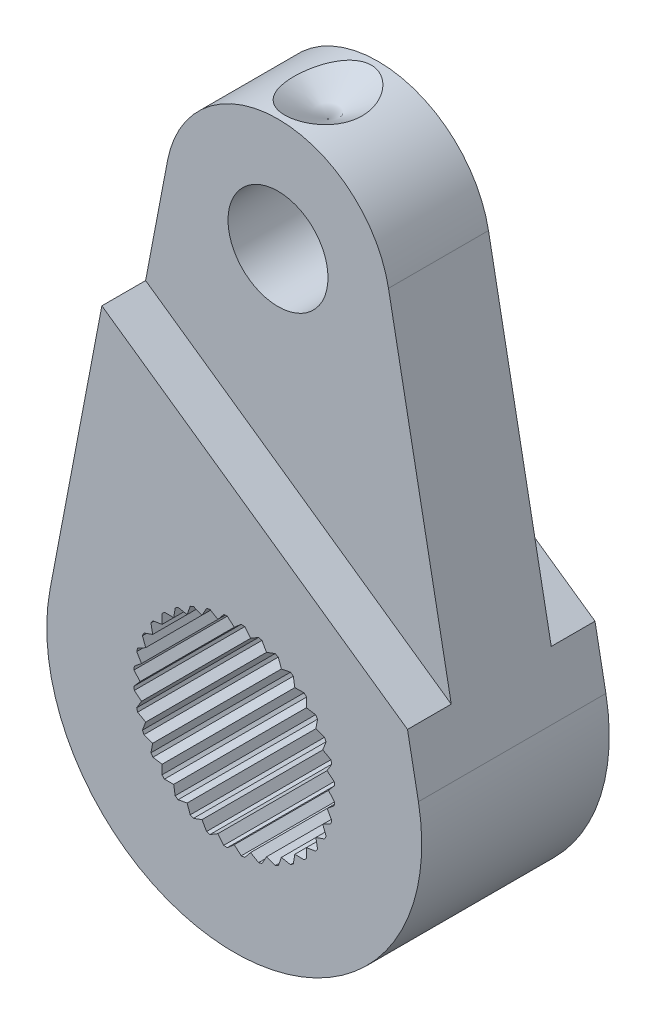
ISO-10303-21;
HEADER;
FILE_DESCRIPTION(('STEP AP214'),'2;1');
FILE_NAME('part.step','',(''),(''),'','','');
FILE_SCHEMA(('AUTOMOTIVE_DESIGN { 1 0 10303 214 1 1 1 1 }'));
ENDSEC;
DATA;
#1=APPLICATION_CONTEXT('core data for automotive mechanical design processes');
#2=APPLICATION_PROTOCOL_DEFINITION('international standard','automotive_design',2000,#1);
#3=PRODUCT_CONTEXT('',#1,'mechanical');
#4=PRODUCT('Part','Part','',(#3));
#5=PRODUCT_RELATED_PRODUCT_CATEGORY('part','',(#4));
#6=PRODUCT_DEFINITION_FORMATION('','',#4);
#7=PRODUCT_DEFINITION_CONTEXT('part definition',#1,'design');
#8=PRODUCT_DEFINITION('design','',#6,#7);
#9=PRODUCT_DEFINITION_SHAPE('','',#8);
#10=(LENGTH_UNIT() NAMED_UNIT(*) SI_UNIT(.MILLI.,.METRE.));
#11=(NAMED_UNIT(*) PLANE_ANGLE_UNIT() SI_UNIT($,.RADIAN.));
#12=(NAMED_UNIT(*) SI_UNIT($,.STERADIAN.) SOLID_ANGLE_UNIT());
#13=UNCERTAINTY_MEASURE_WITH_UNIT(LENGTH_MEASURE(1.E-05),#10,'distance_accuracy_value','');
#14=(GEOMETRIC_REPRESENTATION_CONTEXT(3) GLOBAL_UNCERTAINTY_ASSIGNED_CONTEXT((#13)) GLOBAL_UNIT_ASSIGNED_CONTEXT((#10,
#11,#12)) REPRESENTATION_CONTEXT('',''));
#15=CARTESIAN_POINT('',(0.,0.,0.));
#16=DIRECTION('',(0.,0.,1.));
#17=DIRECTION('',(1.,0.,0.));
#18=AXIS2_PLACEMENT_3D('',#15,#16,#17);
#19=CARTESIAN_POINT('',(0.,32.,7.5));
#20=DIRECTION('',(0.,0.,-1.));
#21=DIRECTION('',(-1.,0.,0.));
#22=AXIS2_PLACEMENT_3D('',#19,#20,#21);
#23=CYLINDRICAL_SURFACE('',#22,9.);
#24=CARTESIAN_POINT('',(0.,32.,-4.));
#25=DIRECTION('',(0.,0.,1.));
#26=DIRECTION('',(1.,0.,0.));
#27=AXIS2_PLACEMENT_3D('',#24,#25,#26);
#28=CIRCLE('',#27,9.);
#29=CARTESIAN_POINT('',(8.84038142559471,33.6875,-4.));
#30=VERTEX_POINT('',#29);
#31=CARTESIAN_POINT('',(-8.84038142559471,33.6875,-4.));
#32=VERTEX_POINT('',#31);
#33=EDGE_CURVE('E3121',#30,#32,#28,.T.);
#34=ORIENTED_EDGE('',*,*,#33,.T.);
#35=DIRECTION('',(0.,0.,-1.));
#36=VECTOR('',#35,1.);
#37=CARTESIAN_POINT('',(-8.84038142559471,33.6875,7.5));
#38=LINE('',#37,#36);
#39=CARTESIAN_POINT('',(-8.84038142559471,33.6875,4.));
#40=VERTEX_POINT('',#39);
#41=EDGE_CURVE('E1563',#40,#32,#38,.T.);
#42=ORIENTED_EDGE('',*,*,#41,.F.);
#43=CARTESIAN_POINT('',(0.,32.,4.));
#44=DIRECTION('',(0.,0.,1.));
#45=DIRECTION('',(1.,0.,0.));
#46=AXIS2_PLACEMENT_3D('',#43,#44,#45);
#47=CIRCLE('',#46,9.);
#48=CARTESIAN_POINT('',(8.84038142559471,33.6875,4.));
#49=VERTEX_POINT('',#48);
#50=EDGE_CURVE('E380',#49,#40,#47,.T.);
#51=ORIENTED_EDGE('',*,*,#50,.F.);
#52=DIRECTION('',(0.,0.,-1.));
#53=VECTOR('',#52,1.);
#54=CARTESIAN_POINT('',(8.84038142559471,33.6875,7.5));
#55=LINE('',#54,#53);
#56=EDGE_CURVE('E2170',#49,#30,#55,.T.);
#57=ORIENTED_EDGE('',*,*,#56,.T.);
#58=EDGE_LOOP('',(#34,#42,#51,#57));
#59=FACE_BOUND('',#58,.T.);
#60=CARTESIAN_POINT('',(-2.30120506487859,40.7008308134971,-1.83927446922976));
#61=CARTESIAN_POINT('',(-2.39911736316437,40.6749390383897,-1.64493031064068));
#62=CARTESIAN_POINT('',(-2.48048121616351,40.6516896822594,-1.44156092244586));
#63=CARTESIAN_POINT('',(-2.60973954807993,40.6135833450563,-1.02332791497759));
#64=CARTESIAN_POINT('',(-2.65753933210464,40.5987501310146,-0.808433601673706));
#65=CARTESIAN_POINT('',(-2.71929876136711,40.5794224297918,-0.371378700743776));
#66=CARTESIAN_POINT('',(-2.73295395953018,40.5750209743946,-0.149170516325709));
#67=CARTESIAN_POINT('',(-2.72534047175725,40.577443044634,0.294463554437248));
#68=CARTESIAN_POINT('',(-2.70408845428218,40.5842612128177,0.515889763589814));
#69=CARTESIAN_POINT('',(-2.62607516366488,40.6084510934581,0.957072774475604));
#70=CARTESIAN_POINT('',(-2.56851126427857,40.6260610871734,1.17667502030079));
#71=CARTESIAN_POINT('',(-2.41750876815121,40.6695916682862,1.60245892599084));
#72=CARTESIAN_POINT('',(-2.3240715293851,40.6955119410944,1.80864109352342));
#73=CARTESIAN_POINT('',(-2.12372815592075,40.7463235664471,2.16095158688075));
#74=CARTESIAN_POINT('',(-2.02322739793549,40.7703886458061,2.3108547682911));
#75=CARTESIAN_POINT('',(-1.79925457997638,40.8190579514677,2.59230874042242));
#76=CARTESIAN_POINT('',(-1.67581761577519,40.843661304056,2.72388703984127));
#77=CARTESIAN_POINT('',(-1.4370683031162,40.8851547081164,2.93506366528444));
#78=CARTESIAN_POINT('',(-1.32628528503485,40.9025269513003,3.01967922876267));
#79=CARTESIAN_POINT('',(-1.09219932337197,40.9342589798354,3.17012781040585));
#80=CARTESIAN_POINT('',(-0.968912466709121,40.9486225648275,3.23598455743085));
#81=CARTESIAN_POINT('',(-0.731234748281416,40.9709162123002,3.33655467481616));
#82=CARTESIAN_POINT('',(-0.618255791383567,40.9794860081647,3.37444645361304));
#83=CARTESIAN_POINT('',(-0.387361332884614,40.992401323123,3.43116895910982));
#84=CARTESIAN_POINT('',(-0.269448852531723,40.9967493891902,3.45001117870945));
#85=CARTESIAN_POINT('',(-0.031737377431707,41.0007306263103,3.46727343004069));
#86=CARTESIAN_POINT('',(0.0880656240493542,41.0003518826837,3.46564185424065));
#87=CARTESIAN_POINT('',(0.325518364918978,40.9948960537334,3.44196022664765));
#88=CARTESIAN_POINT('',(0.443167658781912,40.989818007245,3.41990599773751));
#89=CARTESIAN_POINT('',(0.66900382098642,40.9757904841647,3.35809095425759));
#90=CARTESIAN_POINT('',(0.777377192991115,40.9669808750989,3.31896844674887));
#91=CARTESIAN_POINT('',(0.986960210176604,40.9463413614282,3.22544797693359));
#92=CARTESIAN_POINT('',(1.08816656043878,40.934510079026,3.17104304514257));
#93=CARTESIAN_POINT('',(1.32085837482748,40.903598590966,3.02507066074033));
#94=CARTESIAN_POINT('',(1.44834611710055,40.8835081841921,2.92733260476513));
#95=CARTESIAN_POINT('',(1.68553259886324,40.8415815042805,2.71249754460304));
#96=CARTESIAN_POINT('',(1.79519357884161,40.8197416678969,2.59536048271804));
#97=CARTESIAN_POINT('',(2.02297956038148,40.7706621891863,2.31343087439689));
#98=CARTESIAN_POINT('',(2.13566735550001,40.7435227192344,2.14422955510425));
#99=CARTESIAN_POINT('',(2.33202758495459,40.6932115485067,1.78936031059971));
#100=CARTESIAN_POINT('',(2.41568657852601,40.6700416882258,1.60368480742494));
#101=CARTESIAN_POINT('',(2.55469404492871,40.6301119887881,1.21914404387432));
#102=CARTESIAN_POINT('',(2.60973284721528,40.613422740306,1.02015977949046));
#103=CARTESIAN_POINT('',(2.68982174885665,40.5887492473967,0.615822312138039));
#104=CARTESIAN_POINT('',(2.71488095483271,40.5807623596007,0.410471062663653));
#105=CARTESIAN_POINT('',(2.73569732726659,40.5741554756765,-0.0205302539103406));
#106=CARTESIAN_POINT('',(2.72860244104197,40.576446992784,-0.246337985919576));
#107=CARTESIAN_POINT('',(2.67855481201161,40.592206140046,-0.693735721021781));
#108=CARTESIAN_POINT('',(2.63557120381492,40.6056833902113,-0.915321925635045));
#109=CARTESIAN_POINT('',(2.51373895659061,40.64205863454,-1.34920730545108));
#110=CARTESIAN_POINT('',(2.43465564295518,40.665018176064,-1.56143559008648));
#111=CARTESIAN_POINT('',(2.24077862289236,40.7171656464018,-1.96812765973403));
#112=CARTESIAN_POINT('',(2.12602040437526,40.7463473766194,-2.16260885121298));
#113=CARTESIAN_POINT('',(1.89699937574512,40.7983590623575,-2.47567314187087));
#114=CARTESIAN_POINT('',(1.79113047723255,40.8207518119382,-2.60049343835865));
#115=CARTESIAN_POINT('',(1.5606057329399,40.8644359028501,-2.83160469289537));
#116=CARTESIAN_POINT('',(1.43598159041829,40.8857290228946,-2.93792627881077));
#117=CARTESIAN_POINT('',(1.19623745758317,40.9207919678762,-3.10701284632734));
#118=CARTESIAN_POINT('',(1.08437007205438,40.9352102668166,-3.17423871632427));
#119=CARTESIAN_POINT('',(0.850824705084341,40.960460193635,-3.28979765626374));
#120=CARTESIAN_POINT('',(0.729153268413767,40.9712941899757,-3.33814320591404));
#121=CARTESIAN_POINT('',(0.477811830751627,40.9881945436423,-3.41284850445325));
#122=CARTESIAN_POINT('',(0.34808897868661,40.9942247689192,-3.4390417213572));
#123=CARTESIAN_POINT('',(0.0858966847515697,41.0005427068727,-3.46647477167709));
#124=CARTESIAN_POINT('',(-0.0465710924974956,41.0008338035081,-3.46772930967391));
#125=CARTESIAN_POINT('',(-0.293333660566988,40.9959631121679,-3.44659384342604));
#126=CARTESIAN_POINT('',(-0.407897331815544,40.9914531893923,-3.4270305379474));
#127=CARTESIAN_POINT('',(-0.63218179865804,40.978472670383,-3.3699665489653));
#128=CARTESIAN_POINT('',(-0.741902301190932,40.9700018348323,-3.33246478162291));
#129=CARTESIAN_POINT('',(-0.957703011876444,40.949578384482,-3.24025789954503));
#130=CARTESIAN_POINT('',(-1.06354848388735,40.9375214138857,-3.18503255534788));
#131=CARTESIAN_POINT('',(-1.26629844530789,40.9110587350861,-3.06048750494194));
#132=CARTESIAN_POINT('',(-1.36319316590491,40.8966505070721,-2.9911526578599));
#133=CARTESIAN_POINT('',(-1.59200010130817,40.8591626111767,-2.80439685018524));
#134=CARTESIAN_POINT('',(-1.71807336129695,40.8352692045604,-2.67997329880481));
#135=CARTESIAN_POINT('',(-1.94801480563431,40.7874376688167,-2.41235552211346));
#136=CARTESIAN_POINT('',(-2.0518855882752,40.7634995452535,-2.26916349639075));
#137=CARTESIAN_POINT('',(-2.17278119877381,40.7338336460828,-2.07371048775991));
#138=CARTESIAN_POINT('',(-2.19988615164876,40.727040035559,-2.02761605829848));
#139=CARTESIAN_POINT('',(-2.25206172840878,40.713721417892,-1.93428729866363));
#140=CARTESIAN_POINT('',(-2.27713350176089,40.7071962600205,-1.88705363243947));
#141=CARTESIAN_POINT('',(-2.30120506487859,40.7008308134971,-1.83927446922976));
#142=B_SPLINE_CURVE_WITH_KNOTS('',3,(#60,#61,#62,#63,#64,#65,#66,#67,#68,#69,#70,#71,#72,#73,
#74,#75,#76,#77,#78,#79,#80,#81,#82,#83,#84,#85,#86,#87,#88,#89,#90,#91,#92,#93,#94,#95,#96,#97,
#98,#99,#100,#101,#102,#103,#104,#105,#106,#107,#108,#109,#110,#111,#112,#113,#114,#115,#116,
#117,#118,#119,#120,#121,#122,#123,#124,#125,#126,#127,#128,#129,#130,#131,#132,#133,#134,#135,
#136,#137,#138,#139,#140,#141),.UNSPECIFIED.,.T.,.F.,(4,2,2,2,2,2,2,2,2,2,2,2,2,2,2,2,2,2,2,2,2,
2,2,2,2,2,2,2,2,2,2,2,2,2,2,2,2,2,2,2,4),(0.,0.657251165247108,1.31634927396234,
1.98130354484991,2.64594038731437,3.32580913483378,4.00565214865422,4.54987309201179,
5.09326805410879,5.51316464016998,5.93252769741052,6.28940089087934,6.64605864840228,
7.00361560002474,7.36124570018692,7.70651562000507,8.0519432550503,8.53496998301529,
9.0190068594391,9.63111085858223,10.2434978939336,10.8623798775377,11.4810738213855,
12.1556677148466,12.8308423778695,13.5104700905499,14.1894238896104,14.683281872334,
15.1763142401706,15.5687072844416,15.9608405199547,16.3558960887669,16.7507187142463,
17.0980371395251,17.4453765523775,17.8040217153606,18.1630537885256,18.6964012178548,
19.2296861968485,19.3913622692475,19.552946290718),.UNSPECIFIED.);
#143=CARTESIAN_POINT('',(-2.30120506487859,40.7008308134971,-1.83927446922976));
#144=VERTEX_POINT('',#143);
#145=EDGE_CURVE('E12',#144,#144,#142,.T.);
#146=ORIENTED_EDGE('',*,*,#145,.F.);
#147=EDGE_LOOP('',(#146));
#148=FACE_BOUND('',#147,.T.);
#149=ADVANCED_FACE('F353',(#59,#148),#23,.T.);
#150=CARTESIAN_POINT('',(0.,32.,7.5));
#151=DIRECTION('',(0.,0.,-1.));
#152=DIRECTION('',(-1.,0.,0.));
#153=AXIS2_PLACEMENT_3D('',#150,#151,#152);
#154=CYLINDRICAL_SURFACE('',#153,4.);
#155=CARTESIAN_POINT('',(0.,32.,4.));
#156=DIRECTION('',(0.,0.,1.));
#157=DIRECTION('',(1.,0.,0.));
#158=AXIS2_PLACEMENT_3D('',#155,#156,#157);
#159=CIRCLE('',#158,4.);
#160=CARTESIAN_POINT('',(4.,32.,4.));
#161=VERTEX_POINT('',#160);
#162=EDGE_CURVE('E1896',#161,#161,#159,.T.);
#163=ORIENTED_EDGE('',*,*,#162,.T.);
#164=EDGE_LOOP('',(#163));
#165=FACE_BOUND('',#164,.T.);
#166=CARTESIAN_POINT('',(0.,32.,-4.));
#167=DIRECTION('',(0.,0.,-1.));
#168=DIRECTION('',(-1.,0.,0.));
#169=AXIS2_PLACEMENT_3D('',#166,#167,#168);
#170=CIRCLE('',#169,4.);
#171=CARTESIAN_POINT('',(-4.,32.,-4.));
#172=VERTEX_POINT('',#171);
#173=EDGE_CURVE('E3117',#172,#172,#170,.T.);
#174=ORIENTED_EDGE('',*,*,#173,.T.);
#175=EDGE_LOOP('',(#174));
#176=FACE_BOUND('',#175,.T.);
#177=ADVANCED_FACE('F1079',(#165,#176),#154,.F.);
#178=CARTESIAN_POINT('',(0.,0.,-7.5));
#179=DIRECTION('',(0.,0.,1.));
#180=DIRECTION('',(1.,0.,0.));
#181=AXIS2_PLACEMENT_3D('',#178,#179,#180);
#182=PLANE('',#181);
#183=CARTESIAN_POINT('',(0.,0.,-7.5));
#184=DIRECTION('',(0.,0.,1.));
#185=DIRECTION('',(1.,0.,0.));
#186=AXIS2_PLACEMENT_3D('',#183,#184,#185);
#187=CIRCLE('',#186,8.04);
#188=CARTESIAN_POINT('',(-3.27016261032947,-7.3449054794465,-7.49999999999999));
#189=VERTEX_POINT('',#188);
#190=CARTESIAN_POINT('',(-3.52450402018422,-7.22630413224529,-7.49999999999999));
#191=VERTEX_POINT('',#190);
#192=EDGE_CURVE('E1709',#189,#191,#187,.F.);
#193=ORIENTED_EDGE('',*,*,#192,.F.);
#194=DIRECTION('',(0.935257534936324,0.353967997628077,0.));
#195=VECTOR('',#194,1.);
#196=CARTESIAN_POINT('',(2.02181043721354,-5.34204633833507,-7.5));
#197=LINE('',#196,#195);
#198=CARTESIAN_POINT('',(-2.57797683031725,-7.08293312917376,-7.49999999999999));
#199=VERTEX_POINT('',#198);
#200=EDGE_CURVE('E1911',#189,#199,#197,.T.);
#201=ORIENTED_EDGE('',*,*,#200,.T.);
#202=DIRECTION('',(0.488922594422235,-0.872327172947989,0.));
#203=VECTOR('',#202,1.);
#204=CARTESIAN_POINT('',(-4.98259784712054,-2.79265021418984,-7.5));
#205=LINE('',#204,#203);
#206=CARTESIAN_POINT('',(-2.2161243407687,-7.72854403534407,-7.49999999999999));
#207=VERTEX_POINT('',#206);
#208=EDGE_CURVE('E1914',#199,#207,#205,.T.);
#209=ORIENTED_EDGE('',*,*,#208,.T.);
#210=CARTESIAN_POINT('',(0.,0.,-7.5));
#211=DIRECTION('',(0.,0.,1.));
#212=DIRECTION('',(1.,0.,0.));
#213=AXIS2_PLACEMENT_3D('',#210,#211,#212);
#214=CIRCLE('',#213,8.04);
#215=CARTESIAN_POINT('',(-1.94505204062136,-7.801177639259,-7.49999999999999));
#216=VERTEX_POINT('',#215);
#217=EDGE_CURVE('E1701',#216,#207,#214,.F.);
#218=ORIENTED_EDGE('',*,*,#217,.F.);
#219=DIRECTION('',(0.85958297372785,0.510996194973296,0.));
#220=VECTOR('',#219,1.);
#221=CARTESIAN_POINT('',(2.91873120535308,-4.90980495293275,-7.5));
#222=LINE('',#221,#220);
#223=CARTESIAN_POINT('',(-1.30887313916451,-7.4229884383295,-7.49999999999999));
#224=VERTEX_POINT('',#223);
#225=EDGE_CURVE('E1919',#216,#224,#222,.T.);
#226=ORIENTED_EDGE('',*,*,#225,.T.);
#227=DIRECTION('',(0.632972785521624,-0.774174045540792,0.));
#228=VECTOR('',#227,1.);
#229=CARTESIAN_POINT('',(-4.42196236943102,-3.61544261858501,-7.5));
#230=LINE('',#229,#228);
#231=CARTESIAN_POINT('',(-0.840408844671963,-7.99595603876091,-7.49999999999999));
#232=VERTEX_POINT('',#231);
#233=EDGE_CURVE('E1932',#224,#232,#230,.T.);
#234=ORIENTED_EDGE('',*,*,#233,.T.);
#235=CARTESIAN_POINT('',(0.,0.,-7.5));
#236=DIRECTION('',(0.,0.,1.));
#237=DIRECTION('',(1.,0.,0.));
#238=AXIS2_PLACEMENT_3D('',#235,#236,#237);
#239=CIRCLE('',#238,8.04);
#240=CARTESIAN_POINT('',(-0.560842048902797,-8.02041496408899,-7.49999999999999));
#241=VERTEX_POINT('',#240);
#242=EDGE_CURVE('E1690',#241,#232,#239,.F.);
#243=ORIENTED_EDGE('',*,*,#242,.F.);
#244=DIRECTION('',(0.757790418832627,0.652498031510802,0.));
#245=VECTOR('',#244,1.);
#246=CARTESIAN_POINT('',(3.72696780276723,-4.32838162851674,-7.5));
#247=LINE('',#246,#245);
#248=CARTESIAN_POINT('',(0.,-7.53749999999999,-7.49999999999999));
#249=VERTEX_POINT('',#248);
#250=EDGE_CURVE('E1942',#241,#249,#247,.T.);
#251=ORIENTED_EDGE('',*,*,#250,.T.);
#252=DIRECTION('',(0.757790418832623,-0.652498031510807,0.));
#253=VECTOR('',#252,1.);
#254=CARTESIAN_POINT('',(-3.72696780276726,-4.32838162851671,-7.5));
#255=LINE('',#254,#253);
#256=CARTESIAN_POINT('',(0.560842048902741,-8.02041496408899,-7.49999999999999));
#257=VERTEX_POINT('',#256);
#258=EDGE_CURVE('E1953',#249,#257,#255,.T.);
#259=ORIENTED_EDGE('',*,*,#258,.T.);
#260=CARTESIAN_POINT('',(0.,0.,-7.5));
#261=DIRECTION('',(0.,0.,1.));
#262=DIRECTION('',(1.,0.,0.));
#263=AXIS2_PLACEMENT_3D('',#260,#261,#262);
#264=CIRCLE('',#263,8.04);
#265=CARTESIAN_POINT('',(0.840408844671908,-7.99595603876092,-7.49999999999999));
#266=VERTEX_POINT('',#265);
#267=EDGE_CURVE('E1678',#266,#257,#264,.F.);
#268=ORIENTED_EDGE('',*,*,#267,.F.);
#269=DIRECTION('',(0.632972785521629,0.774174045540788,0.));
#270=VECTOR('',#269,1.);
#271=CARTESIAN_POINT('',(4.42196236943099,-3.61544261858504,-7.5));
#272=LINE('',#271,#270);
#273=CARTESIAN_POINT('',(1.30887313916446,-7.42298843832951,-7.49999999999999));
#274=VERTEX_POINT('',#273);
#275=EDGE_CURVE('E1963',#266,#274,#272,.T.);
#276=ORIENTED_EDGE('',*,*,#275,.T.);
#277=DIRECTION('',(0.859582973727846,-0.510996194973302,0.));
#278=VECTOR('',#277,1.);
#279=CARTESIAN_POINT('',(-2.91873120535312,-4.90980495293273,-7.5));
#280=LINE('',#279,#278);
#281=CARTESIAN_POINT('',(1.94505204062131,-7.80117763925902,-7.49999999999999));
#282=VERTEX_POINT('',#281);
#283=EDGE_CURVE('E1974',#274,#282,#280,.T.);
#284=ORIENTED_EDGE('',*,*,#283,.T.);
#285=CARTESIAN_POINT('',(0.,0.,-7.5));
#286=DIRECTION('',(0.,0.,1.));
#287=DIRECTION('',(1.,0.,0.));
#288=AXIS2_PLACEMENT_3D('',#285,#286,#287);
#289=CIRCLE('',#288,8.04);
#290=CARTESIAN_POINT('',(2.21612434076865,-7.72854403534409,-7.49999999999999));
#291=VERTEX_POINT('',#290);
#292=EDGE_CURVE('E1666',#291,#282,#289,.F.);
#293=ORIENTED_EDGE('',*,*,#292,.F.);
#294=DIRECTION('',(0.488922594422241,0.872327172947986,0.));
#295=VECTOR('',#294,1.);
#296=CARTESIAN_POINT('',(4.98259784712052,-2.79265021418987,-7.5));
#297=LINE('',#296,#295);
#298=CARTESIAN_POINT('',(2.57797683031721,-7.08293312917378,-7.49999999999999));
#299=VERTEX_POINT('',#298);
#300=EDGE_CURVE('E1984',#291,#299,#297,.T.);
#301=ORIENTED_EDGE('',*,*,#300,.T.);
#302=DIRECTION('',(0.935257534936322,-0.353967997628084,0.));
#303=VECTOR('',#302,1.);
#304=CARTESIAN_POINT('',(-2.02181043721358,-5.34204633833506,-7.5));
#305=LINE('',#304,#303);
#306=CARTESIAN_POINT('',(3.27016261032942,-7.34490547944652,-7.49999999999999));
#307=VERTEX_POINT('',#306);
#308=EDGE_CURVE('E1995',#299,#307,#305,.T.);
#309=ORIENTED_EDGE('',*,*,#308,.T.);
#310=CARTESIAN_POINT('',(0.,0.,-7.5));
#311=DIRECTION('',(0.,0.,1.));
#312=DIRECTION('',(1.,0.,0.));
#313=AXIS2_PLACEMENT_3D('',#310,#311,#312);
#314=CIRCLE('',#313,8.04);
#315=CARTESIAN_POINT('',(3.52450402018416,-7.22630413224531,-7.49999999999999));
#316=VERTEX_POINT('',#315);
#317=EDGE_CURVE('E1654',#316,#307,#314,.F.);
#318=ORIENTED_EDGE('',*,*,#317,.F.);
#319=DIRECTION('',(0.330016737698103,0.943975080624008,0.));
#320=VECTOR('',#319,1.);
#321=CARTESIAN_POINT('',(5.39183961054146,-1.88500454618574,-7.5));
#322=LINE('',#321,#320);
#323=CARTESIAN_POINT('',(3.76874999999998,-6.52766648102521,-7.49999999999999));
#324=VERTEX_POINT('',#323);
#325=EDGE_CURVE('E2005',#316,#324,#322,.T.);
#326=ORIENTED_EDGE('',*,*,#325,.T.);
#327=DIRECTION('',(0.982514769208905,-0.186184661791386,0.));
#328=VECTOR('',#327,1.);
#329=CARTESIAN_POINT('',(-1.06345798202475,-5.61197234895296,-7.5));
#330=LINE('',#329,#328);
#331=CARTESIAN_POINT('',(4.49591094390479,-6.66546208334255,-7.49999999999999));
#332=VERTEX_POINT('',#331);
#333=EDGE_CURVE('E2016',#324,#332,#330,.T.);
#334=ORIENTED_EDGE('',*,*,#333,.T.);
#335=CARTESIAN_POINT('',(0.,0.,-7.5));
#336=DIRECTION('',(0.,0.,1.));
#337=DIRECTION('',(1.,0.,0.));
#338=AXIS2_PLACEMENT_3D('',#335,#336,#337);
#339=CIRCLE('',#338,8.04);
#340=CARTESIAN_POINT('',(4.72579342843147,-6.50449663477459,-7.49999999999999));
#341=VERTEX_POINT('',#340);
#342=EDGE_CURVE('E1642',#341,#332,#339,.F.);
#343=ORIENTED_EDGE('',*,*,#342,.F.);
#344=DIRECTION('',(0.161083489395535,0.986940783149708,0.));
#345=VECTOR('',#344,1.);
#346=CARTESIAN_POINT('',(5.63725305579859,-0.920083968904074,-7.5));
#347=LINE('',#346,#345);
#348=CARTESIAN_POINT('',(4.84501160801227,-5.7740599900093,-7.49999999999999));
#349=VERTEX_POINT('',#348);
#350=EDGE_CURVE('E2026',#341,#349,#347,.T.);
#351=ORIENTED_EDGE('',*,*,#350,.T.);
#352=DIRECTION('',(0.999918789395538,-0.012744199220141,0.));
#353=VECTOR('',#352,1.);
#354=CARTESIAN_POINT('',(-0.0727928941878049,-5.71138141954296,-7.5));
#355=LINE('',#354,#353);
#356=CARTESIAN_POINT('',(5.58505329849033,-5.78349199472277,-7.49999999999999));
#357=VERTEX_POINT('',#356);
#358=EDGE_CURVE('E2037',#349,#357,#355,.T.);
#359=ORIENTED_EDGE('',*,*,#358,.T.);
#360=CARTESIAN_POINT('',(0.,0.,-7.5));
#361=DIRECTION('',(0.,0.,1.));
#362=DIRECTION('',(1.,0.,0.));
#363=AXIS2_PLACEMENT_3D('',#360,#361,#362);
#364=CIRCLE('',#363,8.04);
#365=CARTESIAN_POINT('',(5.78349199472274,-5.58505329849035,-7.49999999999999));
#366=VERTEX_POINT('',#365);
#367=EDGE_CURVE('E1630',#366,#357,#364,.F.);
#368=ORIENTED_EDGE('',*,*,#367,.F.);
#369=DIRECTION('',(-0.0127441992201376,0.999918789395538,0.));
#370=VECTOR('',#369,1.);
#371=CARTESIAN_POINT('',(5.71138141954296,0.0727928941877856,-7.5));
#372=LINE('',#371,#370);
#373=CARTESIAN_POINT('',(5.77405999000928,-4.84501160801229,-7.49999999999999));
#374=VERTEX_POINT('',#373);
#375=EDGE_CURVE('E2047',#366,#374,#372,.T.);
#376=ORIENTED_EDGE('',*,*,#375,.T.);
#377=DIRECTION('',(0.986940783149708,0.161083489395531,0.));
#378=VECTOR('',#377,1.);
#379=CARTESIAN_POINT('',(0.920083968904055,-5.63725305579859,-7.5));
#380=LINE('',#379,#378);
#381=CARTESIAN_POINT('',(6.50449663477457,-4.72579342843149,-7.49999999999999));
#382=VERTEX_POINT('',#381);
#383=EDGE_CURVE('E2058',#374,#382,#380,.T.);
#384=ORIENTED_EDGE('',*,*,#383,.T.);
#385=CARTESIAN_POINT('',(0.,0.,-7.5));
#386=DIRECTION('',(0.,0.,1.));
#387=DIRECTION('',(1.,0.,0.));
#388=AXIS2_PLACEMENT_3D('',#385,#386,#387);
#389=CIRCLE('',#388,8.04);
#390=CARTESIAN_POINT('',(6.66546208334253,-4.49591094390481,-7.49999999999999));
#391=VERTEX_POINT('',#390);
#392=EDGE_CURVE('E1618',#391,#382,#389,.F.);
#393=ORIENTED_EDGE('',*,*,#392,.F.);
#394=DIRECTION('',(-0.186184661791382,0.982514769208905,0.));
#395=VECTOR('',#394,1.);
#396=CARTESIAN_POINT('',(5.61197234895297,1.06345798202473,-7.5));
#397=LINE('',#396,#395);
#398=CARTESIAN_POINT('',(6.52766648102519,-3.76875,-7.49999999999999));
#399=VERTEX_POINT('',#398);
#400=EDGE_CURVE('E2068',#391,#399,#397,.T.);
#401=ORIENTED_EDGE('',*,*,#400,.T.);
#402=DIRECTION('',(0.943975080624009,0.330016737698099,0.));
#403=VECTOR('',#402,1.);
#404=CARTESIAN_POINT('',(1.88500454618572,-5.39183961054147,-7.5));
#405=LINE('',#404,#403);
#406=CARTESIAN_POINT('',(7.2263041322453,-3.52450402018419,-7.49999999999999));
#407=VERTEX_POINT('',#406);
#408=EDGE_CURVE('E2079',#399,#407,#405,.T.);
#409=ORIENTED_EDGE('',*,*,#408,.T.);
#410=CARTESIAN_POINT('',(0.,0.,-7.5));
#411=DIRECTION('',(0.,0.,1.));
#412=DIRECTION('',(1.,0.,0.));
#413=AXIS2_PLACEMENT_3D('',#410,#411,#412);
#414=CIRCLE('',#413,8.04);
#415=CARTESIAN_POINT('',(7.34490547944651,-3.27016261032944,-7.49999999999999));
#416=VERTEX_POINT('',#415);
#417=EDGE_CURVE('E1606',#416,#407,#414,.F.);
#418=ORIENTED_EDGE('',*,*,#417,.F.);
#419=DIRECTION('',(-0.353967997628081,0.935257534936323,0.));
#420=VECTOR('',#419,1.);
#421=CARTESIAN_POINT('',(5.34204633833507,2.02181043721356,-7.5));
#422=LINE('',#421,#420);
#423=CARTESIAN_POINT('',(7.08293312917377,-2.57797683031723,-7.49999999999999));
#424=VERTEX_POINT('',#423);
#425=EDGE_CURVE('E2089',#416,#424,#422,.T.);
#426=ORIENTED_EDGE('',*,*,#425,.T.);
#427=DIRECTION('',(0.872327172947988,0.488922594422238,0.));
#428=VECTOR('',#427,1.);
#429=CARTESIAN_POINT('',(2.79265021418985,-4.98259784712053,-7.5));
#430=LINE('',#429,#428);
#431=CARTESIAN_POINT('',(7.72854403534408,-2.21612434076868,-7.49999999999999));
#432=VERTEX_POINT('',#431);
#433=EDGE_CURVE('E2100',#424,#432,#430,.T.);
#434=ORIENTED_EDGE('',*,*,#433,.T.);
#435=CARTESIAN_POINT('',(0.,0.,-7.5));
#436=DIRECTION('',(0.,0.,1.));
#437=DIRECTION('',(1.,0.,0.));
#438=AXIS2_PLACEMENT_3D('',#435,#436,#437);
#439=CIRCLE('',#438,8.04);
#440=CARTESIAN_POINT('',(7.80117763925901,-1.94505204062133,-7.49999999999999));
#441=VERTEX_POINT('',#440);
#442=EDGE_CURVE('E1594',#441,#432,#439,.F.);
#443=ORIENTED_EDGE('',*,*,#442,.F.);
#444=DIRECTION('',(-0.510996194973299,0.859582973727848,0.));
#445=VECTOR('',#444,1.);
#446=CARTESIAN_POINT('',(4.90980495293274,2.9187312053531,-7.5));
#447=LINE('',#446,#445);
#448=CARTESIAN_POINT('',(7.42298843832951,-1.30887313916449,-7.49999999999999));
#449=VERTEX_POINT('',#448);
#450=EDGE_CURVE('E2110',#441,#449,#447,.T.);
#451=ORIENTED_EDGE('',*,*,#450,.T.);
#452=DIRECTION('',(0.77417404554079,0.632972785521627,0.));
#453=VECTOR('',#452,1.);
#454=CARTESIAN_POINT('',(3.61544261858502,-4.421962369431,-7.5));
#455=LINE('',#454,#453);
#456=CARTESIAN_POINT('',(7.99595603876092,-0.840408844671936,-7.49999999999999));
#457=VERTEX_POINT('',#456);
#458=EDGE_CURVE('E2121',#449,#457,#455,.T.);
#459=ORIENTED_EDGE('',*,*,#458,.T.);
#460=CARTESIAN_POINT('',(0.,0.,-7.5));
#461=DIRECTION('',(0.,0.,1.));
#462=DIRECTION('',(1.,0.,0.));
#463=AXIS2_PLACEMENT_3D('',#460,#461,#462);
#464=CIRCLE('',#463,8.04);
#465=CARTESIAN_POINT('',(8.02041496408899,-0.560842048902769,-7.49999999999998));
#466=VERTEX_POINT('',#465);
#467=EDGE_CURVE('E1582',#466,#457,#464,.F.);
#468=ORIENTED_EDGE('',*,*,#467,.F.);
#469=DIRECTION('',(-0.652498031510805,0.757790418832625,0.));
#470=VECTOR('',#469,1.);
#471=CARTESIAN_POINT('',(4.32838162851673,3.72696780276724,-7.5));
#472=LINE('',#471,#470);
#473=CARTESIAN_POINT('',(7.53749999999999,0.,-7.49999999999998));
#474=VERTEX_POINT('',#473);
#475=EDGE_CURVE('E2131',#466,#474,#472,.T.);
#476=ORIENTED_EDGE('',*,*,#475,.T.);
#477=DIRECTION('',(0.652498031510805,0.757790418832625,0.));
#478=VECTOR('',#477,1.);
#479=CARTESIAN_POINT('',(4.32838162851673,-3.72696780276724,-7.5));
#480=LINE('',#479,#478);
#481=CARTESIAN_POINT('',(8.02041496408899,0.560842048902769,-7.49999999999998));
#482=VERTEX_POINT('',#481);
#483=EDGE_CURVE('E2142',#474,#482,#480,.T.);
#484=ORIENTED_EDGE('',*,*,#483,.T.);
#485=CARTESIAN_POINT('',(0.,0.,-7.5));
#486=DIRECTION('',(0.,0.,1.));
#487=DIRECTION('',(1.,0.,0.));
#488=AXIS2_PLACEMENT_3D('',#485,#486,#487);
#489=CIRCLE('',#488,8.04);
#490=CARTESIAN_POINT('',(7.99595603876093,0.840408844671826,-7.49999999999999));
#491=VERTEX_POINT('',#490);
#492=EDGE_CURVE('E1890',#491,#482,#489,.F.);
#493=ORIENTED_EDGE('',*,*,#492,.F.);
#494=DIRECTION('',(-0.774174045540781,0.632972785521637,0.));
#495=VECTOR('',#494,1.);
#496=CARTESIAN_POINT('',(3.61544261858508,4.42196236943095,-7.5));
#497=LINE('',#496,#495);
#498=CARTESIAN_POINT('',(7.42298843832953,1.30887313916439,-7.5));
#499=VERTEX_POINT('',#498);
#500=EDGE_CURVE('E2152',#491,#499,#497,.T.);
#501=ORIENTED_EDGE('',*,*,#500,.T.);
#502=DIRECTION('',(0.510996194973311,0.859582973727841,0.));
#503=VECTOR('',#502,1.);
#504=CARTESIAN_POINT('',(4.9098049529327,-2.91873120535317,-7.5));
#505=LINE('',#504,#503);
#506=CARTESIAN_POINT('',(7.80117763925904,1.94505204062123,-7.49999999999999));
#507=VERTEX_POINT('',#506);
#508=EDGE_CURVE('E2158',#499,#507,#505,.T.);
#509=ORIENTED_EDGE('',*,*,#508,.T.);
#510=CARTESIAN_POINT('',(0.,0.,-7.5));
#511=DIRECTION('',(0.,0.,1.));
#512=DIRECTION('',(1.,0.,0.));
#513=AXIS2_PLACEMENT_3D('',#510,#511,#512);
#514=CIRCLE('',#513,8.04);
#515=CARTESIAN_POINT('',(7.72854403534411,2.21612434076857,-7.49999999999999));
#516=VERTEX_POINT('',#515);
#517=EDGE_CURVE('E365',#516,#507,#514,.F.);
#518=ORIENTED_EDGE('',*,*,#517,.F.);
#519=DIRECTION('',(-0.872327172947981,0.488922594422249,0.));
#520=VECTOR('',#519,1.);
#521=CARTESIAN_POINT('',(2.79265021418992,4.98259784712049,-7.5));
#522=LINE('',#521,#520);
#523=CARTESIAN_POINT('',(7.08293312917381,2.57797683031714,-7.49999999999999));
#524=VERTEX_POINT('',#523);
#525=EDGE_CURVE('E2155',#516,#524,#522,.T.);
#526=ORIENTED_EDGE('',*,*,#525,.T.);
#527=DIRECTION('',(0.353967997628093,0.935257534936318,0.));
#528=VECTOR('',#527,1.);
#529=CARTESIAN_POINT('',(5.34204633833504,-2.02181043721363,-7.5));
#530=LINE('',#529,#528);
#531=CARTESIAN_POINT('',(7.34490547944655,3.27016261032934,-7.49999999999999));
#532=VERTEX_POINT('',#531);
#533=EDGE_CURVE('E2148',#524,#532,#530,.T.);
#534=ORIENTED_EDGE('',*,*,#533,.T.);
#535=CARTESIAN_POINT('',(0.,0.,-7.5));
#536=DIRECTION('',(0.,0.,1.));
#537=DIRECTION('',(1.,0.,0.));
#538=AXIS2_PLACEMENT_3D('',#535,#536,#537);
#539=CIRCLE('',#538,8.04);
#540=CARTESIAN_POINT('',(7.22630413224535,3.52450402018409,-7.49999999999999));
#541=VERTEX_POINT('',#540);
#542=EDGE_CURVE('E1570',#541,#532,#539,.F.);
#543=ORIENTED_EDGE('',*,*,#542,.F.);
#544=DIRECTION('',(-0.943975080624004,0.330016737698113,0.));
#545=VECTOR('',#544,1.);
#546=CARTESIAN_POINT('',(1.88500454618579,5.39183961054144,-7.5));
#547=LINE('',#546,#545);
#548=CARTESIAN_POINT('',(6.52766648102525,3.76874999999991,-7.49999999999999));
#549=VERTEX_POINT('',#548);
#550=EDGE_CURVE('E2145',#541,#549,#547,.T.);
#551=ORIENTED_EDGE('',*,*,#550,.T.);
#552=DIRECTION('',(0.186184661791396,0.982514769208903,0.));
#553=VECTOR('',#552,1.);
#554=CARTESIAN_POINT('',(5.61197234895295,-1.06345798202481,-7.5));
#555=LINE('',#554,#553);
#556=CARTESIAN_POINT('',(6.66546208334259,4.49591094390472,-7.49999999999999));
#557=VERTEX_POINT('',#556);
#558=EDGE_CURVE('E2137',#549,#557,#555,.T.);
#559=ORIENTED_EDGE('',*,*,#558,.T.);
#560=CARTESIAN_POINT('',(0.,0.,-7.5));
#561=DIRECTION('',(0.,0.,1.));
#562=DIRECTION('',(1.,0.,0.));
#563=AXIS2_PLACEMENT_3D('',#560,#561,#562);
#564=CIRCLE('',#563,8.04);
#565=CARTESIAN_POINT('',(6.50449663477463,4.7257934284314,-7.49999999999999));
#566=VERTEX_POINT('',#565);
#567=EDGE_CURVE('E1875',#566,#557,#564,.F.);
#568=ORIENTED_EDGE('',*,*,#567,.F.);
#569=DIRECTION('',(-0.986940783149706,0.161083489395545,0.));
#570=VECTOR('',#569,1.);
#571=CARTESIAN_POINT('',(0.920083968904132,5.63725305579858,-7.5));
#572=LINE('',#571,#570);
#573=CARTESIAN_POINT('',(5.77405999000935,4.84501160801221,-7.49999999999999));
#574=VERTEX_POINT('',#573);
#575=EDGE_CURVE('E2134',#566,#574,#572,.T.);
#576=ORIENTED_EDGE('',*,*,#575,.T.);
#577=DIRECTION('',(0.0127441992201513,0.999918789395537,0.));
#578=VECTOR('',#577,1.);
#579=CARTESIAN_POINT('',(5.71138141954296,-0.0727928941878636,-7.5));
#580=LINE('',#579,#578);
#581=CARTESIAN_POINT('',(5.78349199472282,5.58505329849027,-7.49999999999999));
#582=VERTEX_POINT('',#581);
#583=EDGE_CURVE('E2127',#574,#582,#580,.T.);
#584=ORIENTED_EDGE('',*,*,#583,.T.);
#585=CARTESIAN_POINT('',(0.,0.,-7.5));
#586=DIRECTION('',(0.,0.,1.));
#587=DIRECTION('',(1.,0.,0.));
#588=AXIS2_PLACEMENT_3D('',#585,#586,#587);
#589=CIRCLE('',#588,8.04);
#590=CARTESIAN_POINT('',(5.58505329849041,5.78349199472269,-7.49999999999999));
#591=VERTEX_POINT('',#590);
#592=EDGE_CURVE('E1867',#591,#582,#589,.F.);
#593=ORIENTED_EDGE('',*,*,#592,.F.);
#594=DIRECTION('',(-0.999918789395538,-0.0127441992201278,0.));
#595=VECTOR('',#594,1.);
#596=CARTESIAN_POINT('',(-0.0727928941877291,5.71138141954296,-7.5));
#597=LINE('',#596,#595);
#598=CARTESIAN_POINT('',(4.84501160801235,5.77405999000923,-7.49999999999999));
#599=VERTEX_POINT('',#598);
#600=EDGE_CURVE('E2124',#591,#599,#597,.T.);
#601=ORIENTED_EDGE('',*,*,#600,.T.);
#602=DIRECTION('',(-0.161083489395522,0.98694078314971,0.));
#603=VECTOR('',#602,1.);
#604=CARTESIAN_POINT('',(5.6372530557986,0.920083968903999,-7.5));
#605=LINE('',#604,#603);
#606=CARTESIAN_POINT('',(4.72579342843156,6.50449663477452,-7.49999999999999));
#607=VERTEX_POINT('',#606);
#608=EDGE_CURVE('E2116',#599,#607,#605,.T.);
#609=ORIENTED_EDGE('',*,*,#608,.T.);
#610=CARTESIAN_POINT('',(0.,0.,-7.5));
#611=DIRECTION('',(0.,0.,1.));
#612=DIRECTION('',(1.,0.,0.));
#613=AXIS2_PLACEMENT_3D('',#610,#611,#612);
#614=CIRCLE('',#613,8.04);
#615=CARTESIAN_POINT('',(4.49591094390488,6.66546208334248,-7.49999999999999));
#616=VERTEX_POINT('',#615);
#617=EDGE_CURVE('E1859',#616,#607,#614,.F.);
#618=ORIENTED_EDGE('',*,*,#617,.F.);
#619=DIRECTION('',(-0.982514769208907,-0.186184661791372,0.));
#620=VECTOR('',#619,1.);
#621=CARTESIAN_POINT('',(-1.06345798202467,5.61197234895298,-7.5));
#622=LINE('',#621,#620);
#623=CARTESIAN_POINT('',(3.76875000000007,6.52766648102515,-7.49999999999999));
#624=VERTEX_POINT('',#623);
#625=EDGE_CURVE('E2113',#616,#624,#622,.T.);
#626=ORIENTED_EDGE('',*,*,#625,.T.);
#627=DIRECTION('',(-0.33001673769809,0.943975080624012,0.));
#628=VECTOR('',#627,1.);
#629=CARTESIAN_POINT('',(5.39183961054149,1.88500454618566,-7.5));
#630=LINE('',#629,#628);
#631=CARTESIAN_POINT('',(3.52450402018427,7.22630413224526,-7.49999999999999));
#632=VERTEX_POINT('',#631);
#633=EDGE_CURVE('E2106',#624,#632,#630,.T.);
#634=ORIENTED_EDGE('',*,*,#633,.T.);
#635=CARTESIAN_POINT('',(0.,0.,-7.5));
#636=DIRECTION('',(0.,0.,1.));
#637=DIRECTION('',(1.,0.,0.));
#638=AXIS2_PLACEMENT_3D('',#635,#636,#637);
#639=CIRCLE('',#638,8.04);
#640=CARTESIAN_POINT('',(3.27016261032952,7.34490547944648,-7.49999999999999));
#641=VERTEX_POINT('',#640);
#642=EDGE_CURVE('E1851',#641,#632,#639,.F.);
#643=ORIENTED_EDGE('',*,*,#642,.F.);
#644=DIRECTION('',(-0.935257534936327,-0.353967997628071,0.));
#645=VECTOR('',#644,1.);
#646=CARTESIAN_POINT('',(-2.02181043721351,5.34204633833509,-7.5));
#647=LINE('',#646,#645);
#648=CARTESIAN_POINT('',(2.5779768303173,7.08293312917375,-7.49999999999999));
#649=VERTEX_POINT('',#648);
#650=EDGE_CURVE('E2103',#641,#649,#647,.T.);
#651=ORIENTED_EDGE('',*,*,#650,.T.);
#652=DIRECTION('',(-0.488922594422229,0.872327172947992,0.));
#653=VECTOR('',#652,1.);
#654=CARTESIAN_POINT('',(4.98259784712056,2.7926502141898,-7.5));
#655=LINE('',#654,#653);
#656=CARTESIAN_POINT('',(2.21612434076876,7.72854403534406,-7.49999999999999));
#657=VERTEX_POINT('',#656);
#658=EDGE_CURVE('E2095',#649,#657,#655,.T.);
#659=ORIENTED_EDGE('',*,*,#658,.T.);
#660=CARTESIAN_POINT('',(0.,0.,-7.5));
#661=DIRECTION('',(0.,0.,1.));
#662=DIRECTION('',(1.,0.,0.));
#663=AXIS2_PLACEMENT_3D('',#660,#661,#662);
#664=CIRCLE('',#663,8.04);
#665=CARTESIAN_POINT('',(1.94505204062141,7.80117763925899,-7.49999999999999));
#666=VERTEX_POINT('',#665);
#667=EDGE_CURVE('E1843',#666,#657,#664,.F.);
#668=ORIENTED_EDGE('',*,*,#667,.F.);
#669=DIRECTION('',(-0.859582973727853,-0.51099619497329,0.));
#670=VECTOR('',#669,1.);
#671=CARTESIAN_POINT('',(-2.91873120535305,4.90980495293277,-7.5));
#672=LINE('',#671,#670);
#673=CARTESIAN_POINT('',(1.30887313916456,7.4229884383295,-7.49999999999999));
#674=VERTEX_POINT('',#673);
#675=EDGE_CURVE('E2092',#666,#674,#672,.T.);
#676=ORIENTED_EDGE('',*,*,#675,.T.);
#677=DIRECTION('',(-0.632972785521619,0.774174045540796,0.));
#678=VECTOR('',#677,1.);
#679=CARTESIAN_POINT('',(4.42196236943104,3.61544261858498,-7.5));
#680=LINE('',#679,#678);
#681=CARTESIAN_POINT('',(0.840408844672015,7.99595603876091,-7.49999999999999));
#682=VERTEX_POINT('',#681);
#683=EDGE_CURVE('E2085',#674,#682,#680,.T.);
#684=ORIENTED_EDGE('',*,*,#683,.T.);
#685=CARTESIAN_POINT('',(0.,0.,-7.5));
#686=DIRECTION('',(0.,0.,1.));
#687=DIRECTION('',(1.,0.,0.));
#688=AXIS2_PLACEMENT_3D('',#685,#686,#687);
#689=CIRCLE('',#688,8.04);
#690=CARTESIAN_POINT('',(0.560842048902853,8.02041496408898,-7.49999999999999));
#691=VERTEX_POINT('',#690);
#692=EDGE_CURVE('E1835',#691,#682,#689,.F.);
#693=ORIENTED_EDGE('',*,*,#692,.F.);
#694=DIRECTION('',(-0.757790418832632,-0.652498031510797,0.));
#695=VECTOR('',#694,1.);
#696=CARTESIAN_POINT('',(-3.7269678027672,4.32838162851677,-7.5));
#697=LINE('',#696,#695);
#698=CARTESIAN_POINT('',(0.,7.53749999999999,-7.49999999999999));
#699=VERTEX_POINT('',#698);
#700=EDGE_CURVE('E2082',#691,#699,#697,.T.);
#701=ORIENTED_EDGE('',*,*,#700,.T.);
#702=DIRECTION('',(-0.757790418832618,0.652498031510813,0.));
#703=VECTOR('',#702,1.);
#704=CARTESIAN_POINT('',(3.72696780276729,4.32838162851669,-7.5));
#705=LINE('',#704,#703);
#706=CARTESIAN_POINT('',(-0.560842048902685,8.02041496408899,-7.49999999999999));
#707=VERTEX_POINT('',#706);
#708=EDGE_CURVE('E2074',#699,#707,#705,.T.);
#709=ORIENTED_EDGE('',*,*,#708,.T.);
#710=CARTESIAN_POINT('',(0.,0.,-7.5));
#711=DIRECTION('',(0.,0.,1.));
#712=DIRECTION('',(1.,0.,0.));
#713=AXIS2_PLACEMENT_3D('',#710,#711,#712);
#714=CIRCLE('',#713,8.04);
#715=CARTESIAN_POINT('',(-0.840408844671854,7.99595603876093,-7.49999999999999));
#716=VERTEX_POINT('',#715);
#717=EDGE_CURVE('E1827',#716,#707,#714,.F.);
#718=ORIENTED_EDGE('',*,*,#717,.F.);
#719=DIRECTION('',(-0.632972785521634,-0.774174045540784,0.));
#720=VECTOR('',#719,1.);
#721=CARTESIAN_POINT('',(-4.42196236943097,3.61544261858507,-7.5));
#722=LINE('',#721,#720);
#723=CARTESIAN_POINT('',(-1.30887313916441,7.42298843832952,-7.49999999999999));
#724=VERTEX_POINT('',#723);
#725=EDGE_CURVE('E2071',#716,#724,#722,.T.);
#726=ORIENTED_EDGE('',*,*,#725,.T.);
#727=DIRECTION('',(-0.859582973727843,0.510996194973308,0.));
#728=VECTOR('',#727,1.);
#729=CARTESIAN_POINT('',(2.91873120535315,4.90980495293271,-7.5));
#730=LINE('',#729,#728);
#731=CARTESIAN_POINT('',(-1.94505204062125,7.80117763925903,-7.49999999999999));
#732=VERTEX_POINT('',#731);
#733=EDGE_CURVE('E2064',#724,#732,#730,.T.);
#734=ORIENTED_EDGE('',*,*,#733,.T.);
#735=CARTESIAN_POINT('',(0.,0.,-7.5));
#736=DIRECTION('',(0.,0.,1.));
#737=DIRECTION('',(1.,0.,0.));
#738=AXIS2_PLACEMENT_3D('',#735,#736,#737);
#739=CIRCLE('',#738,8.04);
#740=CARTESIAN_POINT('',(-2.2161243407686,7.7285440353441,-7.49999999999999));
#741=VERTEX_POINT('',#740);
#742=EDGE_CURVE('E1819',#741,#732,#739,.F.);
#743=ORIENTED_EDGE('',*,*,#742,.F.);
#744=DIRECTION('',(-0.488922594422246,-0.872327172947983,0.));
#745=VECTOR('',#744,1.);
#746=CARTESIAN_POINT('',(-4.9825978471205,2.7926502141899,-7.5));
#747=LINE('',#746,#745);
#748=CARTESIAN_POINT('',(-2.57797683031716,7.0829331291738,-7.49999999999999));
#749=VERTEX_POINT('',#748);
#750=EDGE_CURVE('E2061',#741,#749,#747,.T.);
#751=ORIENTED_EDGE('',*,*,#750,.T.);
#752=DIRECTION('',(-0.935257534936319,0.35396799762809,0.));
#753=VECTOR('',#752,1.);
#754=CARTESIAN_POINT('',(2.02181043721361,5.34204633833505,-7.5));
#755=LINE('',#754,#753);
#756=CARTESIAN_POINT('',(-3.27016261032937,7.34490547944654,-7.49999999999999));
#757=VERTEX_POINT('',#756);
#758=EDGE_CURVE('E2053',#749,#757,#755,.T.);
#759=ORIENTED_EDGE('',*,*,#758,.T.);
#760=CARTESIAN_POINT('',(0.,0.,-7.5));
#761=DIRECTION('',(0.,0.,1.));
#762=DIRECTION('',(1.,0.,0.));
#763=AXIS2_PLACEMENT_3D('',#760,#761,#762);
#764=CIRCLE('',#763,8.04);
#765=CARTESIAN_POINT('',(-3.52450402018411,7.22630413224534,-7.49999999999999));
#766=VERTEX_POINT('',#765);
#767=EDGE_CURVE('E1811',#766,#757,#764,.F.);
#768=ORIENTED_EDGE('',*,*,#767,.F.);
#769=DIRECTION('',(-0.330016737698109,-0.943975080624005,0.));
#770=VECTOR('',#769,1.);
#771=CARTESIAN_POINT('',(-5.39183961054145,1.88500454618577,-7.5));
#772=LINE('',#771,#770);
#773=CARTESIAN_POINT('',(-3.76874999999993,6.52766648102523,-7.49999999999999));
#774=VERTEX_POINT('',#773);
#775=EDGE_CURVE('E2050',#766,#774,#772,.T.);
#776=ORIENTED_EDGE('',*,*,#775,.T.);
#777=DIRECTION('',(-0.982514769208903,0.186184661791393,0.));
#778=VECTOR('',#777,1.);
#779=CARTESIAN_POINT('',(1.06345798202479,5.61197234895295,-7.5));
#780=LINE('',#779,#778);
#781=CARTESIAN_POINT('',(-4.49591094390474,6.66546208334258,-7.49999999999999));
#782=VERTEX_POINT('',#781);
#783=EDGE_CURVE('E2043',#774,#782,#780,.T.);
#784=ORIENTED_EDGE('',*,*,#783,.T.);
#785=CARTESIAN_POINT('',(0.,0.,-7.5));
#786=DIRECTION('',(0.,0.,1.));
#787=DIRECTION('',(1.,0.,0.));
#788=AXIS2_PLACEMENT_3D('',#785,#786,#787);
#789=CIRCLE('',#788,8.04);
#790=CARTESIAN_POINT('',(-4.72579342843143,6.50449663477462,-7.49999999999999));
#791=VERTEX_POINT('',#790);
#792=EDGE_CURVE('E1803',#791,#782,#789,.F.);
#793=ORIENTED_EDGE('',*,*,#792,.F.);
#794=DIRECTION('',(-0.161083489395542,-0.986940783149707,0.));
#795=VECTOR('',#794,1.);
#796=CARTESIAN_POINT('',(-5.63725305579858,0.920083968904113,-7.5));
#797=LINE('',#796,#795);
#798=CARTESIAN_POINT('',(-4.84501160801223,5.77405999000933,-7.49999999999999));
#799=VERTEX_POINT('',#798);
#800=EDGE_CURVE('E2040',#791,#799,#797,.T.);
#801=ORIENTED_EDGE('',*,*,#800,.T.);
#802=DIRECTION('',(-0.999918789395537,0.0127441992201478,0.));
#803=VECTOR('',#802,1.);
#804=CARTESIAN_POINT('',(0.0727928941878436,5.71138141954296,-7.5));
#805=LINE('',#804,#803);
#806=CARTESIAN_POINT('',(-5.58505329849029,5.7834919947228,-7.49999999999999));
#807=VERTEX_POINT('',#806);
#808=EDGE_CURVE('E2032',#799,#807,#805,.T.);
#809=ORIENTED_EDGE('',*,*,#808,.T.);
#810=CARTESIAN_POINT('',(0.,0.,-7.5));
#811=DIRECTION('',(0.,0.,1.));
#812=DIRECTION('',(1.,0.,0.));
#813=AXIS2_PLACEMENT_3D('',#810,#811,#812);
#814=CIRCLE('',#813,8.04);
#815=CARTESIAN_POINT('',(-5.78349199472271,5.58505329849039,-7.49999999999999));
#816=VERTEX_POINT('',#815);
#817=EDGE_CURVE('E1795',#816,#807,#814,.F.);
#818=ORIENTED_EDGE('',*,*,#817,.F.);
#819=DIRECTION('',(0.0127441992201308,-0.999918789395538,0.));
#820=VECTOR('',#819,1.);
#821=CARTESIAN_POINT('',(-5.71138141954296,-0.0727928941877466,-7.5));
#822=LINE('',#821,#820);
#823=CARTESIAN_POINT('',(-5.77405999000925,4.84501160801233,-7.49999999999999));
#824=VERTEX_POINT('',#823);
#825=EDGE_CURVE('E2029',#816,#824,#822,.T.);
#826=ORIENTED_EDGE('',*,*,#825,.T.);
#827=DIRECTION('',(-0.98694078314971,-0.161083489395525,0.));
#828=VECTOR('',#827,1.);
#829=CARTESIAN_POINT('',(-0.920083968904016,5.6372530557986,-7.5));
#830=LINE('',#829,#828);
#831=CARTESIAN_POINT('',(-6.50449663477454,4.72579342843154,-7.49999999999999));
#832=VERTEX_POINT('',#831);
#833=EDGE_CURVE('E2022',#824,#832,#830,.T.);
#834=ORIENTED_EDGE('',*,*,#833,.T.);
#835=CARTESIAN_POINT('',(0.,0.,-7.5));
#836=DIRECTION('',(0.,0.,1.));
#837=DIRECTION('',(1.,0.,0.));
#838=AXIS2_PLACEMENT_3D('',#835,#836,#837);
#839=CIRCLE('',#838,8.04);
#840=CARTESIAN_POINT('',(-6.6654620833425,4.49591094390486,-7.49999999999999));
#841=VERTEX_POINT('',#840);
#842=EDGE_CURVE('E1787',#841,#832,#839,.F.);
#843=ORIENTED_EDGE('',*,*,#842,.F.);
#844=DIRECTION('',(0.186184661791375,-0.982514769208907,0.));
#845=VECTOR('',#844,1.);
#846=CARTESIAN_POINT('',(-5.61197234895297,-1.06345798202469,-7.5));
#847=LINE('',#846,#845);
#848=CARTESIAN_POINT('',(-6.52766648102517,3.76875000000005,-7.49999999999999));
#849=VERTEX_POINT('',#848);
#850=EDGE_CURVE('E2019',#841,#849,#847,.T.);
#851=ORIENTED_EDGE('',*,*,#850,.T.);
#852=DIRECTION('',(-0.943975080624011,-0.330016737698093,0.));
#853=VECTOR('',#852,1.);
#854=CARTESIAN_POINT('',(-1.88500454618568,5.39183961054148,-7.5));
#855=LINE('',#854,#853);
#856=CARTESIAN_POINT('',(-7.22630413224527,3.52450402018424,-7.49999999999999));
#857=VERTEX_POINT('',#856);
#858=EDGE_CURVE('E2011',#849,#857,#855,.T.);
#859=ORIENTED_EDGE('',*,*,#858,.T.);
#860=CARTESIAN_POINT('',(0.,0.,-7.5));
#861=DIRECTION('',(0.,0.,1.));
#862=DIRECTION('',(1.,0.,0.));
#863=AXIS2_PLACEMENT_3D('',#860,#861,#862);
#864=CIRCLE('',#863,8.04);
#865=CARTESIAN_POINT('',(-7.34490547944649,3.27016261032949,-7.49999999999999));
#866=VERTEX_POINT('',#865);
#867=EDGE_CURVE('E1779',#866,#857,#864,.F.);
#868=ORIENTED_EDGE('',*,*,#867,.F.);
#869=DIRECTION('',(0.353967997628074,-0.935257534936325,0.));
#870=VECTOR('',#869,1.);
#871=CARTESIAN_POINT('',(-5.34204633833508,-2.02181043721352,-7.5));
#872=LINE('',#871,#870);
#873=CARTESIAN_POINT('',(-7.08293312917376,2.57797683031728,-7.49999999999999));
#874=VERTEX_POINT('',#873);
#875=EDGE_CURVE('E2008',#866,#874,#872,.T.);
#876=ORIENTED_EDGE('',*,*,#875,.T.);
#877=DIRECTION('',(-0.872327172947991,-0.488922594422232,0.));
#878=VECTOR('',#877,1.);
#879=CARTESIAN_POINT('',(-2.79265021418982,4.98259784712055,-7.5));
#880=LINE('',#879,#878);
#881=CARTESIAN_POINT('',(-7.72854403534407,2.21612434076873,-7.49999999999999));
#882=VERTEX_POINT('',#881);
#883=EDGE_CURVE('E2001',#874,#882,#880,.T.);
#884=ORIENTED_EDGE('',*,*,#883,.T.);
#885=CARTESIAN_POINT('',(0.,0.,-7.5));
#886=DIRECTION('',(0.,0.,1.));
#887=DIRECTION('',(1.,0.,0.));
#888=AXIS2_PLACEMENT_3D('',#885,#886,#887);
#889=CIRCLE('',#888,8.04);
#890=CARTESIAN_POINT('',(-7.801177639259,1.94505204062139,-7.49999999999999));
#891=VERTEX_POINT('',#890);
#892=EDGE_CURVE('E1771',#891,#882,#889,.F.);
#893=ORIENTED_EDGE('',*,*,#892,.F.);
#894=DIRECTION('',(0.510996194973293,-0.859582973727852,0.));
#895=VECTOR('',#894,1.);
#896=CARTESIAN_POINT('',(-4.90980495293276,-2.91873120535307,-7.5));
#897=LINE('',#896,#895);
#898=CARTESIAN_POINT('',(-7.4229884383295,1.30887313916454,-7.49999999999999));
#899=VERTEX_POINT('',#898);
#900=EDGE_CURVE('E1998',#891,#899,#897,.T.);
#901=ORIENTED_EDGE('',*,*,#900,.T.);
#902=DIRECTION('',(-0.774174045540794,-0.632972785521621,0.));
#903=VECTOR('',#902,1.);
#904=CARTESIAN_POINT('',(-3.61544261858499,4.42196236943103,-7.5));
#905=LINE('',#904,#903);
#906=CARTESIAN_POINT('',(-7.99595603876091,0.840408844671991,-7.49999999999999));
#907=VERTEX_POINT('',#906);
#908=EDGE_CURVE('E1990',#899,#907,#905,.T.);
#909=ORIENTED_EDGE('',*,*,#908,.T.);
#910=CARTESIAN_POINT('',(0.,0.,-7.5));
#911=DIRECTION('',(0.,0.,1.));
#912=DIRECTION('',(1.,0.,0.));
#913=AXIS2_PLACEMENT_3D('',#910,#911,#912);
#914=CIRCLE('',#913,8.04);
#915=CARTESIAN_POINT('',(-8.02041496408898,0.560842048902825,-7.49999999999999));
#916=VERTEX_POINT('',#915);
#917=EDGE_CURVE('E1763',#916,#907,#914,.F.);
#918=ORIENTED_EDGE('',*,*,#917,.F.);
#919=DIRECTION('',(0.652498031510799,-0.757790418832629,0.));
#920=VECTOR('',#919,1.);
#921=CARTESIAN_POINT('',(-4.32838162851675,-3.72696780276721,-7.5));
#922=LINE('',#921,#920);
#923=CARTESIAN_POINT('',(-7.53749999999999,0.,-7.49999999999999));
#924=VERTEX_POINT('',#923);
#925=EDGE_CURVE('E1987',#916,#924,#922,.T.);
#926=ORIENTED_EDGE('',*,*,#925,.T.);
#927=DIRECTION('',(-0.65249803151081,-0.75779041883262,0.));
#928=VECTOR('',#927,1.);
#929=CARTESIAN_POINT('',(-4.3283816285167,3.72696780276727,-7.5));
#930=LINE('',#929,#928);
#931=CARTESIAN_POINT('',(-8.02041496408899,-0.560842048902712,-7.49999999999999));
#932=VERTEX_POINT('',#931);
#933=EDGE_CURVE('E1980',#924,#932,#930,.T.);
#934=ORIENTED_EDGE('',*,*,#933,.T.);
#935=CARTESIAN_POINT('',(0.,0.,-7.5));
#936=DIRECTION('',(0.,0.,1.));
#937=DIRECTION('',(1.,0.,0.));
#938=AXIS2_PLACEMENT_3D('',#935,#936,#937);
#939=CIRCLE('',#938,8.04);
#940=CARTESIAN_POINT('',(-7.99595603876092,-0.840408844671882,-7.49999999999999));
#941=VERTEX_POINT('',#940);
#942=EDGE_CURVE('E1755',#941,#932,#939,.F.);
#943=ORIENTED_EDGE('',*,*,#942,.F.);
#944=DIRECTION('',(0.774174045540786,-0.632972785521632,0.));
#945=VECTOR('',#944,1.);
#946=CARTESIAN_POINT('',(-3.61544261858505,-4.42196236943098,-7.5));
#947=LINE('',#946,#945);
#948=CARTESIAN_POINT('',(-7.42298843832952,-1.30887313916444,-7.49999999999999));
#949=VERTEX_POINT('',#948);
#950=EDGE_CURVE('E1977',#941,#949,#947,.T.);
#951=ORIENTED_EDGE('',*,*,#950,.T.);
#952=DIRECTION('',(-0.510996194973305,-0.859582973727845,0.));
#953=VECTOR('',#952,1.);
#954=CARTESIAN_POINT('',(-4.90980495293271,2.91873120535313,-7.5));
#955=LINE('',#954,#953);
#956=CARTESIAN_POINT('',(-7.80117763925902,-1.94505204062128,-7.49999999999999));
#957=VERTEX_POINT('',#956);
#958=EDGE_CURVE('E1969',#949,#957,#955,.T.);
#959=ORIENTED_EDGE('',*,*,#958,.T.);
#960=CARTESIAN_POINT('',(0.,0.,-7.5));
#961=DIRECTION('',(0.,0.,1.));
#962=DIRECTION('',(1.,0.,0.));
#963=AXIS2_PLACEMENT_3D('',#960,#961,#962);
#964=CIRCLE('',#963,8.04);
#965=CARTESIAN_POINT('',(-7.7285440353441,-2.21612434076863,-7.49999999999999));
#966=VERTEX_POINT('',#965);
#967=EDGE_CURVE('E1747',#966,#957,#964,.F.);
#968=ORIENTED_EDGE('',*,*,#967,.F.);
#969=DIRECTION('',(0.872327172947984,-0.488922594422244,0.));
#970=VECTOR('',#969,1.);
#971=CARTESIAN_POINT('',(-2.79265021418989,-4.98259784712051,-7.5));
#972=LINE('',#971,#970);
#973=CARTESIAN_POINT('',(-7.08293312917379,-2.57797683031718,-7.49999999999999));
#974=VERTEX_POINT('',#973);
#975=EDGE_CURVE('E1966',#966,#974,#972,.T.);
#976=ORIENTED_EDGE('',*,*,#975,.T.);
#977=DIRECTION('',(-0.353967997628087,-0.93525753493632,0.));
#978=VECTOR('',#977,1.);
#979=CARTESIAN_POINT('',(-5.34204633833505,2.0218104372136,-7.5));
#980=LINE('',#979,#978);
#981=CARTESIAN_POINT('',(-7.34490547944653,-3.27016261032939,-7.49999999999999));
#982=VERTEX_POINT('',#981);
#983=EDGE_CURVE('E1959',#974,#982,#980,.T.);
#984=ORIENTED_EDGE('',*,*,#983,.T.);
#985=CARTESIAN_POINT('',(0.,0.,-7.5));
#986=DIRECTION('',(0.,0.,1.));
#987=DIRECTION('',(1.,0.,0.));
#988=AXIS2_PLACEMENT_3D('',#985,#986,#987);
#989=CIRCLE('',#988,8.04);
#990=CARTESIAN_POINT('',(-7.22630413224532,-3.52450402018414,-7.49999999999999));
#991=VERTEX_POINT('',#990);
#992=EDGE_CURVE('E1739',#991,#982,#989,.F.);
#993=ORIENTED_EDGE('',*,*,#992,.F.);
#994=DIRECTION('',(0.943975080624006,-0.330016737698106,0.));
#995=VECTOR('',#994,1.);
#996=CARTESIAN_POINT('',(-1.88500454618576,-5.39183961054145,-7.5));
#997=LINE('',#996,#995);
#998=CARTESIAN_POINT('',(-6.52766648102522,-3.76874999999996,-7.49999999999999));
#999=VERTEX_POINT('',#998);
#1000=EDGE_CURVE('E1956',#991,#999,#997,.T.);
#1001=ORIENTED_EDGE('',*,*,#1000,.T.);
#1002=DIRECTION('',(-0.186184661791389,-0.982514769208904,0.));
#1003=VECTOR('',#1002,1.);
#1004=CARTESIAN_POINT('',(-5.61197234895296,1.06345798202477,-7.5));
#1005=LINE('',#1004,#1003);
#1006=CARTESIAN_POINT('',(-6.66546208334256,-4.49591094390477,-7.49999999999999));
#1007=VERTEX_POINT('',#1006);
#1008=EDGE_CURVE('E1948',#999,#1007,#1005,.T.);
#1009=ORIENTED_EDGE('',*,*,#1008,.T.);
#1010=CARTESIAN_POINT('',(0.,0.,-7.5));
#1011=DIRECTION('',(0.,0.,1.));
#1012=DIRECTION('',(1.,0.,0.));
#1013=AXIS2_PLACEMENT_3D('',#1010,#1011,#1012);
#1014=CIRCLE('',#1013,8.04);
#1015=CARTESIAN_POINT('',(-6.5044966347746,-4.72579342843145,-7.49999999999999));
#1016=VERTEX_POINT('',#1015);
#1017=EDGE_CURVE('E1731',#1016,#1007,#1014,.F.);
#1018=ORIENTED_EDGE('',*,*,#1017,.F.);
#1019=DIRECTION('',(0.986940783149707,-0.161083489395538,0.));
#1020=VECTOR('',#1019,1.);
#1021=CARTESIAN_POINT('',(-0.920083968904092,-5.63725305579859,-7.5));
#1022=LINE('',#1021,#1020);
#1023=CARTESIAN_POINT('',(-5.77405999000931,-4.84501160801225,-7.49999999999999));
#1024=VERTEX_POINT('',#1023);
#1025=EDGE_CURVE('E1945',#1016,#1024,#1022,.T.);
#1026=ORIENTED_EDGE('',*,*,#1025,.T.);
#1027=DIRECTION('',(-0.0127441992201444,-0.999918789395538,0.));
#1028=VECTOR('',#1027,1.);
#1029=CARTESIAN_POINT('',(-5.71138141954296,0.0727928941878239,-7.5));
#1030=LINE('',#1029,#1028);
#1031=CARTESIAN_POINT('',(-5.78349199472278,-5.58505329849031,-7.49999999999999));
#1032=VERTEX_POINT('',#1031);
#1033=EDGE_CURVE('E1938',#1024,#1032,#1030,.T.);
#1034=ORIENTED_EDGE('',*,*,#1033,.T.);
#1035=CARTESIAN_POINT('',(0.,0.,-7.5));
#1036=DIRECTION('',(0.,0.,1.));
#1037=DIRECTION('',(1.,0.,0.));
#1038=AXIS2_PLACEMENT_3D('',#1035,#1036,#1037);
#1039=CIRCLE('',#1038,8.04);
#1040=CARTESIAN_POINT('',(-5.58505329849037,-5.78349199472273,-7.49999999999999));
#1041=VERTEX_POINT('',#1040);
#1042=EDGE_CURVE('E1723',#1041,#1032,#1039,.F.);
#1043=ORIENTED_EDGE('',*,*,#1042,.F.);
#1044=DIRECTION('',(0.999918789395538,0.0127441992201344,0.));
#1045=VECTOR('',#1044,1.);
#1046=CARTESIAN_POINT('',(0.0727928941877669,-5.71138141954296,-7.5));
#1047=LINE('',#1046,#1045);
#1048=CARTESIAN_POINT('',(-4.84501160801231,-5.77405999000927,-7.49999999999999));
#1049=VERTEX_POINT('',#1048);
#1050=EDGE_CURVE('E1935',#1041,#1049,#1047,.T.);
#1051=ORIENTED_EDGE('',*,*,#1050,.T.);
#1052=DIRECTION('',(0.161083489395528,-0.986940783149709,0.));
#1053=VECTOR('',#1052,1.);
#1054=CARTESIAN_POINT('',(-5.63725305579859,-0.920083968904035,-7.5));
#1055=LINE('',#1054,#1053);
#1056=CARTESIAN_POINT('',(-4.72579342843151,-6.50449663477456,-7.49999999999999));
#1057=VERTEX_POINT('',#1056);
#1058=EDGE_CURVE('E1927',#1049,#1057,#1055,.T.);
#1059=ORIENTED_EDGE('',*,*,#1058,.T.);
#1060=CARTESIAN_POINT('',(0.,0.,-7.5));
#1061=DIRECTION('',(0.,0.,1.));
#1062=DIRECTION('',(1.,0.,0.));
#1063=AXIS2_PLACEMENT_3D('',#1060,#1061,#1062);
#1064=CIRCLE('',#1063,8.04);
#1065=CARTESIAN_POINT('',(-4.49591094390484,-6.66546208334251,-7.49999999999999));
#1066=VERTEX_POINT('',#1065);
#1067=EDGE_CURVE('E1715',#1066,#1057,#1064,.F.);
#1068=ORIENTED_EDGE('',*,*,#1067,.F.);
#1069=DIRECTION('',(0.982514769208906,0.186184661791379,0.));
#1070=VECTOR('',#1069,1.);
#1071=CARTESIAN_POINT('',(1.06345798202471,-5.61197234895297,-7.5));
#1072=LINE('',#1071,#1070);
#1073=CARTESIAN_POINT('',(-3.76875000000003,-6.52766648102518,-7.49999999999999));
#1074=VERTEX_POINT('',#1073);
#1075=EDGE_CURVE('E1924',#1066,#1074,#1072,.T.);
#1076=ORIENTED_EDGE('',*,*,#1075,.T.);
#1077=DIRECTION('',(0.330016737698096,-0.94397508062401,0.));
#1078=VECTOR('',#1077,1.);
#1079=CARTESIAN_POINT('',(-5.39183961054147,-1.8850045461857,-7.5));
#1080=LINE('',#1079,#1078);
#1081=EDGE_CURVE('E1920',#1074,#191,#1080,.T.);
#1082=ORIENTED_EDGE('',*,*,#1081,.T.);
#1083=EDGE_LOOP('',(#193,#201,#209,#218,#226,#234,#243,#251,#259,#268,#276,#284,#293,#301,#309,
#318,#326,#334,#343,#351,#359,#368,#376,#384,#393,#401,#409,#418,#426,#434,#443,#451,#459,#468,
#476,#484,#493,#501,#509,#518,#526,#534,#543,#551,#559,#568,#576,#584,#593,#601,#609,#618,#626,
#634,#643,#651,#659,#668,#676,#684,#693,#701,#709,#718,#726,#734,#743,#751,#759,#768,#776,#784,
#793,#801,#809,#818,#826,#834,#843,#851,#859,#868,#876,#884,#893,#901,#909,#918,#926,#934,#943,
#951,#959,#968,#976,#984,#993,#1001,#1009,#1018,#1026,#1034,#1043,#1051,#1059,#1068,#1076,#1082));
#1084=FACE_BOUND('',#1083,.T.);
#1085=DIRECTION('',(0.819152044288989,-0.57357643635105,0.));
#1086=VECTOR('',#1085,1.);
#1087=CARTESIAN_POINT('',(-10.5926356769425,24.5078875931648,-7.5));
#1088=LINE('',#1087,#1086);
#1089=CARTESIAN_POINT('',(-10.5926356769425,24.5078875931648,-7.5));
#1090=VERTEX_POINT('',#1089);
#1091=CARTESIAN_POINT('',(13.8611089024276,7.38519130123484,-7.5));
#1092=VERTEX_POINT('',#1091);
#1093=EDGE_CURVE('E3125',#1090,#1092,#1088,.T.);
#1094=ORIENTED_EDGE('',*,*,#1093,.T.);
#1095=DIRECTION('',(-0.1875,0.982264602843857,0.));
#1096=VECTOR('',#1095,1.);
#1097=CARTESIAN_POINT('',(14.7339690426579,2.8125,-7.5));
#1098=LINE('',#1097,#1096);
#1099=CARTESIAN_POINT('',(14.7339690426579,2.8125,-7.5));
#1100=VERTEX_POINT('',#1099);
#1101=EDGE_CURVE('E2171',#1100,#1092,#1098,.T.);
#1102=ORIENTED_EDGE('',*,*,#1101,.F.);
#1103=CARTESIAN_POINT('',(0.,0.,-7.5));
#1104=DIRECTION('',(0.,0.,1.));
#1105=DIRECTION('',(1.,0.,0.));
#1106=AXIS2_PLACEMENT_3D('',#1103,#1104,#1105);
#1107=CIRCLE('',#1106,15.);
#1108=CARTESIAN_POINT('',(-14.7339690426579,2.8125,-7.5));
#1109=VERTEX_POINT('',#1108);
#1110=EDGE_CURVE('E1923',#1109,#1100,#1107,.T.);
#1111=ORIENTED_EDGE('',*,*,#1110,.F.);
#1112=DIRECTION('',(-0.1875,-0.982264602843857,0.));
#1113=VECTOR('',#1112,1.);
#1114=CARTESIAN_POINT('',(-14.7339690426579,2.8125,-7.5));
#1115=LINE('',#1114,#1113);
#1116=EDGE_CURVE('E3134',#1090,#1109,#1115,.T.);
#1117=ORIENTED_EDGE('',*,*,#1116,.F.);
#1118=EDGE_LOOP('',(#1094,#1102,#1111,#1117));
#1119=FACE_BOUND('',#1118,.T.);
#1120=ADVANCED_FACE('F355',(#1084,#1119),#182,.F.);
#1121=CARTESIAN_POINT('',(14.7339690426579,2.8125,7.5));
#1122=DIRECTION('',(-0.982264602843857,-0.1875,0.));
#1123=DIRECTION('',(0.1875,-0.982264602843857,0.));
#1124=AXIS2_PLACEMENT_3D('',#1121,#1122,#1123);
#1125=PLANE('',#1124);
#1126=DIRECTION('',(0.,0.,-1.));
#1127=VECTOR('',#1126,1.);
#1128=CARTESIAN_POINT('',(13.8611089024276,7.38519130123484,-4.));
#1129=LINE('',#1128,#1127);
#1130=CARTESIAN_POINT('',(13.8611089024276,7.38519130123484,-4.));
#1131=VERTEX_POINT('',#1130);
#1132=EDGE_CURVE('E3149',#1131,#1092,#1129,.T.);
#1133=ORIENTED_EDGE('',*,*,#1132,.F.);
#1134=DIRECTION('',(-0.1875,0.982264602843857,0.));
#1135=VECTOR('',#1134,1.);
#1136=CARTESIAN_POINT('',(8.84038142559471,33.6875,-4.));
#1137=LINE('',#1136,#1135);
#1138=EDGE_CURVE('E3130',#1131,#30,#1137,.T.);
#1139=ORIENTED_EDGE('',*,*,#1138,.T.);
#1140=ORIENTED_EDGE('',*,*,#56,.F.);
#1141=DIRECTION('',(-0.1875,0.982264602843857,0.));
#1142=VECTOR('',#1141,1.);
#1143=CARTESIAN_POINT('',(8.84038142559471,33.6875,4.));
#1144=LINE('',#1143,#1142);
#1145=CARTESIAN_POINT('',(13.8611089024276,7.38519130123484,4.));
#1146=VERTEX_POINT('',#1145);
#1147=EDGE_CURVE('E3163',#1146,#49,#1144,.T.);
#1148=ORIENTED_EDGE('',*,*,#1147,.F.);
#1149=DIRECTION('',(0.,0.,1.));
#1150=VECTOR('',#1149,1.);
#1151=CARTESIAN_POINT('',(13.8611089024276,7.38519130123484,4.));
#1152=LINE('',#1151,#1150);
#1153=CARTESIAN_POINT('',(13.8611089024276,7.38519130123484,7.5));
#1154=VERTEX_POINT('',#1153);
#1155=EDGE_CURVE('E1898',#1146,#1154,#1152,.T.);
#1156=ORIENTED_EDGE('',*,*,#1155,.T.);
#1157=DIRECTION('',(-0.1875,0.982264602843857,0.));
#1158=VECTOR('',#1157,1.);
#1159=CARTESIAN_POINT('',(14.7339690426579,2.8125,7.5));
#1160=LINE('',#1159,#1158);
#1161=CARTESIAN_POINT('',(14.7339690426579,2.8125,7.5));
#1162=VERTEX_POINT('',#1161);
#1163=EDGE_CURVE('E3139',#1162,#1154,#1160,.T.);
#1164=ORIENTED_EDGE('',*,*,#1163,.F.);
#1165=DIRECTION('',(0.,0.,-1.));
#1166=VECTOR('',#1165,1.);
#1167=CARTESIAN_POINT('',(14.7339690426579,2.8125,7.5));
#1168=LINE('',#1167,#1166);
#1169=EDGE_CURVE('E2165',#1162,#1100,#1168,.T.);
#1170=ORIENTED_EDGE('',*,*,#1169,.T.);
#1171=ORIENTED_EDGE('',*,*,#1101,.T.);
#1172=EDGE_LOOP('',(#1133,#1139,#1140,#1148,#1156,#1164,#1170,#1171));
#1173=FACE_BOUND('',#1172,.T.);
#1174=ADVANCED_FACE('F1091',(#1173),#1125,.F.);
#1175=CARTESIAN_POINT('',(-14.7339690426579,2.8125,7.5));
#1176=DIRECTION('',(0.982264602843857,-0.1875,0.));
#1177=DIRECTION('',(0.1875,0.982264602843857,0.));
#1178=AXIS2_PLACEMENT_3D('',#1175,#1176,#1177);
#1179=PLANE('',#1178);
#1180=DIRECTION('',(0.,0.,-1.));
#1181=VECTOR('',#1180,1.);
#1182=CARTESIAN_POINT('',(-10.5926356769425,24.5078875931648,-4.));
#1183=LINE('',#1182,#1181);
#1184=CARTESIAN_POINT('',(-10.5926356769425,24.5078875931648,-4.));
#1185=VERTEX_POINT('',#1184);
#1186=EDGE_CURVE('E372',#1185,#1090,#1183,.T.);
#1187=ORIENTED_EDGE('',*,*,#1186,.T.);
#1188=ORIENTED_EDGE('',*,*,#1116,.T.);
#1189=DIRECTION('',(0.,0.,-1.));
#1190=VECTOR('',#1189,1.);
#1191=CARTESIAN_POINT('',(-14.7339690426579,2.8125,7.5));
#1192=LINE('',#1191,#1190);
#1193=CARTESIAN_POINT('',(-14.7339690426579,2.8125,7.5));
#1194=VERTEX_POINT('',#1193);
#1195=EDGE_CURVE('E2180',#1194,#1109,#1192,.T.);
#1196=ORIENTED_EDGE('',*,*,#1195,.F.);
#1197=DIRECTION('',(-0.1875,-0.982264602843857,0.));
#1198=VECTOR('',#1197,1.);
#1199=CARTESIAN_POINT('',(-14.7339690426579,2.8125,7.5));
#1200=LINE('',#1199,#1198);
#1201=CARTESIAN_POINT('',(-10.5926356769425,24.5078875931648,7.5));
#1202=VERTEX_POINT('',#1201);
#1203=EDGE_CURVE('E1915',#1202,#1194,#1200,.T.);
#1204=ORIENTED_EDGE('',*,*,#1203,.F.);
#1205=DIRECTION('',(0.,0.,1.));
#1206=VECTOR('',#1205,1.);
#1207=CARTESIAN_POINT('',(-10.5926356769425,24.5078875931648,4.));
#1208=LINE('',#1207,#1206);
#1209=CARTESIAN_POINT('',(-10.5926356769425,24.5078875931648,4.));
#1210=VERTEX_POINT('',#1209);
#1211=EDGE_CURVE('E1903',#1210,#1202,#1208,.T.);
#1212=ORIENTED_EDGE('',*,*,#1211,.F.);
#1213=DIRECTION('',(-0.187500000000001,-0.982264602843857,0.));
#1214=VECTOR('',#1213,1.);
#1215=CARTESIAN_POINT('',(-10.5926356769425,24.5078875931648,4.));
#1216=LINE('',#1215,#1214);
#1217=EDGE_CURVE('E3133',#40,#1210,#1216,.T.);
#1218=ORIENTED_EDGE('',*,*,#1217,.F.);
#1219=ORIENTED_EDGE('',*,*,#41,.T.);
#1220=DIRECTION('',(-0.187500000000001,-0.982264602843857,0.));
#1221=VECTOR('',#1220,1.);
#1222=CARTESIAN_POINT('',(-10.5926356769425,24.5078875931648,-4.));
#1223=LINE('',#1222,#1221);
#1224=EDGE_CURVE('E3119',#32,#1185,#1223,.T.);
#1225=ORIENTED_EDGE('',*,*,#1224,.T.);
#1226=EDGE_LOOP('',(#1187,#1188,#1196,#1204,#1212,#1218,#1219,#1225));
#1227=FACE_BOUND('',#1226,.T.);
#1228=ADVANCED_FACE('F1093',(#1227),#1179,.F.);
#1229=CARTESIAN_POINT('',(0.,0.,7.5));
#1230=DIRECTION('',(0.,0.,1.));
#1231=DIRECTION('',(1.,0.,0.));
#1232=AXIS2_PLACEMENT_3D('',#1229,#1230,#1231);
#1233=PLANE('',#1232);
#1234=DIRECTION('',(0.819152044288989,-0.57357643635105,0.));
#1235=VECTOR('',#1234,1.);
#1236=CARTESIAN_POINT('',(-10.5926356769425,24.5078875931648,7.5));
#1237=LINE('',#1236,#1235);
#1238=EDGE_CURVE('E1404',#1202,#1154,#1237,.T.);
#1239=ORIENTED_EDGE('',*,*,#1238,.F.);
#1240=ORIENTED_EDGE('',*,*,#1203,.T.);
#1241=CARTESIAN_POINT('',(0.,0.,7.5));
#1242=DIRECTION('',(0.,0.,1.));
#1243=DIRECTION('',(1.,0.,0.));
#1244=AXIS2_PLACEMENT_3D('',#1241,#1242,#1243);
#1245=CIRCLE('',#1244,15.);
#1246=EDGE_CURVE('E2256',#1194,#1162,#1245,.T.);
#1247=ORIENTED_EDGE('',*,*,#1246,.T.);
#1248=ORIENTED_EDGE('',*,*,#1163,.T.);
#1249=EDGE_LOOP('',(#1239,#1240,#1247,#1248));
#1250=FACE_BOUND('',#1249,.T.);
#1251=DIRECTION('',(0.935257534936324,0.353967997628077,0.));
#1252=VECTOR('',#1251,1.);
#1253=CARTESIAN_POINT('',(2.02181043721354,-5.34204633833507,7.5));
#1254=LINE('',#1253,#1252);
#1255=CARTESIAN_POINT('',(-3.27016261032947,-7.3449054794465,7.49999999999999));
#1256=VERTEX_POINT('',#1255);
#1257=CARTESIAN_POINT('',(-2.57797683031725,-7.08293312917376,7.49999999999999));
#1258=VERTEX_POINT('',#1257);
#1259=EDGE_CURVE('E1409',#1256,#1258,#1254,.T.);
#1260=ORIENTED_EDGE('',*,*,#1259,.F.);
#1261=CARTESIAN_POINT('',(0.,0.,7.5));
#1262=DIRECTION('',(0.,0.,1.));
#1263=DIRECTION('',(1.,0.,0.));
#1264=AXIS2_PLACEMENT_3D('',#1261,#1262,#1263);
#1265=CIRCLE('',#1264,8.04);
#1266=CARTESIAN_POINT('',(-3.52450402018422,-7.22630413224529,7.49999999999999));
#1267=VERTEX_POINT('',#1266);
#1268=EDGE_CURVE('E1411',#1256,#1267,#1265,.F.);
#1269=ORIENTED_EDGE('',*,*,#1268,.T.);
#1270=DIRECTION('',(0.330016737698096,-0.94397508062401,0.));
#1271=VECTOR('',#1270,1.);
#1272=CARTESIAN_POINT('',(-5.39183961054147,-1.8850045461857,7.5));
#1273=LINE('',#1272,#1271);
#1274=CARTESIAN_POINT('',(-3.76875000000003,-6.52766648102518,7.49999999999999));
#1275=VERTEX_POINT('',#1274);
#1276=EDGE_CURVE('E1422',#1275,#1267,#1273,.T.);
#1277=ORIENTED_EDGE('',*,*,#1276,.F.);
#1278=DIRECTION('',(0.982514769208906,0.186184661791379,0.));
#1279=VECTOR('',#1278,1.);
#1280=CARTESIAN_POINT('',(1.06345798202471,-5.61197234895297,7.5));
#1281=LINE('',#1280,#1279);
#1282=CARTESIAN_POINT('',(-4.49591094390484,-6.66546208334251,7.49999999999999));
#1283=VERTEX_POINT('',#1282);
#1284=EDGE_CURVE('E1429',#1283,#1275,#1281,.T.);
#1285=ORIENTED_EDGE('',*,*,#1284,.F.);
#1286=CARTESIAN_POINT('',(0.,0.,7.5));
#1287=DIRECTION('',(0.,0.,1.));
#1288=DIRECTION('',(1.,0.,0.));
#1289=AXIS2_PLACEMENT_3D('',#1286,#1287,#1288);
#1290=CIRCLE('',#1289,8.04);
#1291=CARTESIAN_POINT('',(-4.72579342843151,-6.50449663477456,7.49999999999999));
#1292=VERTEX_POINT('',#1291);
#1293=EDGE_CURVE('E1900',#1283,#1292,#1290,.F.);
#1294=ORIENTED_EDGE('',*,*,#1293,.T.);
#1295=DIRECTION('',(0.161083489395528,-0.986940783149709,0.));
#1296=VECTOR('',#1295,1.);
#1297=CARTESIAN_POINT('',(-5.63725305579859,-0.920083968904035,7.5));
#1298=LINE('',#1297,#1296);
#1299=CARTESIAN_POINT('',(-4.84501160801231,-5.77405999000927,7.49999999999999));
#1300=VERTEX_POINT('',#1299);
#1301=EDGE_CURVE('E1432',#1300,#1292,#1298,.T.);
#1302=ORIENTED_EDGE('',*,*,#1301,.F.);
#1303=DIRECTION('',(0.999918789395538,0.0127441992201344,0.));
#1304=VECTOR('',#1303,1.);
#1305=CARTESIAN_POINT('',(0.0727928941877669,-5.71138141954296,7.5));
#1306=LINE('',#1305,#1304);
#1307=CARTESIAN_POINT('',(-5.58505329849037,-5.78349199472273,7.49999999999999));
#1308=VERTEX_POINT('',#1307);
#1309=EDGE_CURVE('E1435',#1308,#1300,#1306,.T.);
#1310=ORIENTED_EDGE('',*,*,#1309,.F.);
#1311=CARTESIAN_POINT('',(0.,0.,7.5));
#1312=DIRECTION('',(0.,0.,1.));
#1313=DIRECTION('',(1.,0.,0.));
#1314=AXIS2_PLACEMENT_3D('',#1311,#1312,#1313);
#1315=CIRCLE('',#1314,8.04);
#1316=CARTESIAN_POINT('',(-5.78349199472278,-5.58505329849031,7.49999999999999));
#1317=VERTEX_POINT('',#1316);
#1318=EDGE_CURVE('E2249',#1308,#1317,#1315,.F.);
#1319=ORIENTED_EDGE('',*,*,#1318,.T.);
#1320=DIRECTION('',(-0.0127441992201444,-0.999918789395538,0.));
#1321=VECTOR('',#1320,1.);
#1322=CARTESIAN_POINT('',(-5.71138141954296,0.0727928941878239,7.5));
#1323=LINE('',#1322,#1321);
#1324=CARTESIAN_POINT('',(-5.77405999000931,-4.84501160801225,7.49999999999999));
#1325=VERTEX_POINT('',#1324);
#1326=EDGE_CURVE('E1438',#1325,#1317,#1323,.T.);
#1327=ORIENTED_EDGE('',*,*,#1326,.F.);
#1328=DIRECTION('',(0.986940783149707,-0.161083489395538,0.));
#1329=VECTOR('',#1328,1.);
#1330=CARTESIAN_POINT('',(-0.920083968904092,-5.63725305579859,7.5));
#1331=LINE('',#1330,#1329);
#1332=CARTESIAN_POINT('',(-6.5044966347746,-4.72579342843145,7.49999999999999));
#1333=VERTEX_POINT('',#1332);
#1334=EDGE_CURVE('E1441',#1333,#1325,#1331,.T.);
#1335=ORIENTED_EDGE('',*,*,#1334,.F.);
#1336=CARTESIAN_POINT('',(0.,0.,7.5));
#1337=DIRECTION('',(0.,0.,1.));
#1338=DIRECTION('',(1.,0.,0.));
#1339=AXIS2_PLACEMENT_3D('',#1336,#1337,#1338);
#1340=CIRCLE('',#1339,8.04);
#1341=CARTESIAN_POINT('',(-6.66546208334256,-4.49591094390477,7.49999999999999));
#1342=VERTEX_POINT('',#1341);
#1343=EDGE_CURVE('E2246',#1333,#1342,#1340,.F.);
#1344=ORIENTED_EDGE('',*,*,#1343,.T.);
#1345=DIRECTION('',(-0.186184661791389,-0.982514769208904,0.));
#1346=VECTOR('',#1345,1.);
#1347=CARTESIAN_POINT('',(-5.61197234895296,1.06345798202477,7.5));
#1348=LINE('',#1347,#1346);
#1349=CARTESIAN_POINT('',(-6.52766648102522,-3.76874999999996,7.49999999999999));
#1350=VERTEX_POINT('',#1349);
#1351=EDGE_CURVE('E1444',#1350,#1342,#1348,.T.);
#1352=ORIENTED_EDGE('',*,*,#1351,.F.);
#1353=DIRECTION('',(0.943975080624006,-0.330016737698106,0.));
#1354=VECTOR('',#1353,1.);
#1355=CARTESIAN_POINT('',(-1.88500454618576,-5.39183961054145,7.5));
#1356=LINE('',#1355,#1354);
#1357=CARTESIAN_POINT('',(-7.22630413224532,-3.52450402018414,7.49999999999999));
#1358=VERTEX_POINT('',#1357);
#1359=EDGE_CURVE('E1447',#1358,#1350,#1356,.T.);
#1360=ORIENTED_EDGE('',*,*,#1359,.F.);
#1361=CARTESIAN_POINT('',(0.,0.,7.5));
#1362=DIRECTION('',(0.,0.,1.));
#1363=DIRECTION('',(1.,0.,0.));
#1364=AXIS2_PLACEMENT_3D('',#1361,#1362,#1363);
#1365=CIRCLE('',#1364,8.04);
#1366=CARTESIAN_POINT('',(-7.34490547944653,-3.27016261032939,7.49999999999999));
#1367=VERTEX_POINT('',#1366);
#1368=EDGE_CURVE('E2243',#1358,#1367,#1365,.F.);
#1369=ORIENTED_EDGE('',*,*,#1368,.T.);
#1370=DIRECTION('',(-0.353967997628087,-0.93525753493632,0.));
#1371=VECTOR('',#1370,1.);
#1372=CARTESIAN_POINT('',(-5.34204633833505,2.0218104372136,7.5));
#1373=LINE('',#1372,#1371);
#1374=CARTESIAN_POINT('',(-7.08293312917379,-2.57797683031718,7.49999999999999));
#1375=VERTEX_POINT('',#1374);
#1376=EDGE_CURVE('E1450',#1375,#1367,#1373,.T.);
#1377=ORIENTED_EDGE('',*,*,#1376,.F.);
#1378=DIRECTION('',(0.872327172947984,-0.488922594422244,0.));
#1379=VECTOR('',#1378,1.);
#1380=CARTESIAN_POINT('',(-2.79265021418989,-4.98259784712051,7.5));
#1381=LINE('',#1380,#1379);
#1382=CARTESIAN_POINT('',(-7.7285440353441,-2.21612434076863,7.49999999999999));
#1383=VERTEX_POINT('',#1382);
#1384=EDGE_CURVE('E1453',#1383,#1375,#1381,.T.);
#1385=ORIENTED_EDGE('',*,*,#1384,.F.);
#1386=CARTESIAN_POINT('',(0.,0.,7.5));
#1387=DIRECTION('',(0.,0.,1.));
#1388=DIRECTION('',(1.,0.,0.));
#1389=AXIS2_PLACEMENT_3D('',#1386,#1387,#1388);
#1390=CIRCLE('',#1389,8.04);
#1391=CARTESIAN_POINT('',(-7.80117763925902,-1.94505204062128,7.49999999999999));
#1392=VERTEX_POINT('',#1391);
#1393=EDGE_CURVE('E2240',#1383,#1392,#1390,.F.);
#1394=ORIENTED_EDGE('',*,*,#1393,.T.);
#1395=DIRECTION('',(-0.510996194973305,-0.859582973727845,0.));
#1396=VECTOR('',#1395,1.);
#1397=CARTESIAN_POINT('',(-4.90980495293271,2.91873120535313,7.5));
#1398=LINE('',#1397,#1396);
#1399=CARTESIAN_POINT('',(-7.42298843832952,-1.30887313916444,7.49999999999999));
#1400=VERTEX_POINT('',#1399);
#1401=EDGE_CURVE('E1456',#1400,#1392,#1398,.T.);
#1402=ORIENTED_EDGE('',*,*,#1401,.F.);
#1403=DIRECTION('',(0.774174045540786,-0.632972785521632,0.));
#1404=VECTOR('',#1403,1.);
#1405=CARTESIAN_POINT('',(-3.61544261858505,-4.42196236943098,7.5));
#1406=LINE('',#1405,#1404);
#1407=CARTESIAN_POINT('',(-7.99595603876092,-0.840408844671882,7.49999999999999));
#1408=VERTEX_POINT('',#1407);
#1409=EDGE_CURVE('E1459',#1408,#1400,#1406,.T.);
#1410=ORIENTED_EDGE('',*,*,#1409,.F.);
#1411=CARTESIAN_POINT('',(0.,0.,7.5));
#1412=DIRECTION('',(0.,0.,1.));
#1413=DIRECTION('',(1.,0.,0.));
#1414=AXIS2_PLACEMENT_3D('',#1411,#1412,#1413);
#1415=CIRCLE('',#1414,8.04);
#1416=CARTESIAN_POINT('',(-8.02041496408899,-0.560842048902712,7.49999999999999));
#1417=VERTEX_POINT('',#1416);
#1418=EDGE_CURVE('E2237',#1408,#1417,#1415,.F.);
#1419=ORIENTED_EDGE('',*,*,#1418,.T.);
#1420=DIRECTION('',(-0.65249803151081,-0.75779041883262,0.));
#1421=VECTOR('',#1420,1.);
#1422=CARTESIAN_POINT('',(-4.3283816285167,3.72696780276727,7.5));
#1423=LINE('',#1422,#1421);
#1424=CARTESIAN_POINT('',(-7.53749999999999,0.,7.49999999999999));
#1425=VERTEX_POINT('',#1424);
#1426=EDGE_CURVE('E1462',#1425,#1417,#1423,.T.);
#1427=ORIENTED_EDGE('',*,*,#1426,.F.);
#1428=DIRECTION('',(0.652498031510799,-0.757790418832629,0.));
#1429=VECTOR('',#1428,1.);
#1430=CARTESIAN_POINT('',(-4.32838162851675,-3.72696780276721,7.5));
#1431=LINE('',#1430,#1429);
#1432=CARTESIAN_POINT('',(-8.02041496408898,0.560842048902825,7.49999999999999));
#1433=VERTEX_POINT('',#1432);
#1434=EDGE_CURVE('E1465',#1433,#1425,#1431,.T.);
#1435=ORIENTED_EDGE('',*,*,#1434,.F.);
#1436=CARTESIAN_POINT('',(0.,0.,7.5));
#1437=DIRECTION('',(0.,0.,1.));
#1438=DIRECTION('',(1.,0.,0.));
#1439=AXIS2_PLACEMENT_3D('',#1436,#1437,#1438);
#1440=CIRCLE('',#1439,8.04);
#1441=CARTESIAN_POINT('',(-7.99595603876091,0.840408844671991,7.49999999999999));
#1442=VERTEX_POINT('',#1441);
#1443=EDGE_CURVE('E2234',#1433,#1442,#1440,.F.);
#1444=ORIENTED_EDGE('',*,*,#1443,.T.);
#1445=DIRECTION('',(-0.774174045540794,-0.632972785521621,0.));
#1446=VECTOR('',#1445,1.);
#1447=CARTESIAN_POINT('',(-3.61544261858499,4.42196236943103,7.5));
#1448=LINE('',#1447,#1446);
#1449=CARTESIAN_POINT('',(-7.4229884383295,1.30887313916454,7.49999999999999));
#1450=VERTEX_POINT('',#1449);
#1451=EDGE_CURVE('E1468',#1450,#1442,#1448,.T.);
#1452=ORIENTED_EDGE('',*,*,#1451,.F.);
#1453=DIRECTION('',(0.510996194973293,-0.859582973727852,0.));
#1454=VECTOR('',#1453,1.);
#1455=CARTESIAN_POINT('',(-4.90980495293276,-2.91873120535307,7.5));
#1456=LINE('',#1455,#1454);
#1457=CARTESIAN_POINT('',(-7.801177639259,1.94505204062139,7.49999999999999));
#1458=VERTEX_POINT('',#1457);
#1459=EDGE_CURVE('E1471',#1458,#1450,#1456,.T.);
#1460=ORIENTED_EDGE('',*,*,#1459,.F.);
#1461=CARTESIAN_POINT('',(0.,0.,7.5));
#1462=DIRECTION('',(0.,0.,1.));
#1463=DIRECTION('',(1.,0.,0.));
#1464=AXIS2_PLACEMENT_3D('',#1461,#1462,#1463);
#1465=CIRCLE('',#1464,8.04);
#1466=CARTESIAN_POINT('',(-7.72854403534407,2.21612434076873,7.49999999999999));
#1467=VERTEX_POINT('',#1466);
#1468=EDGE_CURVE('E2231',#1458,#1467,#1465,.F.);
#1469=ORIENTED_EDGE('',*,*,#1468,.T.);
#1470=DIRECTION('',(-0.872327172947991,-0.488922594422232,0.));
#1471=VECTOR('',#1470,1.);
#1472=CARTESIAN_POINT('',(-2.79265021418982,4.98259784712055,7.5));
#1473=LINE('',#1472,#1471);
#1474=CARTESIAN_POINT('',(-7.08293312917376,2.57797683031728,7.49999999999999));
#1475=VERTEX_POINT('',#1474);
#1476=EDGE_CURVE('E1474',#1475,#1467,#1473,.T.);
#1477=ORIENTED_EDGE('',*,*,#1476,.F.);
#1478=DIRECTION('',(0.353967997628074,-0.935257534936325,0.));
#1479=VECTOR('',#1478,1.);
#1480=CARTESIAN_POINT('',(-5.34204633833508,-2.02181043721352,7.5));
#1481=LINE('',#1480,#1479);
#1482=CARTESIAN_POINT('',(-7.34490547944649,3.27016261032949,7.49999999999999));
#1483=VERTEX_POINT('',#1482);
#1484=EDGE_CURVE('E1477',#1483,#1475,#1481,.T.);
#1485=ORIENTED_EDGE('',*,*,#1484,.F.);
#1486=CARTESIAN_POINT('',(0.,0.,7.5));
#1487=DIRECTION('',(0.,0.,1.));
#1488=DIRECTION('',(1.,0.,0.));
#1489=AXIS2_PLACEMENT_3D('',#1486,#1487,#1488);
#1490=CIRCLE('',#1489,8.04);
#1491=CARTESIAN_POINT('',(-7.22630413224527,3.52450402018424,7.49999999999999));
#1492=VERTEX_POINT('',#1491);
#1493=EDGE_CURVE('E2228',#1483,#1492,#1490,.F.);
#1494=ORIENTED_EDGE('',*,*,#1493,.T.);
#1495=DIRECTION('',(-0.943975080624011,-0.330016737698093,0.));
#1496=VECTOR('',#1495,1.);
#1497=CARTESIAN_POINT('',(-1.88500454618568,5.39183961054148,7.5));
#1498=LINE('',#1497,#1496);
#1499=CARTESIAN_POINT('',(-6.52766648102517,3.76875000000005,7.49999999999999));
#1500=VERTEX_POINT('',#1499);
#1501=EDGE_CURVE('E1480',#1500,#1492,#1498,.T.);
#1502=ORIENTED_EDGE('',*,*,#1501,.F.);
#1503=DIRECTION('',(0.186184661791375,-0.982514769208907,0.));
#1504=VECTOR('',#1503,1.);
#1505=CARTESIAN_POINT('',(-5.61197234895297,-1.06345798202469,7.5));
#1506=LINE('',#1505,#1504);
#1507=CARTESIAN_POINT('',(-6.6654620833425,4.49591094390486,7.49999999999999));
#1508=VERTEX_POINT('',#1507);
#1509=EDGE_CURVE('E1483',#1508,#1500,#1506,.T.);
#1510=ORIENTED_EDGE('',*,*,#1509,.F.);
#1511=CARTESIAN_POINT('',(0.,0.,7.5));
#1512=DIRECTION('',(0.,0.,1.));
#1513=DIRECTION('',(1.,0.,0.));
#1514=AXIS2_PLACEMENT_3D('',#1511,#1512,#1513);
#1515=CIRCLE('',#1514,8.04);
#1516=CARTESIAN_POINT('',(-6.50449663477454,4.72579342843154,7.49999999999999));
#1517=VERTEX_POINT('',#1516);
#1518=EDGE_CURVE('E2225',#1508,#1517,#1515,.F.);
#1519=ORIENTED_EDGE('',*,*,#1518,.T.);
#1520=DIRECTION('',(-0.98694078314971,-0.161083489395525,0.));
#1521=VECTOR('',#1520,1.);
#1522=CARTESIAN_POINT('',(-0.920083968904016,5.6372530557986,7.5));
#1523=LINE('',#1522,#1521);
#1524=CARTESIAN_POINT('',(-5.77405999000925,4.84501160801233,7.49999999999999));
#1525=VERTEX_POINT('',#1524);
#1526=EDGE_CURVE('E1486',#1525,#1517,#1523,.T.);
#1527=ORIENTED_EDGE('',*,*,#1526,.F.);
#1528=DIRECTION('',(0.0127441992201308,-0.999918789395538,0.));
#1529=VECTOR('',#1528,1.);
#1530=CARTESIAN_POINT('',(-5.71138141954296,-0.0727928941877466,7.5));
#1531=LINE('',#1530,#1529);
#1532=CARTESIAN_POINT('',(-5.78349199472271,5.58505329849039,7.49999999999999));
#1533=VERTEX_POINT('',#1532);
#1534=EDGE_CURVE('E1489',#1533,#1525,#1531,.T.);
#1535=ORIENTED_EDGE('',*,*,#1534,.F.);
#1536=CARTESIAN_POINT('',(0.,0.,7.5));
#1537=DIRECTION('',(0.,0.,1.));
#1538=DIRECTION('',(1.,0.,0.));
#1539=AXIS2_PLACEMENT_3D('',#1536,#1537,#1538);
#1540=CIRCLE('',#1539,8.04);
#1541=CARTESIAN_POINT('',(-5.58505329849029,5.7834919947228,7.49999999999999));
#1542=VERTEX_POINT('',#1541);
#1543=EDGE_CURVE('E2222',#1533,#1542,#1540,.F.);
#1544=ORIENTED_EDGE('',*,*,#1543,.T.);
#1545=DIRECTION('',(-0.999918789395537,0.0127441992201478,0.));
#1546=VECTOR('',#1545,1.);
#1547=CARTESIAN_POINT('',(0.0727928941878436,5.71138141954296,7.5));
#1548=LINE('',#1547,#1546);
#1549=CARTESIAN_POINT('',(-4.84501160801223,5.77405999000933,7.49999999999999));
#1550=VERTEX_POINT('',#1549);
#1551=EDGE_CURVE('E1492',#1550,#1542,#1548,.T.);
#1552=ORIENTED_EDGE('',*,*,#1551,.F.);
#1553=DIRECTION('',(-0.161083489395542,-0.986940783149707,0.));
#1554=VECTOR('',#1553,1.);
#1555=CARTESIAN_POINT('',(-5.63725305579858,0.920083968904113,7.5));
#1556=LINE('',#1555,#1554);
#1557=CARTESIAN_POINT('',(-4.72579342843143,6.50449663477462,7.49999999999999));
#1558=VERTEX_POINT('',#1557);
#1559=EDGE_CURVE('E1495',#1558,#1550,#1556,.T.);
#1560=ORIENTED_EDGE('',*,*,#1559,.F.);
#1561=CARTESIAN_POINT('',(0.,0.,7.5));
#1562=DIRECTION('',(0.,0.,1.));
#1563=DIRECTION('',(1.,0.,0.));
#1564=AXIS2_PLACEMENT_3D('',#1561,#1562,#1563);
#1565=CIRCLE('',#1564,8.04);
#1566=CARTESIAN_POINT('',(-4.49591094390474,6.66546208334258,7.49999999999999));
#1567=VERTEX_POINT('',#1566);
#1568=EDGE_CURVE('E2219',#1558,#1567,#1565,.F.);
#1569=ORIENTED_EDGE('',*,*,#1568,.T.);
#1570=DIRECTION('',(-0.982514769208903,0.186184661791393,0.));
#1571=VECTOR('',#1570,1.);
#1572=CARTESIAN_POINT('',(1.06345798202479,5.61197234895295,7.5));
#1573=LINE('',#1572,#1571);
#1574=CARTESIAN_POINT('',(-3.76874999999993,6.52766648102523,7.49999999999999));
#1575=VERTEX_POINT('',#1574);
#1576=EDGE_CURVE('E1498',#1575,#1567,#1573,.T.);
#1577=ORIENTED_EDGE('',*,*,#1576,.F.);
#1578=DIRECTION('',(-0.330016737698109,-0.943975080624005,0.));
#1579=VECTOR('',#1578,1.);
#1580=CARTESIAN_POINT('',(-5.39183961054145,1.88500454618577,7.5));
#1581=LINE('',#1580,#1579);
#1582=CARTESIAN_POINT('',(-3.52450402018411,7.22630413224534,7.49999999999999));
#1583=VERTEX_POINT('',#1582);
#1584=EDGE_CURVE('E1501',#1583,#1575,#1581,.T.);
#1585=ORIENTED_EDGE('',*,*,#1584,.F.);
#1586=CARTESIAN_POINT('',(0.,0.,7.5));
#1587=DIRECTION('',(0.,0.,1.));
#1588=DIRECTION('',(1.,0.,0.));
#1589=AXIS2_PLACEMENT_3D('',#1586,#1587,#1588);
#1590=CIRCLE('',#1589,8.04);
#1591=CARTESIAN_POINT('',(-3.27016261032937,7.34490547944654,7.49999999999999));
#1592=VERTEX_POINT('',#1591);
#1593=EDGE_CURVE('E2216',#1583,#1592,#1590,.F.);
#1594=ORIENTED_EDGE('',*,*,#1593,.T.);
#1595=DIRECTION('',(-0.935257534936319,0.35396799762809,0.));
#1596=VECTOR('',#1595,1.);
#1597=CARTESIAN_POINT('',(2.02181043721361,5.34204633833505,7.5));
#1598=LINE('',#1597,#1596);
#1599=CARTESIAN_POINT('',(-2.57797683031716,7.0829331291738,7.49999999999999));
#1600=VERTEX_POINT('',#1599);
#1601=EDGE_CURVE('E1504',#1600,#1592,#1598,.T.);
#1602=ORIENTED_EDGE('',*,*,#1601,.F.);
#1603=DIRECTION('',(-0.488922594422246,-0.872327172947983,0.));
#1604=VECTOR('',#1603,1.);
#1605=CARTESIAN_POINT('',(-4.9825978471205,2.7926502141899,7.5));
#1606=LINE('',#1605,#1604);
#1607=CARTESIAN_POINT('',(-2.2161243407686,7.7285440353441,7.49999999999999));
#1608=VERTEX_POINT('',#1607);
#1609=EDGE_CURVE('E1507',#1608,#1600,#1606,.T.);
#1610=ORIENTED_EDGE('',*,*,#1609,.F.);
#1611=CARTESIAN_POINT('',(0.,0.,7.5));
#1612=DIRECTION('',(0.,0.,1.));
#1613=DIRECTION('',(1.,0.,0.));
#1614=AXIS2_PLACEMENT_3D('',#1611,#1612,#1613);
#1615=CIRCLE('',#1614,8.04);
#1616=CARTESIAN_POINT('',(-1.94505204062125,7.80117763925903,7.49999999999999));
#1617=VERTEX_POINT('',#1616);
#1618=EDGE_CURVE('E2213',#1608,#1617,#1615,.F.);
#1619=ORIENTED_EDGE('',*,*,#1618,.T.);
#1620=DIRECTION('',(-0.859582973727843,0.510996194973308,0.));
#1621=VECTOR('',#1620,1.);
#1622=CARTESIAN_POINT('',(2.91873120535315,4.90980495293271,7.5));
#1623=LINE('',#1622,#1621);
#1624=CARTESIAN_POINT('',(-1.30887313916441,7.42298843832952,7.49999999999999));
#1625=VERTEX_POINT('',#1624);
#1626=EDGE_CURVE('E1510',#1625,#1617,#1623,.T.);
#1627=ORIENTED_EDGE('',*,*,#1626,.F.);
#1628=DIRECTION('',(-0.632972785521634,-0.774174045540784,0.));
#1629=VECTOR('',#1628,1.);
#1630=CARTESIAN_POINT('',(-4.42196236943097,3.61544261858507,7.5));
#1631=LINE('',#1630,#1629);
#1632=CARTESIAN_POINT('',(-0.840408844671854,7.99595603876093,7.49999999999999));
#1633=VERTEX_POINT('',#1632);
#1634=EDGE_CURVE('E1513',#1633,#1625,#1631,.T.);
#1635=ORIENTED_EDGE('',*,*,#1634,.F.);
#1636=CARTESIAN_POINT('',(0.,0.,7.5));
#1637=DIRECTION('',(0.,0.,1.));
#1638=DIRECTION('',(1.,0.,0.));
#1639=AXIS2_PLACEMENT_3D('',#1636,#1637,#1638);
#1640=CIRCLE('',#1639,8.04);
#1641=CARTESIAN_POINT('',(-0.560842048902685,8.02041496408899,7.49999999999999));
#1642=VERTEX_POINT('',#1641);
#1643=EDGE_CURVE('E2210',#1633,#1642,#1640,.F.);
#1644=ORIENTED_EDGE('',*,*,#1643,.T.);
#1645=DIRECTION('',(-0.757790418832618,0.652498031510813,0.));
#1646=VECTOR('',#1645,1.);
#1647=CARTESIAN_POINT('',(3.72696780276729,4.32838162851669,7.5));
#1648=LINE('',#1647,#1646);
#1649=CARTESIAN_POINT('',(0.,7.53749999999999,7.49999999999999));
#1650=VERTEX_POINT('',#1649);
#1651=EDGE_CURVE('E1516',#1650,#1642,#1648,.T.);
#1652=ORIENTED_EDGE('',*,*,#1651,.F.);
#1653=DIRECTION('',(-0.757790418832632,-0.652498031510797,0.));
#1654=VECTOR('',#1653,1.);
#1655=CARTESIAN_POINT('',(-3.7269678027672,4.32838162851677,7.5));
#1656=LINE('',#1655,#1654);
#1657=CARTESIAN_POINT('',(0.560842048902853,8.02041496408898,7.49999999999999));
#1658=VERTEX_POINT('',#1657);
#1659=EDGE_CURVE('E1519',#1658,#1650,#1656,.T.);
#1660=ORIENTED_EDGE('',*,*,#1659,.F.);
#1661=CARTESIAN_POINT('',(0.,0.,7.5));
#1662=DIRECTION('',(0.,0.,1.));
#1663=DIRECTION('',(1.,0.,0.));
#1664=AXIS2_PLACEMENT_3D('',#1661,#1662,#1663);
#1665=CIRCLE('',#1664,8.04);
#1666=CARTESIAN_POINT('',(0.840408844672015,7.99595603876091,7.49999999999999));
#1667=VERTEX_POINT('',#1666);
#1668=EDGE_CURVE('E2207',#1658,#1667,#1665,.F.);
#1669=ORIENTED_EDGE('',*,*,#1668,.T.);
#1670=DIRECTION('',(-0.632972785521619,0.774174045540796,0.));
#1671=VECTOR('',#1670,1.);
#1672=CARTESIAN_POINT('',(4.42196236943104,3.61544261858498,7.5));
#1673=LINE('',#1672,#1671);
#1674=CARTESIAN_POINT('',(1.30887313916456,7.4229884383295,7.49999999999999));
#1675=VERTEX_POINT('',#1674);
#1676=EDGE_CURVE('E1522',#1675,#1667,#1673,.T.);
#1677=ORIENTED_EDGE('',*,*,#1676,.F.);
#1678=DIRECTION('',(-0.859582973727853,-0.51099619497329,0.));
#1679=VECTOR('',#1678,1.);
#1680=CARTESIAN_POINT('',(-2.91873120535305,4.90980495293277,7.5));
#1681=LINE('',#1680,#1679);
#1682=CARTESIAN_POINT('',(1.94505204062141,7.80117763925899,7.49999999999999));
#1683=VERTEX_POINT('',#1682);
#1684=EDGE_CURVE('E1525',#1683,#1675,#1681,.T.);
#1685=ORIENTED_EDGE('',*,*,#1684,.F.);
#1686=CARTESIAN_POINT('',(0.,0.,7.5));
#1687=DIRECTION('',(0.,0.,1.));
#1688=DIRECTION('',(1.,0.,0.));
#1689=AXIS2_PLACEMENT_3D('',#1686,#1687,#1688);
#1690=CIRCLE('',#1689,8.04);
#1691=CARTESIAN_POINT('',(2.21612434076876,7.72854403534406,7.49999999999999));
#1692=VERTEX_POINT('',#1691);
#1693=EDGE_CURVE('E2204',#1683,#1692,#1690,.F.);
#1694=ORIENTED_EDGE('',*,*,#1693,.T.);
#1695=DIRECTION('',(-0.488922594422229,0.872327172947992,0.));
#1696=VECTOR('',#1695,1.);
#1697=CARTESIAN_POINT('',(4.98259784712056,2.7926502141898,7.5));
#1698=LINE('',#1697,#1696);
#1699=CARTESIAN_POINT('',(2.5779768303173,7.08293312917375,7.49999999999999));
#1700=VERTEX_POINT('',#1699);
#1701=EDGE_CURVE('E1528',#1700,#1692,#1698,.T.);
#1702=ORIENTED_EDGE('',*,*,#1701,.F.);
#1703=DIRECTION('',(-0.935257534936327,-0.353967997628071,0.));
#1704=VECTOR('',#1703,1.);
#1705=CARTESIAN_POINT('',(-2.02181043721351,5.34204633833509,7.5));
#1706=LINE('',#1705,#1704);
#1707=CARTESIAN_POINT('',(3.27016261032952,7.34490547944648,7.49999999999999));
#1708=VERTEX_POINT('',#1707);
#1709=EDGE_CURVE('E1531',#1708,#1700,#1706,.T.);
#1710=ORIENTED_EDGE('',*,*,#1709,.F.);
#1711=CARTESIAN_POINT('',(0.,0.,7.5));
#1712=DIRECTION('',(0.,0.,1.));
#1713=DIRECTION('',(1.,0.,0.));
#1714=AXIS2_PLACEMENT_3D('',#1711,#1712,#1713);
#1715=CIRCLE('',#1714,8.04);
#1716=CARTESIAN_POINT('',(3.52450402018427,7.22630413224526,7.49999999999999));
#1717=VERTEX_POINT('',#1716);
#1718=EDGE_CURVE('E2201',#1708,#1717,#1715,.F.);
#1719=ORIENTED_EDGE('',*,*,#1718,.T.);
#1720=DIRECTION('',(-0.33001673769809,0.943975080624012,0.));
#1721=VECTOR('',#1720,1.);
#1722=CARTESIAN_POINT('',(5.39183961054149,1.88500454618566,7.5));
#1723=LINE('',#1722,#1721);
#1724=CARTESIAN_POINT('',(3.76875000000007,6.52766648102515,7.49999999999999));
#1725=VERTEX_POINT('',#1724);
#1726=EDGE_CURVE('E1534',#1725,#1717,#1723,.T.);
#1727=ORIENTED_EDGE('',*,*,#1726,.F.);
#1728=DIRECTION('',(-0.982514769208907,-0.186184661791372,0.));
#1729=VECTOR('',#1728,1.);
#1730=CARTESIAN_POINT('',(-1.06345798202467,5.61197234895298,7.5));
#1731=LINE('',#1730,#1729);
#1732=CARTESIAN_POINT('',(4.49591094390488,6.66546208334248,7.49999999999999));
#1733=VERTEX_POINT('',#1732);
#1734=EDGE_CURVE('E1537',#1733,#1725,#1731,.T.);
#1735=ORIENTED_EDGE('',*,*,#1734,.F.);
#1736=CARTESIAN_POINT('',(0.,0.,7.5));
#1737=DIRECTION('',(0.,0.,1.));
#1738=DIRECTION('',(1.,0.,0.));
#1739=AXIS2_PLACEMENT_3D('',#1736,#1737,#1738);
#1740=CIRCLE('',#1739,8.04);
#1741=CARTESIAN_POINT('',(4.72579342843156,6.50449663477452,7.49999999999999));
#1742=VERTEX_POINT('',#1741);
#1743=EDGE_CURVE('E2198',#1733,#1742,#1740,.F.);
#1744=ORIENTED_EDGE('',*,*,#1743,.T.);
#1745=DIRECTION('',(-0.161083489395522,0.98694078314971,0.));
#1746=VECTOR('',#1745,1.);
#1747=CARTESIAN_POINT('',(5.6372530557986,0.920083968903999,7.5));
#1748=LINE('',#1747,#1746);
#1749=CARTESIAN_POINT('',(4.84501160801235,5.77405999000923,7.49999999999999));
#1750=VERTEX_POINT('',#1749);
#1751=EDGE_CURVE('E1540',#1750,#1742,#1748,.T.);
#1752=ORIENTED_EDGE('',*,*,#1751,.F.);
#1753=DIRECTION('',(-0.999918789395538,-0.0127441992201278,0.));
#1754=VECTOR('',#1753,1.);
#1755=CARTESIAN_POINT('',(-0.0727928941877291,5.71138141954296,7.5));
#1756=LINE('',#1755,#1754);
#1757=CARTESIAN_POINT('',(5.58505329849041,5.78349199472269,7.49999999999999));
#1758=VERTEX_POINT('',#1757);
#1759=EDGE_CURVE('E1543',#1758,#1750,#1756,.T.);
#1760=ORIENTED_EDGE('',*,*,#1759,.F.);
#1761=CARTESIAN_POINT('',(0.,0.,7.5));
#1762=DIRECTION('',(0.,0.,1.));
#1763=DIRECTION('',(1.,0.,0.));
#1764=AXIS2_PLACEMENT_3D('',#1761,#1762,#1763);
#1765=CIRCLE('',#1764,8.04);
#1766=CARTESIAN_POINT('',(5.78349199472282,5.58505329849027,7.49999999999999));
#1767=VERTEX_POINT('',#1766);
#1768=EDGE_CURVE('E2195',#1758,#1767,#1765,.F.);
#1769=ORIENTED_EDGE('',*,*,#1768,.T.);
#1770=DIRECTION('',(0.0127441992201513,0.999918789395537,0.));
#1771=VECTOR('',#1770,1.);
#1772=CARTESIAN_POINT('',(5.71138141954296,-0.0727928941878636,7.5));
#1773=LINE('',#1772,#1771);
#1774=CARTESIAN_POINT('',(5.77405999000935,4.84501160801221,7.49999999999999));
#1775=VERTEX_POINT('',#1774);
#1776=EDGE_CURVE('E1546',#1775,#1767,#1773,.T.);
#1777=ORIENTED_EDGE('',*,*,#1776,.F.);
#1778=DIRECTION('',(-0.986940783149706,0.161083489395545,0.));
#1779=VECTOR('',#1778,1.);
#1780=CARTESIAN_POINT('',(0.920083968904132,5.63725305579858,7.5));
#1781=LINE('',#1780,#1779);
#1782=CARTESIAN_POINT('',(6.50449663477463,4.7257934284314,7.49999999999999));
#1783=VERTEX_POINT('',#1782);
#1784=EDGE_CURVE('E1549',#1783,#1775,#1781,.T.);
#1785=ORIENTED_EDGE('',*,*,#1784,.F.);
#1786=CARTESIAN_POINT('',(0.,0.,7.5));
#1787=DIRECTION('',(0.,0.,1.));
#1788=DIRECTION('',(1.,0.,0.));
#1789=AXIS2_PLACEMENT_3D('',#1786,#1787,#1788);
#1790=CIRCLE('',#1789,8.04);
#1791=CARTESIAN_POINT('',(6.66546208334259,4.49591094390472,7.49999999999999));
#1792=VERTEX_POINT('',#1791);
#1793=EDGE_CURVE('E2192',#1783,#1792,#1790,.F.);
#1794=ORIENTED_EDGE('',*,*,#1793,.T.);
#1795=DIRECTION('',(0.186184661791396,0.982514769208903,0.));
#1796=VECTOR('',#1795,1.);
#1797=CARTESIAN_POINT('',(5.61197234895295,-1.06345798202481,7.5));
#1798=LINE('',#1797,#1796);
#1799=CARTESIAN_POINT('',(6.52766648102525,3.76874999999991,7.49999999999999));
#1800=VERTEX_POINT('',#1799);
#1801=EDGE_CURVE('E1552',#1800,#1792,#1798,.T.);
#1802=ORIENTED_EDGE('',*,*,#1801,.F.);
#1803=DIRECTION('',(-0.943975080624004,0.330016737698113,0.));
#1804=VECTOR('',#1803,1.);
#1805=CARTESIAN_POINT('',(1.88500454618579,5.39183961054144,7.5));
#1806=LINE('',#1805,#1804);
#1807=CARTESIAN_POINT('',(7.22630413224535,3.52450402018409,7.49999999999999));
#1808=VERTEX_POINT('',#1807);
#1809=EDGE_CURVE('E1555',#1808,#1800,#1806,.T.);
#1810=ORIENTED_EDGE('',*,*,#1809,.F.);
#1811=CARTESIAN_POINT('',(0.,0.,7.5));
#1812=DIRECTION('',(0.,0.,1.));
#1813=DIRECTION('',(1.,0.,0.));
#1814=AXIS2_PLACEMENT_3D('',#1811,#1812,#1813);
#1815=CIRCLE('',#1814,8.04);
#1816=CARTESIAN_POINT('',(7.34490547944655,3.27016261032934,7.49999999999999));
#1817=VERTEX_POINT('',#1816);
#1818=EDGE_CURVE('E2186',#1808,#1817,#1815,.F.);
#1819=ORIENTED_EDGE('',*,*,#1818,.T.);
#1820=DIRECTION('',(0.353967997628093,0.935257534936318,0.));
#1821=VECTOR('',#1820,1.);
#1822=CARTESIAN_POINT('',(5.34204633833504,-2.02181043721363,7.5));
#1823=LINE('',#1822,#1821);
#1824=CARTESIAN_POINT('',(7.08293312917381,2.57797683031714,7.49999999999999));
#1825=VERTEX_POINT('',#1824);
#1826=EDGE_CURVE('E1558',#1825,#1817,#1823,.T.);
#1827=ORIENTED_EDGE('',*,*,#1826,.F.);
#1828=DIRECTION('',(-0.872327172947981,0.488922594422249,0.));
#1829=VECTOR('',#1828,1.);
#1830=CARTESIAN_POINT('',(2.79265021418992,4.98259784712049,7.5));
#1831=LINE('',#1830,#1829);
#1832=CARTESIAN_POINT('',(7.72854403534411,2.21612434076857,7.49999999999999));
#1833=VERTEX_POINT('',#1832);
#1834=EDGE_CURVE('E1561',#1833,#1825,#1831,.T.);
#1835=ORIENTED_EDGE('',*,*,#1834,.F.);
#1836=CARTESIAN_POINT('',(0.,0.,7.5));
#1837=DIRECTION('',(0.,0.,1.));
#1838=DIRECTION('',(1.,0.,0.));
#1839=AXIS2_PLACEMENT_3D('',#1836,#1837,#1838);
#1840=CIRCLE('',#1839,8.04);
#1841=CARTESIAN_POINT('',(7.80117763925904,1.94505204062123,7.49999999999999));
#1842=VERTEX_POINT('',#1841);
#1843=EDGE_CURVE('E2182',#1833,#1842,#1840,.F.);
#1844=ORIENTED_EDGE('',*,*,#1843,.T.);
#1845=DIRECTION('',(0.510996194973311,0.859582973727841,0.));
#1846=VECTOR('',#1845,1.);
#1847=CARTESIAN_POINT('',(4.9098049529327,-2.91873120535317,7.5));
#1848=LINE('',#1847,#1846);
#1849=CARTESIAN_POINT('',(7.42298843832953,1.30887313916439,7.49999999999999));
#1850=VERTEX_POINT('',#1849);
#1851=EDGE_CURVE('E1564',#1850,#1842,#1848,.T.);
#1852=ORIENTED_EDGE('',*,*,#1851,.F.);
#1853=DIRECTION('',(-0.774174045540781,0.632972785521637,0.));
#1854=VECTOR('',#1853,1.);
#1855=CARTESIAN_POINT('',(3.61544261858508,4.42196236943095,7.5));
#1856=LINE('',#1855,#1854);
#1857=CARTESIAN_POINT('',(7.99595603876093,0.840408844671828,7.5));
#1858=VERTEX_POINT('',#1857);
#1859=EDGE_CURVE('E1568',#1858,#1850,#1856,.T.);
#1860=ORIENTED_EDGE('',*,*,#1859,.F.);
#1861=CARTESIAN_POINT('',(0.,0.,7.5));
#1862=DIRECTION('',(0.,0.,1.));
#1863=DIRECTION('',(1.,0.,0.));
#1864=AXIS2_PLACEMENT_3D('',#1861,#1862,#1863);
#1865=CIRCLE('',#1864,8.04);
#1866=CARTESIAN_POINT('',(8.02041496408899,0.560842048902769,7.50000000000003));
#1867=VERTEX_POINT('',#1866);
#1868=EDGE_CURVE('E2185',#1858,#1867,#1865,.F.);
#1869=ORIENTED_EDGE('',*,*,#1868,.T.);
#1870=DIRECTION('',(0.652498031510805,0.757790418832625,0.));
#1871=VECTOR('',#1870,1.);
#1872=CARTESIAN_POINT('',(4.32838162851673,-3.72696780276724,7.5));
#1873=LINE('',#1872,#1871);
#1874=CARTESIAN_POINT('',(7.53749999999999,0.,7.50000000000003));
#1875=VERTEX_POINT('',#1874);
#1876=EDGE_CURVE('E1574',#1875,#1867,#1873,.T.);
#1877=ORIENTED_EDGE('',*,*,#1876,.F.);
#1878=DIRECTION('',(-0.652498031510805,0.757790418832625,0.));
#1879=VECTOR('',#1878,1.);
#1880=CARTESIAN_POINT('',(4.32838162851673,3.72696780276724,7.5));
#1881=LINE('',#1880,#1879);
#1882=CARTESIAN_POINT('',(8.02041496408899,-0.560842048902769,7.50000000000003));
#1883=VERTEX_POINT('',#1882);
#1884=EDGE_CURVE('E1575',#1883,#1875,#1881,.T.);
#1885=ORIENTED_EDGE('',*,*,#1884,.F.);
#1886=CARTESIAN_POINT('',(0.,0.,7.5));
#1887=DIRECTION('',(0.,0.,1.));
#1888=DIRECTION('',(1.,0.,0.));
#1889=AXIS2_PLACEMENT_3D('',#1886,#1887,#1888);
#1890=CIRCLE('',#1889,8.04);
#1891=CARTESIAN_POINT('',(7.99595603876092,-0.840408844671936,7.49999999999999));
#1892=VERTEX_POINT('',#1891);
#1893=EDGE_CURVE('E2189',#1883,#1892,#1890,.F.);
#1894=ORIENTED_EDGE('',*,*,#1893,.T.);
#1895=DIRECTION('',(0.77417404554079,0.632972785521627,0.));
#1896=VECTOR('',#1895,1.);
#1897=CARTESIAN_POINT('',(3.61544261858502,-4.421962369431,7.5));
#1898=LINE('',#1897,#1896);
#1899=CARTESIAN_POINT('',(7.42298843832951,-1.30887313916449,7.49999999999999));
#1900=VERTEX_POINT('',#1899);
#1901=EDGE_CURVE('E1586',#1900,#1892,#1898,.T.);
#1902=ORIENTED_EDGE('',*,*,#1901,.F.);
#1903=DIRECTION('',(-0.510996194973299,0.859582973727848,0.));
#1904=VECTOR('',#1903,1.);
#1905=CARTESIAN_POINT('',(4.90980495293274,2.9187312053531,7.5));
#1906=LINE('',#1905,#1904);
#1907=CARTESIAN_POINT('',(7.80117763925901,-1.94505204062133,7.49999999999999));
#1908=VERTEX_POINT('',#1907);
#1909=EDGE_CURVE('E1587',#1908,#1900,#1906,.T.);
#1910=ORIENTED_EDGE('',*,*,#1909,.F.);
#1911=CARTESIAN_POINT('',(0.,0.,7.5));
#1912=DIRECTION('',(0.,0.,1.));
#1913=DIRECTION('',(1.,0.,0.));
#1914=AXIS2_PLACEMENT_3D('',#1911,#1912,#1913);
#1915=CIRCLE('',#1914,8.04);
#1916=CARTESIAN_POINT('',(7.72854403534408,-2.21612434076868,7.49999999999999));
#1917=VERTEX_POINT('',#1916);
#1918=EDGE_CURVE('E2281',#1908,#1917,#1915,.F.);
#1919=ORIENTED_EDGE('',*,*,#1918,.T.);
#1920=DIRECTION('',(0.872327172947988,0.488922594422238,0.));
#1921=VECTOR('',#1920,1.);
#1922=CARTESIAN_POINT('',(2.79265021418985,-4.98259784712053,7.5));
#1923=LINE('',#1922,#1921);
#1924=CARTESIAN_POINT('',(7.08293312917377,-2.57797683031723,7.49999999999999));
#1925=VERTEX_POINT('',#1924);
#1926=EDGE_CURVE('E1598',#1925,#1917,#1923,.T.);
#1927=ORIENTED_EDGE('',*,*,#1926,.F.);
#1928=DIRECTION('',(-0.353967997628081,0.935257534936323,0.));
#1929=VECTOR('',#1928,1.);
#1930=CARTESIAN_POINT('',(5.34204633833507,2.02181043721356,7.5));
#1931=LINE('',#1930,#1929);
#1932=CARTESIAN_POINT('',(7.34490547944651,-3.27016261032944,7.49999999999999));
#1933=VERTEX_POINT('',#1932);
#1934=EDGE_CURVE('E1599',#1933,#1925,#1931,.T.);
#1935=ORIENTED_EDGE('',*,*,#1934,.F.);
#1936=CARTESIAN_POINT('',(0.,0.,7.5));
#1937=DIRECTION('',(0.,0.,1.));
#1938=DIRECTION('',(1.,0.,0.));
#1939=AXIS2_PLACEMENT_3D('',#1936,#1937,#1938);
#1940=CIRCLE('',#1939,8.04);
#1941=CARTESIAN_POINT('',(7.2263041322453,-3.52450402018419,7.49999999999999));
#1942=VERTEX_POINT('',#1941);
#1943=EDGE_CURVE('E2278',#1933,#1942,#1940,.F.);
#1944=ORIENTED_EDGE('',*,*,#1943,.T.);
#1945=DIRECTION('',(0.943975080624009,0.330016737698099,0.));
#1946=VECTOR('',#1945,1.);
#1947=CARTESIAN_POINT('',(1.88500454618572,-5.39183961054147,7.5));
#1948=LINE('',#1947,#1946);
#1949=CARTESIAN_POINT('',(6.52766648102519,-3.76875,7.49999999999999));
#1950=VERTEX_POINT('',#1949);
#1951=EDGE_CURVE('E1610',#1950,#1942,#1948,.T.);
#1952=ORIENTED_EDGE('',*,*,#1951,.F.);
#1953=DIRECTION('',(-0.186184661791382,0.982514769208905,0.));
#1954=VECTOR('',#1953,1.);
#1955=CARTESIAN_POINT('',(5.61197234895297,1.06345798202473,7.5));
#1956=LINE('',#1955,#1954);
#1957=CARTESIAN_POINT('',(6.66546208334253,-4.49591094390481,7.49999999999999));
#1958=VERTEX_POINT('',#1957);
#1959=EDGE_CURVE('E1611',#1958,#1950,#1956,.T.);
#1960=ORIENTED_EDGE('',*,*,#1959,.F.);
#1961=CARTESIAN_POINT('',(0.,0.,7.5));
#1962=DIRECTION('',(0.,0.,1.));
#1963=DIRECTION('',(1.,0.,0.));
#1964=AXIS2_PLACEMENT_3D('',#1961,#1962,#1963);
#1965=CIRCLE('',#1964,8.04);
#1966=CARTESIAN_POINT('',(6.50449663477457,-4.72579342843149,7.49999999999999));
#1967=VERTEX_POINT('',#1966);
#1968=EDGE_CURVE('E2275',#1958,#1967,#1965,.F.);
#1969=ORIENTED_EDGE('',*,*,#1968,.T.);
#1970=DIRECTION('',(0.986940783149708,0.161083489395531,0.));
#1971=VECTOR('',#1970,1.);
#1972=CARTESIAN_POINT('',(0.920083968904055,-5.63725305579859,7.5));
#1973=LINE('',#1972,#1971);
#1974=CARTESIAN_POINT('',(5.77405999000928,-4.84501160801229,7.49999999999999));
#1975=VERTEX_POINT('',#1974);
#1976=EDGE_CURVE('E1622',#1975,#1967,#1973,.T.);
#1977=ORIENTED_EDGE('',*,*,#1976,.F.);
#1978=DIRECTION('',(-0.0127441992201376,0.999918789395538,0.));
#1979=VECTOR('',#1978,1.);
#1980=CARTESIAN_POINT('',(5.71138141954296,0.0727928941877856,7.5));
#1981=LINE('',#1980,#1979);
#1982=CARTESIAN_POINT('',(5.78349199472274,-5.58505329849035,7.49999999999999));
#1983=VERTEX_POINT('',#1982);
#1984=EDGE_CURVE('E1623',#1983,#1975,#1981,.T.);
#1985=ORIENTED_EDGE('',*,*,#1984,.F.);
#1986=CARTESIAN_POINT('',(0.,0.,7.5));
#1987=DIRECTION('',(0.,0.,1.));
#1988=DIRECTION('',(1.,0.,0.));
#1989=AXIS2_PLACEMENT_3D('',#1986,#1987,#1988);
#1990=CIRCLE('',#1989,8.04);
#1991=CARTESIAN_POINT('',(5.58505329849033,-5.78349199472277,7.49999999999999));
#1992=VERTEX_POINT('',#1991);
#1993=EDGE_CURVE('E2272',#1983,#1992,#1990,.F.);
#1994=ORIENTED_EDGE('',*,*,#1993,.T.);
#1995=DIRECTION('',(0.999918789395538,-0.012744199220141,0.));
#1996=VECTOR('',#1995,1.);
#1997=CARTESIAN_POINT('',(-0.0727928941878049,-5.71138141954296,7.5));
#1998=LINE('',#1997,#1996);
#1999=CARTESIAN_POINT('',(4.84501160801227,-5.7740599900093,7.49999999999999));
#2000=VERTEX_POINT('',#1999);
#2001=EDGE_CURVE('E1634',#2000,#1992,#1998,.T.);
#2002=ORIENTED_EDGE('',*,*,#2001,.F.);
#2003=DIRECTION('',(0.161083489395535,0.986940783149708,0.));
#2004=VECTOR('',#2003,1.);
#2005=CARTESIAN_POINT('',(5.63725305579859,-0.920083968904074,7.5));
#2006=LINE('',#2005,#2004);
#2007=CARTESIAN_POINT('',(4.72579342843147,-6.50449663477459,7.49999999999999));
#2008=VERTEX_POINT('',#2007);
#2009=EDGE_CURVE('E1635',#2008,#2000,#2006,.T.);
#2010=ORIENTED_EDGE('',*,*,#2009,.F.);
#2011=CARTESIAN_POINT('',(0.,0.,7.5));
#2012=DIRECTION('',(0.,0.,1.));
#2013=DIRECTION('',(1.,0.,0.));
#2014=AXIS2_PLACEMENT_3D('',#2011,#2012,#2013);
#2015=CIRCLE('',#2014,8.04);
#2016=CARTESIAN_POINT('',(4.49591094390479,-6.66546208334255,7.49999999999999));
#2017=VERTEX_POINT('',#2016);
#2018=EDGE_CURVE('E2269',#2008,#2017,#2015,.F.);
#2019=ORIENTED_EDGE('',*,*,#2018,.T.);
#2020=DIRECTION('',(0.982514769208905,-0.186184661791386,0.));
#2021=VECTOR('',#2020,1.);
#2022=CARTESIAN_POINT('',(-1.06345798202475,-5.61197234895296,7.5));
#2023=LINE('',#2022,#2021);
#2024=CARTESIAN_POINT('',(3.76874999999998,-6.52766648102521,7.49999999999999));
#2025=VERTEX_POINT('',#2024);
#2026=EDGE_CURVE('E1646',#2025,#2017,#2023,.T.);
#2027=ORIENTED_EDGE('',*,*,#2026,.F.);
#2028=DIRECTION('',(0.330016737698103,0.943975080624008,0.));
#2029=VECTOR('',#2028,1.);
#2030=CARTESIAN_POINT('',(5.39183961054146,-1.88500454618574,7.5));
#2031=LINE('',#2030,#2029);
#2032=CARTESIAN_POINT('',(3.52450402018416,-7.22630413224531,7.49999999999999));
#2033=VERTEX_POINT('',#2032);
#2034=EDGE_CURVE('E1647',#2033,#2025,#2031,.T.);
#2035=ORIENTED_EDGE('',*,*,#2034,.F.);
#2036=CARTESIAN_POINT('',(0.,0.,7.5));
#2037=DIRECTION('',(0.,0.,1.));
#2038=DIRECTION('',(1.,0.,0.));
#2039=AXIS2_PLACEMENT_3D('',#2036,#2037,#2038);
#2040=CIRCLE('',#2039,8.04);
#2041=CARTESIAN_POINT('',(3.27016261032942,-7.34490547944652,7.49999999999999));
#2042=VERTEX_POINT('',#2041);
#2043=EDGE_CURVE('E2266',#2033,#2042,#2040,.F.);
#2044=ORIENTED_EDGE('',*,*,#2043,.T.);
#2045=DIRECTION('',(0.935257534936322,-0.353967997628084,0.));
#2046=VECTOR('',#2045,1.);
#2047=CARTESIAN_POINT('',(-2.02181043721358,-5.34204633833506,7.5));
#2048=LINE('',#2047,#2046);
#2049=CARTESIAN_POINT('',(2.57797683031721,-7.08293312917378,7.49999999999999));
#2050=VERTEX_POINT('',#2049);
#2051=EDGE_CURVE('E1658',#2050,#2042,#2048,.T.);
#2052=ORIENTED_EDGE('',*,*,#2051,.F.);
#2053=DIRECTION('',(0.488922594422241,0.872327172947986,0.));
#2054=VECTOR('',#2053,1.);
#2055=CARTESIAN_POINT('',(4.98259784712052,-2.79265021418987,7.5));
#2056=LINE('',#2055,#2054);
#2057=CARTESIAN_POINT('',(2.21612434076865,-7.72854403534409,7.49999999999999));
#2058=VERTEX_POINT('',#2057);
#2059=EDGE_CURVE('E1659',#2058,#2050,#2056,.T.);
#2060=ORIENTED_EDGE('',*,*,#2059,.F.);
#2061=CARTESIAN_POINT('',(0.,0.,7.5));
#2062=DIRECTION('',(0.,0.,1.));
#2063=DIRECTION('',(1.,0.,0.));
#2064=AXIS2_PLACEMENT_3D('',#2061,#2062,#2063);
#2065=CIRCLE('',#2064,8.04);
#2066=CARTESIAN_POINT('',(1.94505204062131,-7.80117763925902,7.49999999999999));
#2067=VERTEX_POINT('',#2066);
#2068=EDGE_CURVE('E2263',#2058,#2067,#2065,.F.);
#2069=ORIENTED_EDGE('',*,*,#2068,.T.);
#2070=DIRECTION('',(0.859582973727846,-0.510996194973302,0.));
#2071=VECTOR('',#2070,1.);
#2072=CARTESIAN_POINT('',(-2.91873120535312,-4.90980495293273,7.5));
#2073=LINE('',#2072,#2071);
#2074=CARTESIAN_POINT('',(1.30887313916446,-7.42298843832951,7.49999999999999));
#2075=VERTEX_POINT('',#2074);
#2076=EDGE_CURVE('E1670',#2075,#2067,#2073,.T.);
#2077=ORIENTED_EDGE('',*,*,#2076,.F.);
#2078=DIRECTION('',(0.632972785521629,0.774174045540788,0.));
#2079=VECTOR('',#2078,1.);
#2080=CARTESIAN_POINT('',(4.42196236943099,-3.61544261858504,7.5));
#2081=LINE('',#2080,#2079);
#2082=CARTESIAN_POINT('',(0.840408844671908,-7.99595603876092,7.49999999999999));
#2083=VERTEX_POINT('',#2082);
#2084=EDGE_CURVE('E1671',#2083,#2075,#2081,.T.);
#2085=ORIENTED_EDGE('',*,*,#2084,.F.);
#2086=CARTESIAN_POINT('',(0.,0.,7.5));
#2087=DIRECTION('',(0.,0.,1.));
#2088=DIRECTION('',(1.,0.,0.));
#2089=AXIS2_PLACEMENT_3D('',#2086,#2087,#2088);
#2090=CIRCLE('',#2089,8.04);
#2091=CARTESIAN_POINT('',(0.560842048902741,-8.02041496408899,7.49999999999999));
#2092=VERTEX_POINT('',#2091);
#2093=EDGE_CURVE('E2260',#2083,#2092,#2090,.F.);
#2094=ORIENTED_EDGE('',*,*,#2093,.T.);
#2095=DIRECTION('',(0.757790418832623,-0.652498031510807,0.));
#2096=VECTOR('',#2095,1.);
#2097=CARTESIAN_POINT('',(-3.72696780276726,-4.32838162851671,7.5));
#2098=LINE('',#2097,#2096);
#2099=CARTESIAN_POINT('',(0.,-7.53749999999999,7.49999999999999));
#2100=VERTEX_POINT('',#2099);
#2101=EDGE_CURVE('E1682',#2100,#2092,#2098,.T.);
#2102=ORIENTED_EDGE('',*,*,#2101,.F.);
#2103=DIRECTION('',(0.757790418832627,0.652498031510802,0.));
#2104=VECTOR('',#2103,1.);
#2105=CARTESIAN_POINT('',(3.72696780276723,-4.32838162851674,7.5));
#2106=LINE('',#2105,#2104);
#2107=CARTESIAN_POINT('',(-0.560842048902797,-8.02041496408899,7.49999999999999));
#2108=VERTEX_POINT('',#2107);
#2109=EDGE_CURVE('E1683',#2108,#2100,#2106,.T.);
#2110=ORIENTED_EDGE('',*,*,#2109,.F.);
#2111=CARTESIAN_POINT('',(0.,0.,7.5));
#2112=DIRECTION('',(0.,0.,1.));
#2113=DIRECTION('',(1.,0.,0.));
#2114=AXIS2_PLACEMENT_3D('',#2111,#2112,#2113);
#2115=CIRCLE('',#2114,8.04);
#2116=CARTESIAN_POINT('',(-0.840408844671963,-7.99595603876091,7.49999999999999));
#2117=VERTEX_POINT('',#2116);
#2118=EDGE_CURVE('E2257',#2108,#2117,#2115,.F.);
#2119=ORIENTED_EDGE('',*,*,#2118,.T.);
#2120=DIRECTION('',(0.632972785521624,-0.774174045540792,0.));
#2121=VECTOR('',#2120,1.);
#2122=CARTESIAN_POINT('',(-4.42196236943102,-3.61544261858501,7.5));
#2123=LINE('',#2122,#2121);
#2124=CARTESIAN_POINT('',(-1.30887313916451,-7.4229884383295,7.49999999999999));
#2125=VERTEX_POINT('',#2124);
#2126=EDGE_CURVE('E1694',#2125,#2117,#2123,.T.);
#2127=ORIENTED_EDGE('',*,*,#2126,.F.);
#2128=DIRECTION('',(0.85958297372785,0.510996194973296,0.));
#2129=VECTOR('',#2128,1.);
#2130=CARTESIAN_POINT('',(2.91873120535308,-4.90980495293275,7.5));
#2131=LINE('',#2130,#2129);
#2132=CARTESIAN_POINT('',(-1.94505204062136,-7.801177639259,7.49999999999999));
#2133=VERTEX_POINT('',#2132);
#2134=EDGE_CURVE('E1695',#2133,#2125,#2131,.T.);
#2135=ORIENTED_EDGE('',*,*,#2134,.F.);
#2136=CARTESIAN_POINT('',(0.,0.,7.5));
#2137=DIRECTION('',(0.,0.,1.));
#2138=DIRECTION('',(1.,0.,0.));
#2139=AXIS2_PLACEMENT_3D('',#2136,#2137,#2138);
#2140=CIRCLE('',#2139,8.04);
#2141=CARTESIAN_POINT('',(-2.2161243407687,-7.72854403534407,7.49999999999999));
#2142=VERTEX_POINT('',#2141);
#2143=EDGE_CURVE('E2254',#2133,#2142,#2140,.F.);
#2144=ORIENTED_EDGE('',*,*,#2143,.T.);
#2145=DIRECTION('',(0.488922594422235,-0.872327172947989,0.));
#2146=VECTOR('',#2145,1.);
#2147=CARTESIAN_POINT('',(-4.98259784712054,-2.79265021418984,7.5));
#2148=LINE('',#2147,#2146);
#2149=EDGE_CURVE('E1413',#1258,#2142,#2148,.T.);
#2150=ORIENTED_EDGE('',*,*,#2149,.F.);
#2151=EDGE_LOOP('',(#1260,#1269,#1277,#1285,#1294,#1302,#1310,#1319,#1327,#1335,#1344,#1352,
#1360,#1369,#1377,#1385,#1394,#1402,#1410,#1419,#1427,#1435,#1444,#1452,#1460,#1469,#1477,#1485,
#1494,#1502,#1510,#1519,#1527,#1535,#1544,#1552,#1560,#1569,#1577,#1585,#1594,#1602,#1610,#1619,
#1627,#1635,#1644,#1652,#1660,#1669,#1677,#1685,#1694,#1702,#1710,#1719,#1727,#1735,#1744,#1752,
#1760,#1769,#1777,#1785,#1794,#1802,#1810,#1819,#1827,#1835,#1844,#1852,#1860,#1869,#1877,#1885,
#1894,#1902,#1910,#1919,#1927,#1935,#1944,#1952,#1960,#1969,#1977,#1985,#1994,#2002,#2010,#2019,
#2027,#2035,#2044,#2052,#2060,#2069,#2077,#2085,#2094,#2102,#2110,#2119,#2127,#2135,#2144,#2150));
#2152=FACE_BOUND('',#2151,.T.);
#2153=ADVANCED_FACE('F1095',(#1250,#2152),#1233,.T.);
#2154=CARTESIAN_POINT('',(0.,0.,7.5));
#2155=DIRECTION('',(0.,0.,-1.));
#2156=DIRECTION('',(-1.,0.,0.));
#2157=AXIS2_PLACEMENT_3D('',#2154,#2155,#2156);
#2158=CYLINDRICAL_SURFACE('',#2157,15.);
#2159=ORIENTED_EDGE('',*,*,#1110,.T.);
#2160=ORIENTED_EDGE('',*,*,#1169,.F.);
#2161=ORIENTED_EDGE('',*,*,#1246,.F.);
#2162=ORIENTED_EDGE('',*,*,#1195,.T.);
#2163=EDGE_LOOP('',(#2159,#2160,#2161,#2162));
#2164=FACE_BOUND('',#2163,.T.);
#2165=ADVANCED_FACE('F1384',(#2164),#2158,.T.);
#2166=CARTESIAN_POINT('',(7.08293312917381,2.57797683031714,85.2713108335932));
#2167=DIRECTION('',(0.488922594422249,0.872327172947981,0.));
#2168=DIRECTION('',(-0.872327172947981,0.488922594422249,0.));
#2169=AXIS2_PLACEMENT_3D('',#2166,#2167,#2168);
#2170=PLANE('',#2169);
#2171=ORIENTED_EDGE('',*,*,#1834,.T.);
#2172=DIRECTION('',(0.,0.,-1.));
#2173=VECTOR('',#2172,1.);
#2174=CARTESIAN_POINT('',(7.08293312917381,2.57797683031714,85.2713108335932));
#2175=LINE('',#2174,#2173);
#2176=EDGE_CURVE('E1560',#1825,#524,#2175,.T.);
#2177=ORIENTED_EDGE('',*,*,#2176,.T.);
#2178=ORIENTED_EDGE('',*,*,#525,.F.);
#2179=DIRECTION('',(0.,0.,-1.));
#2180=VECTOR('',#2179,1.);
#2181=CARTESIAN_POINT('',(7.72854403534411,2.21612434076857,85.2713108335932));
#2182=LINE('',#2181,#2180);
#2183=EDGE_CURVE('E1887',#1833,#516,#2182,.T.);
#2184=ORIENTED_EDGE('',*,*,#2183,.F.);
#2185=EDGE_LOOP('',(#2171,#2177,#2178,#2184));
#2186=FACE_BOUND('',#2185,.T.);
#2187=ADVANCED_FACE('F1380',(#2186),#2170,.F.);
#2188=CARTESIAN_POINT('',(7.08293312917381,2.57797683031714,85.2713108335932));
#2189=DIRECTION('',(0.935257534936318,-0.353967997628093,0.));
#2190=DIRECTION('',(0.353967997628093,0.935257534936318,0.));
#2191=AXIS2_PLACEMENT_3D('',#2188,#2189,#2190);
#2192=PLANE('',#2191);
#2193=ORIENTED_EDGE('',*,*,#1826,.T.);
#2194=DIRECTION('',(0.,0.,-1.));
#2195=VECTOR('',#2194,1.);
#2196=CARTESIAN_POINT('',(7.34490547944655,3.27016261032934,85.2713108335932));
#2197=LINE('',#2196,#2195);
#2198=EDGE_CURVE('E1557',#1817,#532,#2197,.T.);
#2199=ORIENTED_EDGE('',*,*,#2198,.T.);
#2200=ORIENTED_EDGE('',*,*,#533,.F.);
#2201=ORIENTED_EDGE('',*,*,#2176,.F.);
#2202=EDGE_LOOP('',(#2193,#2199,#2200,#2201));
#2203=FACE_BOUND('',#2202,.T.);
#2204=ADVANCED_FACE('F1376',(#2203),#2192,.F.);
#2205=CARTESIAN_POINT('',(6.52766648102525,3.76874999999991,85.2713108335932));
#2206=DIRECTION('',(0.330016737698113,0.943975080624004,0.));
#2207=DIRECTION('',(-0.943975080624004,0.330016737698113,0.));
#2208=AXIS2_PLACEMENT_3D('',#2205,#2206,#2207);
#2209=PLANE('',#2208);
#2210=ORIENTED_EDGE('',*,*,#1809,.T.);
#2211=DIRECTION('',(0.,0.,-1.));
#2212=VECTOR('',#2211,1.);
#2213=CARTESIAN_POINT('',(6.52766648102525,3.76874999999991,85.2713108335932));
#2214=LINE('',#2213,#2212);
#2215=EDGE_CURVE('E1554',#1800,#549,#2214,.T.);
#2216=ORIENTED_EDGE('',*,*,#2215,.T.);
#2217=ORIENTED_EDGE('',*,*,#550,.F.);
#2218=DIRECTION('',(0.,0.,-1.));
#2219=VECTOR('',#2218,1.);
#2220=CARTESIAN_POINT('',(7.22630413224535,3.52450402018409,85.2713108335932));
#2221=LINE('',#2220,#2219);
#2222=EDGE_CURVE('E1880',#1808,#541,#2221,.T.);
#2223=ORIENTED_EDGE('',*,*,#2222,.F.);
#2224=EDGE_LOOP('',(#2210,#2216,#2217,#2223));
#2225=FACE_BOUND('',#2224,.T.);
#2226=ADVANCED_FACE('F1372',(#2225),#2209,.F.);
#2227=CARTESIAN_POINT('',(6.52766648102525,3.76874999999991,85.2713108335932));
#2228=DIRECTION('',(0.982514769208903,-0.186184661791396,0.));
#2229=DIRECTION('',(0.186184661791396,0.982514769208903,0.));
#2230=AXIS2_PLACEMENT_3D('',#2227,#2228,#2229);
#2231=PLANE('',#2230);
#2232=ORIENTED_EDGE('',*,*,#1801,.T.);
#2233=DIRECTION('',(0.,0.,-1.));
#2234=VECTOR('',#2233,1.);
#2235=CARTESIAN_POINT('',(6.66546208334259,4.49591094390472,85.2713108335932));
#2236=LINE('',#2235,#2234);
#2237=EDGE_CURVE('E1551',#1792,#557,#2236,.T.);
#2238=ORIENTED_EDGE('',*,*,#2237,.T.);
#2239=ORIENTED_EDGE('',*,*,#558,.F.);
#2240=ORIENTED_EDGE('',*,*,#2215,.F.);
#2241=EDGE_LOOP('',(#2232,#2238,#2239,#2240));
#2242=FACE_BOUND('',#2241,.T.);
#2243=ADVANCED_FACE('F1368',(#2242),#2231,.F.);
#2244=CARTESIAN_POINT('',(5.77405999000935,4.84501160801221,85.2713108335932));
#2245=DIRECTION('',(0.161083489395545,0.986940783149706,0.));
#2246=DIRECTION('',(-0.986940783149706,0.161083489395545,0.));
#2247=AXIS2_PLACEMENT_3D('',#2244,#2245,#2246);
#2248=PLANE('',#2247);
#2249=ORIENTED_EDGE('',*,*,#1784,.T.);
#2250=DIRECTION('',(0.,0.,-1.));
#2251=VECTOR('',#2250,1.);
#2252=CARTESIAN_POINT('',(5.77405999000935,4.84501160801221,85.2713108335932));
#2253=LINE('',#2252,#2251);
#2254=EDGE_CURVE('E1548',#1775,#574,#2253,.T.);
#2255=ORIENTED_EDGE('',*,*,#2254,.T.);
#2256=ORIENTED_EDGE('',*,*,#575,.F.);
#2257=DIRECTION('',(0.,0.,-1.));
#2258=VECTOR('',#2257,1.);
#2259=CARTESIAN_POINT('',(6.50449663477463,4.7257934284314,85.2713108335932));
#2260=LINE('',#2259,#2258);
#2261=EDGE_CURVE('E1872',#1783,#566,#2260,.T.);
#2262=ORIENTED_EDGE('',*,*,#2261,.F.);
#2263=EDGE_LOOP('',(#2249,#2255,#2256,#2262));
#2264=FACE_BOUND('',#2263,.T.);
#2265=ADVANCED_FACE('F1364',(#2264),#2248,.F.);
#2266=CARTESIAN_POINT('',(5.77405999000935,4.84501160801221,85.2713108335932));
#2267=DIRECTION('',(0.999918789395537,-0.0127441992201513,0.));
#2268=DIRECTION('',(0.0127441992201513,0.999918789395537,0.));
#2269=AXIS2_PLACEMENT_3D('',#2266,#2267,#2268);
#2270=PLANE('',#2269);
#2271=ORIENTED_EDGE('',*,*,#1776,.T.);
#2272=DIRECTION('',(0.,0.,-1.));
#2273=VECTOR('',#2272,1.);
#2274=CARTESIAN_POINT('',(5.78349199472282,5.58505329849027,85.2713108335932));
#2275=LINE('',#2274,#2273);
#2276=EDGE_CURVE('E1545',#1767,#582,#2275,.T.);
#2277=ORIENTED_EDGE('',*,*,#2276,.T.);
#2278=ORIENTED_EDGE('',*,*,#583,.F.);
#2279=ORIENTED_EDGE('',*,*,#2254,.F.);
#2280=EDGE_LOOP('',(#2271,#2277,#2278,#2279));
#2281=FACE_BOUND('',#2280,.T.);
#2282=ADVANCED_FACE('F1360',(#2281),#2270,.F.);
#2283=CARTESIAN_POINT('',(4.84501160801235,5.77405999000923,85.2713108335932));
#2284=DIRECTION('',(-0.0127441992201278,0.999918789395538,0.));
#2285=DIRECTION('',(-0.999918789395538,-0.0127441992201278,0.));
#2286=AXIS2_PLACEMENT_3D('',#2283,#2284,#2285);
#2287=PLANE('',#2286);
#2288=ORIENTED_EDGE('',*,*,#1759,.T.);
#2289=DIRECTION('',(0.,0.,-1.));
#2290=VECTOR('',#2289,1.);
#2291=CARTESIAN_POINT('',(4.84501160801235,5.77405999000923,85.2713108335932));
#2292=LINE('',#2291,#2290);
#2293=EDGE_CURVE('E1542',#1750,#599,#2292,.T.);
#2294=ORIENTED_EDGE('',*,*,#2293,.T.);
#2295=ORIENTED_EDGE('',*,*,#600,.F.);
#2296=DIRECTION('',(0.,0.,-1.));
#2297=VECTOR('',#2296,1.);
#2298=CARTESIAN_POINT('',(5.58505329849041,5.78349199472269,85.2713108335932));
#2299=LINE('',#2298,#2297);
#2300=EDGE_CURVE('E1864',#1758,#591,#2299,.T.);
#2301=ORIENTED_EDGE('',*,*,#2300,.F.);
#2302=EDGE_LOOP('',(#2288,#2294,#2295,#2301));
#2303=FACE_BOUND('',#2302,.T.);
#2304=ADVANCED_FACE('F1356',(#2303),#2287,.F.);
#2305=CARTESIAN_POINT('',(4.84501160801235,5.77405999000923,85.2713108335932));
#2306=DIRECTION('',(0.98694078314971,0.161083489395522,0.));
#2307=DIRECTION('',(-0.161083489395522,0.98694078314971,0.));
#2308=AXIS2_PLACEMENT_3D('',#2305,#2306,#2307);
#2309=PLANE('',#2308);
#2310=ORIENTED_EDGE('',*,*,#1751,.T.);
#2311=DIRECTION('',(0.,0.,-1.));
#2312=VECTOR('',#2311,1.);
#2313=CARTESIAN_POINT('',(4.72579342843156,6.50449663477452,85.2713108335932));
#2314=LINE('',#2313,#2312);
#2315=EDGE_CURVE('E1539',#1742,#607,#2314,.T.);
#2316=ORIENTED_EDGE('',*,*,#2315,.T.);
#2317=ORIENTED_EDGE('',*,*,#608,.F.);
#2318=ORIENTED_EDGE('',*,*,#2293,.F.);
#2319=EDGE_LOOP('',(#2310,#2316,#2317,#2318));
#2320=FACE_BOUND('',#2319,.T.);
#2321=ADVANCED_FACE('F1352',(#2320),#2309,.F.);
#2322=CARTESIAN_POINT('',(3.76875000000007,6.52766648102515,85.2713108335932));
#2323=DIRECTION('',(-0.186184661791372,0.982514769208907,0.));
#2324=DIRECTION('',(-0.982514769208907,-0.186184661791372,0.));
#2325=AXIS2_PLACEMENT_3D('',#2322,#2323,#2324);
#2326=PLANE('',#2325);
#2327=ORIENTED_EDGE('',*,*,#1734,.T.);
#2328=DIRECTION('',(0.,0.,-1.));
#2329=VECTOR('',#2328,1.);
#2330=CARTESIAN_POINT('',(3.76875000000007,6.52766648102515,85.2713108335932));
#2331=LINE('',#2330,#2329);
#2332=EDGE_CURVE('E1536',#1725,#624,#2331,.T.);
#2333=ORIENTED_EDGE('',*,*,#2332,.T.);
#2334=ORIENTED_EDGE('',*,*,#625,.F.);
#2335=DIRECTION('',(0.,0.,-1.));
#2336=VECTOR('',#2335,1.);
#2337=CARTESIAN_POINT('',(4.49591094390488,6.66546208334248,85.2713108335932));
#2338=LINE('',#2337,#2336);
#2339=EDGE_CURVE('E1856',#1733,#616,#2338,.T.);
#2340=ORIENTED_EDGE('',*,*,#2339,.F.);
#2341=EDGE_LOOP('',(#2327,#2333,#2334,#2340));
#2342=FACE_BOUND('',#2341,.T.);
#2343=ADVANCED_FACE('F1348',(#2342),#2326,.F.);
#2344=CARTESIAN_POINT('',(3.76875000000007,6.52766648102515,85.2713108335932));
#2345=DIRECTION('',(0.943975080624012,0.33001673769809,0.));
#2346=DIRECTION('',(-0.33001673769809,0.943975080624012,0.));
#2347=AXIS2_PLACEMENT_3D('',#2344,#2345,#2346);
#2348=PLANE('',#2347);
#2349=ORIENTED_EDGE('',*,*,#1726,.T.);
#2350=DIRECTION('',(0.,0.,-1.));
#2351=VECTOR('',#2350,1.);
#2352=CARTESIAN_POINT('',(3.52450402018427,7.22630413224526,85.2713108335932));
#2353=LINE('',#2352,#2351);
#2354=EDGE_CURVE('E1533',#1717,#632,#2353,.T.);
#2355=ORIENTED_EDGE('',*,*,#2354,.T.);
#2356=ORIENTED_EDGE('',*,*,#633,.F.);
#2357=ORIENTED_EDGE('',*,*,#2332,.F.);
#2358=EDGE_LOOP('',(#2349,#2355,#2356,#2357));
#2359=FACE_BOUND('',#2358,.T.);
#2360=ADVANCED_FACE('F1344',(#2359),#2348,.F.);
#2361=CARTESIAN_POINT('',(2.5779768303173,7.08293312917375,85.2713108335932));
#2362=DIRECTION('',(-0.353967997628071,0.935257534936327,0.));
#2363=DIRECTION('',(-0.935257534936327,-0.353967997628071,0.));
#2364=AXIS2_PLACEMENT_3D('',#2361,#2362,#2363);
#2365=PLANE('',#2364);
#2366=ORIENTED_EDGE('',*,*,#1709,.T.);
#2367=DIRECTION('',(0.,0.,-1.));
#2368=VECTOR('',#2367,1.);
#2369=CARTESIAN_POINT('',(2.5779768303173,7.08293312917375,85.2713108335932));
#2370=LINE('',#2369,#2368);
#2371=EDGE_CURVE('E1530',#1700,#649,#2370,.T.);
#2372=ORIENTED_EDGE('',*,*,#2371,.T.);
#2373=ORIENTED_EDGE('',*,*,#650,.F.);
#2374=DIRECTION('',(0.,0.,-1.));
#2375=VECTOR('',#2374,1.);
#2376=CARTESIAN_POINT('',(3.27016261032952,7.34490547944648,85.2713108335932));
#2377=LINE('',#2376,#2375);
#2378=EDGE_CURVE('E1848',#1708,#641,#2377,.T.);
#2379=ORIENTED_EDGE('',*,*,#2378,.F.);
#2380=EDGE_LOOP('',(#2366,#2372,#2373,#2379));
#2381=FACE_BOUND('',#2380,.T.);
#2382=ADVANCED_FACE('F1340',(#2381),#2365,.F.);
#2383=CARTESIAN_POINT('',(2.5779768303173,7.08293312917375,85.2713108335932));
#2384=DIRECTION('',(0.872327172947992,0.488922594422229,0.));
#2385=DIRECTION('',(-0.488922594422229,0.872327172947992,0.));
#2386=AXIS2_PLACEMENT_3D('',#2383,#2384,#2385);
#2387=PLANE('',#2386);
#2388=ORIENTED_EDGE('',*,*,#1701,.T.);
#2389=DIRECTION('',(0.,0.,-1.));
#2390=VECTOR('',#2389,1.);
#2391=CARTESIAN_POINT('',(2.21612434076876,7.72854403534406,85.2713108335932));
#2392=LINE('',#2391,#2390);
#2393=EDGE_CURVE('E1527',#1692,#657,#2392,.T.);
#2394=ORIENTED_EDGE('',*,*,#2393,.T.);
#2395=ORIENTED_EDGE('',*,*,#658,.F.);
#2396=ORIENTED_EDGE('',*,*,#2371,.F.);
#2397=EDGE_LOOP('',(#2388,#2394,#2395,#2396));
#2398=FACE_BOUND('',#2397,.T.);
#2399=ADVANCED_FACE('F1336',(#2398),#2387,.F.);
#2400=CARTESIAN_POINT('',(1.30887313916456,7.4229884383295,85.2713108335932));
#2401=DIRECTION('',(-0.51099619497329,0.859582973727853,0.));
#2402=DIRECTION('',(-0.859582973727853,-0.51099619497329,0.));
#2403=AXIS2_PLACEMENT_3D('',#2400,#2401,#2402);
#2404=PLANE('',#2403);
#2405=ORIENTED_EDGE('',*,*,#1684,.T.);
#2406=DIRECTION('',(0.,0.,-1.));
#2407=VECTOR('',#2406,1.);
#2408=CARTESIAN_POINT('',(1.30887313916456,7.4229884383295,85.2713108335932));
#2409=LINE('',#2408,#2407);
#2410=EDGE_CURVE('E1524',#1675,#674,#2409,.T.);
#2411=ORIENTED_EDGE('',*,*,#2410,.T.);
#2412=ORIENTED_EDGE('',*,*,#675,.F.);
#2413=DIRECTION('',(0.,0.,-1.));
#2414=VECTOR('',#2413,1.);
#2415=CARTESIAN_POINT('',(1.94505204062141,7.80117763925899,85.2713108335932));
#2416=LINE('',#2415,#2414);
#2417=EDGE_CURVE('E1840',#1683,#666,#2416,.T.);
#2418=ORIENTED_EDGE('',*,*,#2417,.F.);
#2419=EDGE_LOOP('',(#2405,#2411,#2412,#2418));
#2420=FACE_BOUND('',#2419,.T.);
#2421=ADVANCED_FACE('F1332',(#2420),#2404,.F.);
#2422=CARTESIAN_POINT('',(1.30887313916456,7.4229884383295,85.2713108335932));
#2423=DIRECTION('',(0.774174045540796,0.632972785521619,0.));
#2424=DIRECTION('',(-0.632972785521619,0.774174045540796,0.));
#2425=AXIS2_PLACEMENT_3D('',#2422,#2423,#2424);
#2426=PLANE('',#2425);
#2427=ORIENTED_EDGE('',*,*,#1676,.T.);
#2428=DIRECTION('',(0.,0.,-1.));
#2429=VECTOR('',#2428,1.);
#2430=CARTESIAN_POINT('',(0.840408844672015,7.99595603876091,85.2713108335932));
#2431=LINE('',#2430,#2429);
#2432=EDGE_CURVE('E1521',#1667,#682,#2431,.T.);
#2433=ORIENTED_EDGE('',*,*,#2432,.T.);
#2434=ORIENTED_EDGE('',*,*,#683,.F.);
#2435=ORIENTED_EDGE('',*,*,#2410,.F.);
#2436=EDGE_LOOP('',(#2427,#2433,#2434,#2435));
#2437=FACE_BOUND('',#2436,.T.);
#2438=ADVANCED_FACE('F1328',(#2437),#2426,.F.);
#2439=CARTESIAN_POINT('',(0.,7.53749999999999,85.2713108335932));
#2440=DIRECTION('',(-0.652498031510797,0.757790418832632,0.));
#2441=DIRECTION('',(-0.757790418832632,-0.652498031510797,0.));
#2442=AXIS2_PLACEMENT_3D('',#2439,#2440,#2441);
#2443=PLANE('',#2442);
#2444=ORIENTED_EDGE('',*,*,#1659,.T.);
#2445=DIRECTION('',(0.,0.,-1.));
#2446=VECTOR('',#2445,1.);
#2447=CARTESIAN_POINT('',(0.,7.53749999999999,85.2713108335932));
#2448=LINE('',#2447,#2446);
#2449=EDGE_CURVE('E1518',#1650,#699,#2448,.T.);
#2450=ORIENTED_EDGE('',*,*,#2449,.T.);
#2451=ORIENTED_EDGE('',*,*,#700,.F.);
#2452=DIRECTION('',(0.,0.,-1.));
#2453=VECTOR('',#2452,1.);
#2454=CARTESIAN_POINT('',(0.560842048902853,8.02041496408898,85.2713108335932));
#2455=LINE('',#2454,#2453);
#2456=EDGE_CURVE('E1832',#1658,#691,#2455,.T.);
#2457=ORIENTED_EDGE('',*,*,#2456,.F.);
#2458=EDGE_LOOP('',(#2444,#2450,#2451,#2457));
#2459=FACE_BOUND('',#2458,.T.);
#2460=ADVANCED_FACE('F1324',(#2459),#2443,.F.);
#2461=CARTESIAN_POINT('',(0.,7.53749999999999,85.2713108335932));
#2462=DIRECTION('',(0.652498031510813,0.757790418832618,0.));
#2463=DIRECTION('',(-0.757790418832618,0.652498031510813,0.));
#2464=AXIS2_PLACEMENT_3D('',#2461,#2462,#2463);
#2465=PLANE('',#2464);
#2466=ORIENTED_EDGE('',*,*,#1651,.T.);
#2467=DIRECTION('',(0.,0.,-1.));
#2468=VECTOR('',#2467,1.);
#2469=CARTESIAN_POINT('',(-0.560842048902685,8.02041496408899,85.2713108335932));
#2470=LINE('',#2469,#2468);
#2471=EDGE_CURVE('E1515',#1642,#707,#2470,.T.);
#2472=ORIENTED_EDGE('',*,*,#2471,.T.);
#2473=ORIENTED_EDGE('',*,*,#708,.F.);
#2474=ORIENTED_EDGE('',*,*,#2449,.F.);
#2475=EDGE_LOOP('',(#2466,#2472,#2473,#2474));
#2476=FACE_BOUND('',#2475,.T.);
#2477=ADVANCED_FACE('F1320',(#2476),#2465,.F.);
#2478=CARTESIAN_POINT('',(-1.30887313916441,7.42298843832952,85.2713108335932));
#2479=DIRECTION('',(-0.774174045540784,0.632972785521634,0.));
#2480=DIRECTION('',(-0.632972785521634,-0.774174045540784,0.));
#2481=AXIS2_PLACEMENT_3D('',#2478,#2479,#2480);
#2482=PLANE('',#2481);
#2483=ORIENTED_EDGE('',*,*,#1634,.T.);
#2484=DIRECTION('',(0.,0.,-1.));
#2485=VECTOR('',#2484,1.);
#2486=CARTESIAN_POINT('',(-1.30887313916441,7.42298843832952,85.2713108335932));
#2487=LINE('',#2486,#2485);
#2488=EDGE_CURVE('E1512',#1625,#724,#2487,.T.);
#2489=ORIENTED_EDGE('',*,*,#2488,.T.);
#2490=ORIENTED_EDGE('',*,*,#725,.F.);
#2491=DIRECTION('',(0.,0.,-1.));
#2492=VECTOR('',#2491,1.);
#2493=CARTESIAN_POINT('',(-0.840408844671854,7.99595603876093,85.2713108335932));
#2494=LINE('',#2493,#2492);
#2495=EDGE_CURVE('E1824',#1633,#716,#2494,.T.);
#2496=ORIENTED_EDGE('',*,*,#2495,.F.);
#2497=EDGE_LOOP('',(#2483,#2489,#2490,#2496));
#2498=FACE_BOUND('',#2497,.T.);
#2499=ADVANCED_FACE('F1316',(#2498),#2482,.F.);
#2500=CARTESIAN_POINT('',(-1.30887313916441,7.42298843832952,85.2713108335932));
#2501=DIRECTION('',(0.510996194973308,0.859582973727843,0.));
#2502=DIRECTION('',(-0.859582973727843,0.510996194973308,0.));
#2503=AXIS2_PLACEMENT_3D('',#2500,#2501,#2502);
#2504=PLANE('',#2503);
#2505=ORIENTED_EDGE('',*,*,#1626,.T.);
#2506=DIRECTION('',(0.,0.,-1.));
#2507=VECTOR('',#2506,1.);
#2508=CARTESIAN_POINT('',(-1.94505204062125,7.80117763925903,85.2713108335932));
#2509=LINE('',#2508,#2507);
#2510=EDGE_CURVE('E1509',#1617,#732,#2509,.T.);
#2511=ORIENTED_EDGE('',*,*,#2510,.T.);
#2512=ORIENTED_EDGE('',*,*,#733,.F.);
#2513=ORIENTED_EDGE('',*,*,#2488,.F.);
#2514=EDGE_LOOP('',(#2505,#2511,#2512,#2513));
#2515=FACE_BOUND('',#2514,.T.);
#2516=ADVANCED_FACE('F1312',(#2515),#2504,.F.);
#2517=CARTESIAN_POINT('',(-2.57797683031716,7.0829331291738,85.2713108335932));
#2518=DIRECTION('',(-0.872327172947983,0.488922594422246,0.));
#2519=DIRECTION('',(-0.488922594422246,-0.872327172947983,0.));
#2520=AXIS2_PLACEMENT_3D('',#2517,#2518,#2519);
#2521=PLANE('',#2520);
#2522=ORIENTED_EDGE('',*,*,#1609,.T.);
#2523=DIRECTION('',(0.,0.,-1.));
#2524=VECTOR('',#2523,1.);
#2525=CARTESIAN_POINT('',(-2.57797683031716,7.0829331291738,85.2713108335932));
#2526=LINE('',#2525,#2524);
#2527=EDGE_CURVE('E1506',#1600,#749,#2526,.T.);
#2528=ORIENTED_EDGE('',*,*,#2527,.T.);
#2529=ORIENTED_EDGE('',*,*,#750,.F.);
#2530=DIRECTION('',(0.,0.,-1.));
#2531=VECTOR('',#2530,1.);
#2532=CARTESIAN_POINT('',(-2.2161243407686,7.7285440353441,85.2713108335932));
#2533=LINE('',#2532,#2531);
#2534=EDGE_CURVE('E1816',#1608,#741,#2533,.T.);
#2535=ORIENTED_EDGE('',*,*,#2534,.F.);
#2536=EDGE_LOOP('',(#2522,#2528,#2529,#2535));
#2537=FACE_BOUND('',#2536,.T.);
#2538=ADVANCED_FACE('F1308',(#2537),#2521,.F.);
#2539=CARTESIAN_POINT('',(-2.57797683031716,7.0829331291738,85.2713108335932));
#2540=DIRECTION('',(0.35396799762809,0.935257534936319,0.));
#2541=DIRECTION('',(-0.935257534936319,0.35396799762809,0.));
#2542=AXIS2_PLACEMENT_3D('',#2539,#2540,#2541);
#2543=PLANE('',#2542);
#2544=ORIENTED_EDGE('',*,*,#1601,.T.);
#2545=DIRECTION('',(0.,0.,-1.));
#2546=VECTOR('',#2545,1.);
#2547=CARTESIAN_POINT('',(-3.27016261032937,7.34490547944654,85.2713108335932));
#2548=LINE('',#2547,#2546);
#2549=EDGE_CURVE('E1503',#1592,#757,#2548,.T.);
#2550=ORIENTED_EDGE('',*,*,#2549,.T.);
#2551=ORIENTED_EDGE('',*,*,#758,.F.);
#2552=ORIENTED_EDGE('',*,*,#2527,.F.);
#2553=EDGE_LOOP('',(#2544,#2550,#2551,#2552));
#2554=FACE_BOUND('',#2553,.T.);
#2555=ADVANCED_FACE('F1304',(#2554),#2543,.F.);
#2556=CARTESIAN_POINT('',(-3.76874999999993,6.52766648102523,85.2713108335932));
#2557=DIRECTION('',(-0.943975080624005,0.330016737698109,0.));
#2558=DIRECTION('',(-0.330016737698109,-0.943975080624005,0.));
#2559=AXIS2_PLACEMENT_3D('',#2556,#2557,#2558);
#2560=PLANE('',#2559);
#2561=ORIENTED_EDGE('',*,*,#1584,.T.);
#2562=DIRECTION('',(0.,0.,-1.));
#2563=VECTOR('',#2562,1.);
#2564=CARTESIAN_POINT('',(-3.76874999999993,6.52766648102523,85.2713108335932));
#2565=LINE('',#2564,#2563);
#2566=EDGE_CURVE('E1500',#1575,#774,#2565,.T.);
#2567=ORIENTED_EDGE('',*,*,#2566,.T.);
#2568=ORIENTED_EDGE('',*,*,#775,.F.);
#2569=DIRECTION('',(0.,0.,-1.));
#2570=VECTOR('',#2569,1.);
#2571=CARTESIAN_POINT('',(-3.52450402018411,7.22630413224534,85.2713108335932));
#2572=LINE('',#2571,#2570);
#2573=EDGE_CURVE('E1808',#1583,#766,#2572,.T.);
#2574=ORIENTED_EDGE('',*,*,#2573,.F.);
#2575=EDGE_LOOP('',(#2561,#2567,#2568,#2574));
#2576=FACE_BOUND('',#2575,.T.);
#2577=ADVANCED_FACE('F1300',(#2576),#2560,.F.);
#2578=CARTESIAN_POINT('',(-3.76874999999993,6.52766648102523,85.2713108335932));
#2579=DIRECTION('',(0.186184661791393,0.982514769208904,0.));
#2580=DIRECTION('',(-0.982514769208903,0.186184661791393,0.));
#2581=AXIS2_PLACEMENT_3D('',#2578,#2579,#2580);
#2582=PLANE('',#2581);
#2583=ORIENTED_EDGE('',*,*,#1576,.T.);
#2584=DIRECTION('',(0.,0.,-1.));
#2585=VECTOR('',#2584,1.);
#2586=CARTESIAN_POINT('',(-4.49591094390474,6.66546208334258,85.2713108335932));
#2587=LINE('',#2586,#2585);
#2588=EDGE_CURVE('E1497',#1567,#782,#2587,.T.);
#2589=ORIENTED_EDGE('',*,*,#2588,.T.);
#2590=ORIENTED_EDGE('',*,*,#783,.F.);
#2591=ORIENTED_EDGE('',*,*,#2566,.F.);
#2592=EDGE_LOOP('',(#2583,#2589,#2590,#2591));
#2593=FACE_BOUND('',#2592,.T.);
#2594=ADVANCED_FACE('F1296',(#2593),#2582,.F.);
#2595=CARTESIAN_POINT('',(-4.84501160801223,5.77405999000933,85.2713108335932));
#2596=DIRECTION('',(-0.986940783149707,0.161083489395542,0.));
#2597=DIRECTION('',(-0.161083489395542,-0.986940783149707,0.));
#2598=AXIS2_PLACEMENT_3D('',#2595,#2596,#2597);
#2599=PLANE('',#2598);
#2600=ORIENTED_EDGE('',*,*,#1559,.T.);
#2601=DIRECTION('',(0.,0.,-1.));
#2602=VECTOR('',#2601,1.);
#2603=CARTESIAN_POINT('',(-4.84501160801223,5.77405999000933,85.2713108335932));
#2604=LINE('',#2603,#2602);
#2605=EDGE_CURVE('E1494',#1550,#799,#2604,.T.);
#2606=ORIENTED_EDGE('',*,*,#2605,.T.);
#2607=ORIENTED_EDGE('',*,*,#800,.F.);
#2608=DIRECTION('',(0.,0.,-1.));
#2609=VECTOR('',#2608,1.);
#2610=CARTESIAN_POINT('',(-4.72579342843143,6.50449663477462,85.2713108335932));
#2611=LINE('',#2610,#2609);
#2612=EDGE_CURVE('E1800',#1558,#791,#2611,.T.);
#2613=ORIENTED_EDGE('',*,*,#2612,.F.);
#2614=EDGE_LOOP('',(#2600,#2606,#2607,#2613));
#2615=FACE_BOUND('',#2614,.T.);
#2616=ADVANCED_FACE('F1292',(#2615),#2599,.F.);
#2617=CARTESIAN_POINT('',(-4.84501160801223,5.77405999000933,85.2713108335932));
#2618=DIRECTION('',(0.0127441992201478,0.999918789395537,0.));
#2619=DIRECTION('',(-0.999918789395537,0.0127441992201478,0.));
#2620=AXIS2_PLACEMENT_3D('',#2617,#2618,#2619);
#2621=PLANE('',#2620);
#2622=ORIENTED_EDGE('',*,*,#1551,.T.);
#2623=DIRECTION('',(0.,0.,-1.));
#2624=VECTOR('',#2623,1.);
#2625=CARTESIAN_POINT('',(-5.58505329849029,5.7834919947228,85.2713108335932));
#2626=LINE('',#2625,#2624);
#2627=EDGE_CURVE('E1491',#1542,#807,#2626,.T.);
#2628=ORIENTED_EDGE('',*,*,#2627,.T.);
#2629=ORIENTED_EDGE('',*,*,#808,.F.);
#2630=ORIENTED_EDGE('',*,*,#2605,.F.);
#2631=EDGE_LOOP('',(#2622,#2628,#2629,#2630));
#2632=FACE_BOUND('',#2631,.T.);
#2633=ADVANCED_FACE('F1288',(#2632),#2621,.F.);
#2634=CARTESIAN_POINT('',(-5.77405999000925,4.84501160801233,85.2713108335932));
#2635=DIRECTION('',(-0.999918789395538,-0.0127441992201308,0.));
#2636=DIRECTION('',(0.0127441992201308,-0.999918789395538,0.));
#2637=AXIS2_PLACEMENT_3D('',#2634,#2635,#2636);
#2638=PLANE('',#2637);
#2639=ORIENTED_EDGE('',*,*,#1534,.T.);
#2640=DIRECTION('',(0.,0.,-1.));
#2641=VECTOR('',#2640,1.);
#2642=CARTESIAN_POINT('',(-5.77405999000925,4.84501160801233,85.2713108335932));
#2643=LINE('',#2642,#2641);
#2644=EDGE_CURVE('E1488',#1525,#824,#2643,.T.);
#2645=ORIENTED_EDGE('',*,*,#2644,.T.);
#2646=ORIENTED_EDGE('',*,*,#825,.F.);
#2647=DIRECTION('',(0.,0.,-1.));
#2648=VECTOR('',#2647,1.);
#2649=CARTESIAN_POINT('',(-5.78349199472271,5.58505329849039,85.2713108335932));
#2650=LINE('',#2649,#2648);
#2651=EDGE_CURVE('E1792',#1533,#816,#2650,.T.);
#2652=ORIENTED_EDGE('',*,*,#2651,.F.);
#2653=EDGE_LOOP('',(#2639,#2645,#2646,#2652));
#2654=FACE_BOUND('',#2653,.T.);
#2655=ADVANCED_FACE('F1284',(#2654),#2638,.F.);
#2656=CARTESIAN_POINT('',(-5.77405999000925,4.84501160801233,85.2713108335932));
#2657=DIRECTION('',(-0.161083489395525,0.98694078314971,0.));
#2658=DIRECTION('',(-0.98694078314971,-0.161083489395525,0.));
#2659=AXIS2_PLACEMENT_3D('',#2656,#2657,#2658);
#2660=PLANE('',#2659);
#2661=ORIENTED_EDGE('',*,*,#1526,.T.);
#2662=DIRECTION('',(0.,0.,-1.));
#2663=VECTOR('',#2662,1.);
#2664=CARTESIAN_POINT('',(-6.50449663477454,4.72579342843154,85.2713108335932));
#2665=LINE('',#2664,#2663);
#2666=EDGE_CURVE('E1485',#1517,#832,#2665,.T.);
#2667=ORIENTED_EDGE('',*,*,#2666,.T.);
#2668=ORIENTED_EDGE('',*,*,#833,.F.);
#2669=ORIENTED_EDGE('',*,*,#2644,.F.);
#2670=EDGE_LOOP('',(#2661,#2667,#2668,#2669));
#2671=FACE_BOUND('',#2670,.T.);
#2672=ADVANCED_FACE('F1280',(#2671),#2660,.F.);
#2673=CARTESIAN_POINT('',(-6.52766648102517,3.76875000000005,85.2713108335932));
#2674=DIRECTION('',(-0.982514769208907,-0.186184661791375,0.));
#2675=DIRECTION('',(0.186184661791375,-0.982514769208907,0.));
#2676=AXIS2_PLACEMENT_3D('',#2673,#2674,#2675);
#2677=PLANE('',#2676);
#2678=ORIENTED_EDGE('',*,*,#1509,.T.);
#2679=DIRECTION('',(0.,0.,-1.));
#2680=VECTOR('',#2679,1.);
#2681=CARTESIAN_POINT('',(-6.52766648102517,3.76875000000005,85.2713108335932));
#2682=LINE('',#2681,#2680);
#2683=EDGE_CURVE('E1482',#1500,#849,#2682,.T.);
#2684=ORIENTED_EDGE('',*,*,#2683,.T.);
#2685=ORIENTED_EDGE('',*,*,#850,.F.);
#2686=DIRECTION('',(0.,0.,-1.));
#2687=VECTOR('',#2686,1.);
#2688=CARTESIAN_POINT('',(-6.6654620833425,4.49591094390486,85.2713108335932));
#2689=LINE('',#2688,#2687);
#2690=EDGE_CURVE('E1784',#1508,#841,#2689,.T.);
#2691=ORIENTED_EDGE('',*,*,#2690,.F.);
#2692=EDGE_LOOP('',(#2678,#2684,#2685,#2691));
#2693=FACE_BOUND('',#2692,.T.);
#2694=ADVANCED_FACE('F1276',(#2693),#2677,.F.);
#2695=CARTESIAN_POINT('',(-6.52766648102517,3.76875000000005,85.2713108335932));
#2696=DIRECTION('',(-0.330016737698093,0.943975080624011,0.));
#2697=DIRECTION('',(-0.943975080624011,-0.330016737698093,0.));
#2698=AXIS2_PLACEMENT_3D('',#2695,#2696,#2697);
#2699=PLANE('',#2698);
#2700=ORIENTED_EDGE('',*,*,#1501,.T.);
#2701=DIRECTION('',(0.,0.,-1.));
#2702=VECTOR('',#2701,1.);
#2703=CARTESIAN_POINT('',(-7.22630413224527,3.52450402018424,85.2713108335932));
#2704=LINE('',#2703,#2702);
#2705=EDGE_CURVE('E1479',#1492,#857,#2704,.T.);
#2706=ORIENTED_EDGE('',*,*,#2705,.T.);
#2707=ORIENTED_EDGE('',*,*,#858,.F.);
#2708=ORIENTED_EDGE('',*,*,#2683,.F.);
#2709=EDGE_LOOP('',(#2700,#2706,#2707,#2708));
#2710=FACE_BOUND('',#2709,.T.);
#2711=ADVANCED_FACE('F1272',(#2710),#2699,.F.);
#2712=CARTESIAN_POINT('',(-7.08293312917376,2.57797683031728,85.2713108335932));
#2713=DIRECTION('',(-0.935257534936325,-0.353967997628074,0.));
#2714=DIRECTION('',(0.353967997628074,-0.935257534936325,0.));
#2715=AXIS2_PLACEMENT_3D('',#2712,#2713,#2714);
#2716=PLANE('',#2715);
#2717=ORIENTED_EDGE('',*,*,#1484,.T.);
#2718=DIRECTION('',(0.,0.,-1.));
#2719=VECTOR('',#2718,1.);
#2720=CARTESIAN_POINT('',(-7.08293312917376,2.57797683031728,85.2713108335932));
#2721=LINE('',#2720,#2719);
#2722=EDGE_CURVE('E1476',#1475,#874,#2721,.T.);
#2723=ORIENTED_EDGE('',*,*,#2722,.T.);
#2724=ORIENTED_EDGE('',*,*,#875,.F.);
#2725=DIRECTION('',(0.,0.,-1.));
#2726=VECTOR('',#2725,1.);
#2727=CARTESIAN_POINT('',(-7.34490547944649,3.27016261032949,85.2713108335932));
#2728=LINE('',#2727,#2726);
#2729=EDGE_CURVE('E1776',#1483,#866,#2728,.T.);
#2730=ORIENTED_EDGE('',*,*,#2729,.F.);
#2731=EDGE_LOOP('',(#2717,#2723,#2724,#2730));
#2732=FACE_BOUND('',#2731,.T.);
#2733=ADVANCED_FACE('F1268',(#2732),#2716,.F.);
#2734=CARTESIAN_POINT('',(-7.08293312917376,2.57797683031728,85.2713108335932));
#2735=DIRECTION('',(-0.488922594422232,0.872327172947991,0.));
#2736=DIRECTION('',(-0.872327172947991,-0.488922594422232,0.));
#2737=AXIS2_PLACEMENT_3D('',#2734,#2735,#2736);
#2738=PLANE('',#2737);
#2739=ORIENTED_EDGE('',*,*,#1476,.T.);
#2740=DIRECTION('',(0.,0.,-1.));
#2741=VECTOR('',#2740,1.);
#2742=CARTESIAN_POINT('',(-7.72854403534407,2.21612434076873,85.2713108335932));
#2743=LINE('',#2742,#2741);
#2744=EDGE_CURVE('E1473',#1467,#882,#2743,.T.);
#2745=ORIENTED_EDGE('',*,*,#2744,.T.);
#2746=ORIENTED_EDGE('',*,*,#883,.F.);
#2747=ORIENTED_EDGE('',*,*,#2722,.F.);
#2748=EDGE_LOOP('',(#2739,#2745,#2746,#2747));
#2749=FACE_BOUND('',#2748,.T.);
#2750=ADVANCED_FACE('F1264',(#2749),#2738,.F.);
#2751=CARTESIAN_POINT('',(-7.4229884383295,1.30887313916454,85.2713108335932));
#2752=DIRECTION('',(-0.859582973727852,-0.510996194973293,0.));
#2753=DIRECTION('',(0.510996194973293,-0.859582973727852,0.));
#2754=AXIS2_PLACEMENT_3D('',#2751,#2752,#2753);
#2755=PLANE('',#2754);
#2756=ORIENTED_EDGE('',*,*,#1459,.T.);
#2757=DIRECTION('',(0.,0.,-1.));
#2758=VECTOR('',#2757,1.);
#2759=CARTESIAN_POINT('',(-7.4229884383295,1.30887313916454,85.2713108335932));
#2760=LINE('',#2759,#2758);
#2761=EDGE_CURVE('E1470',#1450,#899,#2760,.T.);
#2762=ORIENTED_EDGE('',*,*,#2761,.T.);
#2763=ORIENTED_EDGE('',*,*,#900,.F.);
#2764=DIRECTION('',(0.,0.,-1.));
#2765=VECTOR('',#2764,1.);
#2766=CARTESIAN_POINT('',(-7.801177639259,1.94505204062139,85.2713108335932));
#2767=LINE('',#2766,#2765);
#2768=EDGE_CURVE('E1768',#1458,#891,#2767,.T.);
#2769=ORIENTED_EDGE('',*,*,#2768,.F.);
#2770=EDGE_LOOP('',(#2756,#2762,#2763,#2769));
#2771=FACE_BOUND('',#2770,.T.);
#2772=ADVANCED_FACE('F1260',(#2771),#2755,.F.);
#2773=CARTESIAN_POINT('',(-7.4229884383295,1.30887313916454,85.2713108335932));
#2774=DIRECTION('',(-0.632972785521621,0.774174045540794,0.));
#2775=DIRECTION('',(-0.774174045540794,-0.632972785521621,0.));
#2776=AXIS2_PLACEMENT_3D('',#2773,#2774,#2775);
#2777=PLANE('',#2776);
#2778=ORIENTED_EDGE('',*,*,#1451,.T.);
#2779=DIRECTION('',(0.,0.,-1.));
#2780=VECTOR('',#2779,1.);
#2781=CARTESIAN_POINT('',(-7.99595603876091,0.840408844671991,85.2713108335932));
#2782=LINE('',#2781,#2780);
#2783=EDGE_CURVE('E1467',#1442,#907,#2782,.T.);
#2784=ORIENTED_EDGE('',*,*,#2783,.T.);
#2785=ORIENTED_EDGE('',*,*,#908,.F.);
#2786=ORIENTED_EDGE('',*,*,#2761,.F.);
#2787=EDGE_LOOP('',(#2778,#2784,#2785,#2786));
#2788=FACE_BOUND('',#2787,.T.);
#2789=ADVANCED_FACE('F1256',(#2788),#2777,.F.);
#2790=CARTESIAN_POINT('',(-7.53749999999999,0.,85.2713108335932));
#2791=DIRECTION('',(-0.75779041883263,-0.652498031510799,0.));
#2792=DIRECTION('',(0.652498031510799,-0.757790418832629,0.));
#2793=AXIS2_PLACEMENT_3D('',#2790,#2791,#2792);
#2794=PLANE('',#2793);
#2795=ORIENTED_EDGE('',*,*,#1434,.T.);
#2796=DIRECTION('',(0.,0.,-1.));
#2797=VECTOR('',#2796,1.);
#2798=CARTESIAN_POINT('',(-7.53749999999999,0.,85.2713108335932));
#2799=LINE('',#2798,#2797);
#2800=EDGE_CURVE('E1464',#1425,#924,#2799,.T.);
#2801=ORIENTED_EDGE('',*,*,#2800,.T.);
#2802=ORIENTED_EDGE('',*,*,#925,.F.);
#2803=DIRECTION('',(0.,0.,-1.));
#2804=VECTOR('',#2803,1.);
#2805=CARTESIAN_POINT('',(-8.02041496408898,0.560842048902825,85.2713108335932));
#2806=LINE('',#2805,#2804);
#2807=EDGE_CURVE('E1760',#1433,#916,#2806,.T.);
#2808=ORIENTED_EDGE('',*,*,#2807,.F.);
#2809=EDGE_LOOP('',(#2795,#2801,#2802,#2808));
#2810=FACE_BOUND('',#2809,.T.);
#2811=ADVANCED_FACE('F1252',(#2810),#2794,.F.);
#2812=CARTESIAN_POINT('',(-7.53749999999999,0.,85.2713108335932));
#2813=DIRECTION('',(-0.75779041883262,0.65249803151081,0.));
#2814=DIRECTION('',(-0.65249803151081,-0.75779041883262,0.));
#2815=AXIS2_PLACEMENT_3D('',#2812,#2813,#2814);
#2816=PLANE('',#2815);
#2817=ORIENTED_EDGE('',*,*,#1426,.T.);
#2818=DIRECTION('',(0.,0.,-1.));
#2819=VECTOR('',#2818,1.);
#2820=CARTESIAN_POINT('',(-8.02041496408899,-0.560842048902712,85.2713108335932));
#2821=LINE('',#2820,#2819);
#2822=EDGE_CURVE('E1461',#1417,#932,#2821,.T.);
#2823=ORIENTED_EDGE('',*,*,#2822,.T.);
#2824=ORIENTED_EDGE('',*,*,#933,.F.);
#2825=ORIENTED_EDGE('',*,*,#2800,.F.);
#2826=EDGE_LOOP('',(#2817,#2823,#2824,#2825));
#2827=FACE_BOUND('',#2826,.T.);
#2828=ADVANCED_FACE('F1248',(#2827),#2816,.F.);
#2829=CARTESIAN_POINT('',(-7.42298843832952,-1.30887313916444,85.2713108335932));
#2830=DIRECTION('',(-0.632972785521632,-0.774174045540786,0.));
#2831=DIRECTION('',(0.774174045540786,-0.632972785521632,0.));
#2832=AXIS2_PLACEMENT_3D('',#2829,#2830,#2831);
#2833=PLANE('',#2832);
#2834=ORIENTED_EDGE('',*,*,#1409,.T.);
#2835=DIRECTION('',(0.,0.,-1.));
#2836=VECTOR('',#2835,1.);
#2837=CARTESIAN_POINT('',(-7.42298843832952,-1.30887313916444,85.2713108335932));
#2838=LINE('',#2837,#2836);
#2839=EDGE_CURVE('E1458',#1400,#949,#2838,.T.);
#2840=ORIENTED_EDGE('',*,*,#2839,.T.);
#2841=ORIENTED_EDGE('',*,*,#950,.F.);
#2842=DIRECTION('',(0.,0.,-1.));
#2843=VECTOR('',#2842,1.);
#2844=CARTESIAN_POINT('',(-7.99595603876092,-0.840408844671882,85.2713108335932));
#2845=LINE('',#2844,#2843);
#2846=EDGE_CURVE('E1752',#1408,#941,#2845,.T.);
#2847=ORIENTED_EDGE('',*,*,#2846,.F.);
#2848=EDGE_LOOP('',(#2834,#2840,#2841,#2847));
#2849=FACE_BOUND('',#2848,.T.);
#2850=ADVANCED_FACE('F1244',(#2849),#2833,.F.);
#2851=CARTESIAN_POINT('',(-7.42298843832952,-1.30887313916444,85.2713108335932));
#2852=DIRECTION('',(-0.859582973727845,0.510996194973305,0.));
#2853=DIRECTION('',(-0.510996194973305,-0.859582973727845,0.));
#2854=AXIS2_PLACEMENT_3D('',#2851,#2852,#2853);
#2855=PLANE('',#2854);
#2856=ORIENTED_EDGE('',*,*,#1401,.T.);
#2857=DIRECTION('',(0.,0.,-1.));
#2858=VECTOR('',#2857,1.);
#2859=CARTESIAN_POINT('',(-7.80117763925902,-1.94505204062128,85.2713108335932));
#2860=LINE('',#2859,#2858);
#2861=EDGE_CURVE('E1455',#1392,#957,#2860,.T.);
#2862=ORIENTED_EDGE('',*,*,#2861,.T.);
#2863=ORIENTED_EDGE('',*,*,#958,.F.);
#2864=ORIENTED_EDGE('',*,*,#2839,.F.);
#2865=EDGE_LOOP('',(#2856,#2862,#2863,#2864));
#2866=FACE_BOUND('',#2865,.T.);
#2867=ADVANCED_FACE('F1240',(#2866),#2855,.F.);
#2868=CARTESIAN_POINT('',(-7.08293312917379,-2.57797683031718,85.2713108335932));
#2869=DIRECTION('',(-0.488922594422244,-0.872327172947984,0.));
#2870=DIRECTION('',(0.872327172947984,-0.488922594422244,0.));
#2871=AXIS2_PLACEMENT_3D('',#2868,#2869,#2870);
#2872=PLANE('',#2871);
#2873=ORIENTED_EDGE('',*,*,#1384,.T.);
#2874=DIRECTION('',(0.,0.,-1.));
#2875=VECTOR('',#2874,1.);
#2876=CARTESIAN_POINT('',(-7.08293312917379,-2.57797683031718,85.2713108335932));
#2877=LINE('',#2876,#2875);
#2878=EDGE_CURVE('E1452',#1375,#974,#2877,.T.);
#2879=ORIENTED_EDGE('',*,*,#2878,.T.);
#2880=ORIENTED_EDGE('',*,*,#975,.F.);
#2881=DIRECTION('',(0.,0.,-1.));
#2882=VECTOR('',#2881,1.);
#2883=CARTESIAN_POINT('',(-7.7285440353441,-2.21612434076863,85.2713108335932));
#2884=LINE('',#2883,#2882);
#2885=EDGE_CURVE('E1744',#1383,#966,#2884,.T.);
#2886=ORIENTED_EDGE('',*,*,#2885,.F.);
#2887=EDGE_LOOP('',(#2873,#2879,#2880,#2886));
#2888=FACE_BOUND('',#2887,.T.);
#2889=ADVANCED_FACE('F1236',(#2888),#2872,.F.);
#2890=CARTESIAN_POINT('',(-7.08293312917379,-2.57797683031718,85.2713108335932));
#2891=DIRECTION('',(-0.93525753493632,0.353967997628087,0.));
#2892=DIRECTION('',(-0.353967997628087,-0.93525753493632,0.));
#2893=AXIS2_PLACEMENT_3D('',#2890,#2891,#2892);
#2894=PLANE('',#2893);
#2895=ORIENTED_EDGE('',*,*,#1376,.T.);
#2896=DIRECTION('',(0.,0.,-1.));
#2897=VECTOR('',#2896,1.);
#2898=CARTESIAN_POINT('',(-7.34490547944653,-3.27016261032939,85.2713108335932));
#2899=LINE('',#2898,#2897);
#2900=EDGE_CURVE('E1449',#1367,#982,#2899,.T.);
#2901=ORIENTED_EDGE('',*,*,#2900,.T.);
#2902=ORIENTED_EDGE('',*,*,#983,.F.);
#2903=ORIENTED_EDGE('',*,*,#2878,.F.);
#2904=EDGE_LOOP('',(#2895,#2901,#2902,#2903));
#2905=FACE_BOUND('',#2904,.T.);
#2906=ADVANCED_FACE('F1232',(#2905),#2894,.F.);
#2907=CARTESIAN_POINT('',(-6.52766648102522,-3.76874999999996,85.2713108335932));
#2908=DIRECTION('',(-0.330016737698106,-0.943975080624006,0.));
#2909=DIRECTION('',(0.943975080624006,-0.330016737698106,0.));
#2910=AXIS2_PLACEMENT_3D('',#2907,#2908,#2909);
#2911=PLANE('',#2910);
#2912=ORIENTED_EDGE('',*,*,#1359,.T.);
#2913=DIRECTION('',(0.,0.,-1.));
#2914=VECTOR('',#2913,1.);
#2915=CARTESIAN_POINT('',(-6.52766648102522,-3.76874999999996,85.2713108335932));
#2916=LINE('',#2915,#2914);
#2917=EDGE_CURVE('E1446',#1350,#999,#2916,.T.);
#2918=ORIENTED_EDGE('',*,*,#2917,.T.);
#2919=ORIENTED_EDGE('',*,*,#1000,.F.);
#2920=DIRECTION('',(0.,0.,-1.));
#2921=VECTOR('',#2920,1.);
#2922=CARTESIAN_POINT('',(-7.22630413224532,-3.52450402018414,85.2713108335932));
#2923=LINE('',#2922,#2921);
#2924=EDGE_CURVE('E1736',#1358,#991,#2923,.T.);
#2925=ORIENTED_EDGE('',*,*,#2924,.F.);
#2926=EDGE_LOOP('',(#2912,#2918,#2919,#2925));
#2927=FACE_BOUND('',#2926,.T.);
#2928=ADVANCED_FACE('F1228',(#2927),#2911,.F.);
#2929=CARTESIAN_POINT('',(-6.52766648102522,-3.76874999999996,85.2713108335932));
#2930=DIRECTION('',(-0.982514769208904,0.186184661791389,0.));
#2931=DIRECTION('',(-0.186184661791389,-0.982514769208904,0.));
#2932=AXIS2_PLACEMENT_3D('',#2929,#2930,#2931);
#2933=PLANE('',#2932);
#2934=ORIENTED_EDGE('',*,*,#1351,.T.);
#2935=DIRECTION('',(0.,0.,-1.));
#2936=VECTOR('',#2935,1.);
#2937=CARTESIAN_POINT('',(-6.66546208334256,-4.49591094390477,85.2713108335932));
#2938=LINE('',#2937,#2936);
#2939=EDGE_CURVE('E1443',#1342,#1007,#2938,.T.);
#2940=ORIENTED_EDGE('',*,*,#2939,.T.);
#2941=ORIENTED_EDGE('',*,*,#1008,.F.);
#2942=ORIENTED_EDGE('',*,*,#2917,.F.);
#2943=EDGE_LOOP('',(#2934,#2940,#2941,#2942));
#2944=FACE_BOUND('',#2943,.T.);
#2945=ADVANCED_FACE('F1224',(#2944),#2933,.F.);
#2946=CARTESIAN_POINT('',(-5.77405999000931,-4.84501160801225,85.2713108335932));
#2947=DIRECTION('',(-0.161083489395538,-0.986940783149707,0.));
#2948=DIRECTION('',(0.986940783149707,-0.161083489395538,0.));
#2949=AXIS2_PLACEMENT_3D('',#2946,#2947,#2948);
#2950=PLANE('',#2949);
#2951=ORIENTED_EDGE('',*,*,#1334,.T.);
#2952=DIRECTION('',(0.,0.,-1.));
#2953=VECTOR('',#2952,1.);
#2954=CARTESIAN_POINT('',(-5.77405999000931,-4.84501160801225,85.2713108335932));
#2955=LINE('',#2954,#2953);
#2956=EDGE_CURVE('E1440',#1325,#1024,#2955,.T.);
#2957=ORIENTED_EDGE('',*,*,#2956,.T.);
#2958=ORIENTED_EDGE('',*,*,#1025,.F.);
#2959=DIRECTION('',(0.,0.,-1.));
#2960=VECTOR('',#2959,1.);
#2961=CARTESIAN_POINT('',(-6.5044966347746,-4.72579342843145,85.2713108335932));
#2962=LINE('',#2961,#2960);
#2963=EDGE_CURVE('E1728',#1333,#1016,#2962,.T.);
#2964=ORIENTED_EDGE('',*,*,#2963,.F.);
#2965=EDGE_LOOP('',(#2951,#2957,#2958,#2964));
#2966=FACE_BOUND('',#2965,.T.);
#2967=ADVANCED_FACE('F1220',(#2966),#2950,.F.);
#2968=CARTESIAN_POINT('',(-5.77405999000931,-4.84501160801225,85.2713108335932));
#2969=DIRECTION('',(-0.999918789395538,0.0127441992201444,0.));
#2970=DIRECTION('',(-0.0127441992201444,-0.999918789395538,0.));
#2971=AXIS2_PLACEMENT_3D('',#2968,#2969,#2970);
#2972=PLANE('',#2971);
#2973=ORIENTED_EDGE('',*,*,#1326,.T.);
#2974=DIRECTION('',(0.,0.,-1.));
#2975=VECTOR('',#2974,1.);
#2976=CARTESIAN_POINT('',(-5.78349199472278,-5.58505329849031,85.2713108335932));
#2977=LINE('',#2976,#2975);
#2978=EDGE_CURVE('E1437',#1317,#1032,#2977,.T.);
#2979=ORIENTED_EDGE('',*,*,#2978,.T.);
#2980=ORIENTED_EDGE('',*,*,#1033,.F.);
#2981=ORIENTED_EDGE('',*,*,#2956,.F.);
#2982=EDGE_LOOP('',(#2973,#2979,#2980,#2981));
#2983=FACE_BOUND('',#2982,.T.);
#2984=ADVANCED_FACE('F1216',(#2983),#2972,.F.);
#2985=CARTESIAN_POINT('',(-4.84501160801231,-5.77405999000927,85.2713108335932));
#2986=DIRECTION('',(0.0127441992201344,-0.999918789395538,0.));
#2987=DIRECTION('',(0.999918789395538,0.0127441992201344,0.));
#2988=AXIS2_PLACEMENT_3D('',#2985,#2986,#2987);
#2989=PLANE('',#2988);
#2990=ORIENTED_EDGE('',*,*,#1309,.T.);
#2991=DIRECTION('',(0.,0.,-1.));
#2992=VECTOR('',#2991,1.);
#2993=CARTESIAN_POINT('',(-4.84501160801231,-5.77405999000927,85.2713108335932));
#2994=LINE('',#2993,#2992);
#2995=EDGE_CURVE('E1434',#1300,#1049,#2994,.T.);
#2996=ORIENTED_EDGE('',*,*,#2995,.T.);
#2997=ORIENTED_EDGE('',*,*,#1050,.F.);
#2998=DIRECTION('',(0.,0.,-1.));
#2999=VECTOR('',#2998,1.);
#3000=CARTESIAN_POINT('',(-5.58505329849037,-5.78349199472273,85.2713108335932));
#3001=LINE('',#3000,#2999);
#3002=EDGE_CURVE('E1720',#1308,#1041,#3001,.T.);
#3003=ORIENTED_EDGE('',*,*,#3002,.F.);
#3004=EDGE_LOOP('',(#2990,#2996,#2997,#3003));
#3005=FACE_BOUND('',#3004,.T.);
#3006=ADVANCED_FACE('F1212',(#3005),#2989,.F.);
#3007=CARTESIAN_POINT('',(-4.84501160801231,-5.77405999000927,85.2713108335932));
#3008=DIRECTION('',(-0.986940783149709,-0.161083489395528,0.));
#3009=DIRECTION('',(0.161083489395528,-0.986940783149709,0.));
#3010=AXIS2_PLACEMENT_3D('',#3007,#3008,#3009);
#3011=PLANE('',#3010);
#3012=ORIENTED_EDGE('',*,*,#1301,.T.);
#3013=DIRECTION('',(0.,0.,-1.));
#3014=VECTOR('',#3013,1.);
#3015=CARTESIAN_POINT('',(-4.72579342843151,-6.50449663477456,85.2713108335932));
#3016=LINE('',#3015,#3014);
#3017=EDGE_CURVE('E1431',#1292,#1057,#3016,.T.);
#3018=ORIENTED_EDGE('',*,*,#3017,.T.);
#3019=ORIENTED_EDGE('',*,*,#1058,.F.);
#3020=ORIENTED_EDGE('',*,*,#2995,.F.);
#3021=EDGE_LOOP('',(#3012,#3018,#3019,#3020));
#3022=FACE_BOUND('',#3021,.T.);
#3023=ADVANCED_FACE('F1208',(#3022),#3011,.F.);
#3024=CARTESIAN_POINT('',(-3.76875000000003,-6.52766648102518,85.2713108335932));
#3025=DIRECTION('',(0.186184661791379,-0.982514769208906,0.));
#3026=DIRECTION('',(0.982514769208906,0.186184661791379,0.));
#3027=AXIS2_PLACEMENT_3D('',#3024,#3025,#3026);
#3028=PLANE('',#3027);
#3029=ORIENTED_EDGE('',*,*,#1284,.T.);
#3030=DIRECTION('',(0.,0.,-1.));
#3031=VECTOR('',#3030,1.);
#3032=CARTESIAN_POINT('',(-3.76875000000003,-6.52766648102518,85.2713108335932));
#3033=LINE('',#3032,#3031);
#3034=EDGE_CURVE('E1428',#1275,#1074,#3033,.T.);
#3035=ORIENTED_EDGE('',*,*,#3034,.T.);
#3036=ORIENTED_EDGE('',*,*,#1075,.F.);
#3037=DIRECTION('',(0.,0.,-1.));
#3038=VECTOR('',#3037,1.);
#3039=CARTESIAN_POINT('',(-4.49591094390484,-6.66546208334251,85.2713108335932));
#3040=LINE('',#3039,#3038);
#3041=EDGE_CURVE('E1712',#1283,#1066,#3040,.T.);
#3042=ORIENTED_EDGE('',*,*,#3041,.F.);
#3043=EDGE_LOOP('',(#3029,#3035,#3036,#3042));
#3044=FACE_BOUND('',#3043,.T.);
#3045=ADVANCED_FACE('F1204',(#3044),#3028,.F.);
#3046=CARTESIAN_POINT('',(-3.76875000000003,-6.52766648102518,85.2713108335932));
#3047=DIRECTION('',(-0.94397508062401,-0.330016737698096,0.));
#3048=DIRECTION('',(0.330016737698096,-0.94397508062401,0.));
#3049=AXIS2_PLACEMENT_3D('',#3046,#3047,#3048);
#3050=PLANE('',#3049);
#3051=ORIENTED_EDGE('',*,*,#1276,.T.);
#3052=DIRECTION('',(0.,0.,-1.));
#3053=VECTOR('',#3052,1.);
#3054=CARTESIAN_POINT('',(-3.52450402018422,-7.22630413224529,85.2713108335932));
#3055=LINE('',#3054,#3053);
#3056=EDGE_CURVE('E1418',#1267,#191,#3055,.T.);
#3057=ORIENTED_EDGE('',*,*,#3056,.T.);
#3058=ORIENTED_EDGE('',*,*,#1081,.F.);
#3059=ORIENTED_EDGE('',*,*,#3034,.F.);
#3060=EDGE_LOOP('',(#3051,#3057,#3058,#3059));
#3061=FACE_BOUND('',#3060,.T.);
#3062=ADVANCED_FACE('F1200',(#3061),#3050,.F.);
#3063=CARTESIAN_POINT('',(-2.57797683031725,-7.08293312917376,85.2713108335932));
#3064=DIRECTION('',(0.353967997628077,-0.935257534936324,0.));
#3065=DIRECTION('',(0.935257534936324,0.353967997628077,0.));
#3066=AXIS2_PLACEMENT_3D('',#3063,#3064,#3065);
#3067=PLANE('',#3066);
#3068=ORIENTED_EDGE('',*,*,#1259,.T.);
#3069=DIRECTION('',(0.,0.,-1.));
#3070=VECTOR('',#3069,1.);
#3071=CARTESIAN_POINT('',(-2.57797683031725,-7.08293312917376,85.2713108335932));
#3072=LINE('',#3071,#3070);
#3073=EDGE_CURVE('E1417',#1258,#199,#3072,.T.);
#3074=ORIENTED_EDGE('',*,*,#3073,.T.);
#3075=ORIENTED_EDGE('',*,*,#200,.F.);
#3076=DIRECTION('',(0.,0.,-1.));
#3077=VECTOR('',#3076,1.);
#3078=CARTESIAN_POINT('',(-3.27016261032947,-7.3449054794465,85.2713108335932));
#3079=LINE('',#3078,#3077);
#3080=EDGE_CURVE('E1706',#1256,#189,#3079,.T.);
#3081=ORIENTED_EDGE('',*,*,#3080,.F.);
#3082=EDGE_LOOP('',(#3068,#3074,#3075,#3081));
#3083=FACE_BOUND('',#3082,.T.);
#3084=ADVANCED_FACE('F1196',(#3083),#3067,.F.);
#3085=CARTESIAN_POINT('',(-2.57797683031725,-7.08293312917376,85.2713108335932));
#3086=DIRECTION('',(-0.872327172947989,-0.488922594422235,0.));
#3087=DIRECTION('',(0.488922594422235,-0.872327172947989,0.));
#3088=AXIS2_PLACEMENT_3D('',#3085,#3086,#3087);
#3089=PLANE('',#3088);
#3090=ORIENTED_EDGE('',*,*,#2149,.T.);
#3091=DIRECTION('',(0.,0.,-1.));
#3092=VECTOR('',#3091,1.);
#3093=CARTESIAN_POINT('',(-2.2161243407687,-7.72854403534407,85.2713108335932));
#3094=LINE('',#3093,#3092);
#3095=EDGE_CURVE('E1703',#2142,#207,#3094,.T.);
#3096=ORIENTED_EDGE('',*,*,#3095,.T.);
#3097=ORIENTED_EDGE('',*,*,#208,.F.);
#3098=ORIENTED_EDGE('',*,*,#3073,.F.);
#3099=EDGE_LOOP('',(#3090,#3096,#3097,#3098));
#3100=FACE_BOUND('',#3099,.T.);
#3101=ADVANCED_FACE('F1192',(#3100),#3089,.F.);
#3102=CARTESIAN_POINT('',(-1.30887313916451,-7.4229884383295,85.2713108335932));
#3103=DIRECTION('',(0.510996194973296,-0.85958297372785,0.));
#3104=DIRECTION('',(0.85958297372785,0.510996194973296,0.));
#3105=AXIS2_PLACEMENT_3D('',#3102,#3103,#3104);
#3106=PLANE('',#3105);
#3107=ORIENTED_EDGE('',*,*,#2134,.T.);
#3108=DIRECTION('',(0.,0.,-1.));
#3109=VECTOR('',#3108,1.);
#3110=CARTESIAN_POINT('',(-1.30887313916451,-7.4229884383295,85.2713108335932));
#3111=LINE('',#3110,#3109);
#3112=EDGE_CURVE('E1691',#2125,#224,#3111,.T.);
#3113=ORIENTED_EDGE('',*,*,#3112,.T.);
#3114=ORIENTED_EDGE('',*,*,#225,.F.);
#3115=DIRECTION('',(0.,0.,-1.));
#3116=VECTOR('',#3115,1.);
#3117=CARTESIAN_POINT('',(-1.94505204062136,-7.801177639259,85.2713108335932));
#3118=LINE('',#3117,#3116);
#3119=EDGE_CURVE('E1699',#2133,#216,#3118,.T.);
#3120=ORIENTED_EDGE('',*,*,#3119,.F.);
#3121=EDGE_LOOP('',(#3107,#3113,#3114,#3120));
#3122=FACE_BOUND('',#3121,.T.);
#3123=ADVANCED_FACE('F1188',(#3122),#3106,.F.);
#3124=CARTESIAN_POINT('',(-1.30887313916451,-7.4229884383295,85.2713108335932));
#3125=DIRECTION('',(-0.774174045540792,-0.632972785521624,0.));
#3126=DIRECTION('',(0.632972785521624,-0.774174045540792,0.));
#3127=AXIS2_PLACEMENT_3D('',#3124,#3125,#3126);
#3128=PLANE('',#3127);
#3129=ORIENTED_EDGE('',*,*,#2126,.T.);
#3130=DIRECTION('',(0.,0.,-1.));
#3131=VECTOR('',#3130,1.);
#3132=CARTESIAN_POINT('',(-0.840408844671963,-7.99595603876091,85.2713108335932));
#3133=LINE('',#3132,#3131);
#3134=EDGE_CURVE('E1696',#2117,#232,#3133,.T.);
#3135=ORIENTED_EDGE('',*,*,#3134,.T.);
#3136=ORIENTED_EDGE('',*,*,#233,.F.);
#3137=ORIENTED_EDGE('',*,*,#3112,.F.);
#3138=EDGE_LOOP('',(#3129,#3135,#3136,#3137));
#3139=FACE_BOUND('',#3138,.T.);
#3140=ADVANCED_FACE('F1184',(#3139),#3128,.F.);
#3141=CARTESIAN_POINT('',(0.,-7.53749999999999,85.2713108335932));
#3142=DIRECTION('',(0.652498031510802,-0.757790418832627,0.));
#3143=DIRECTION('',(0.757790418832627,0.652498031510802,0.));
#3144=AXIS2_PLACEMENT_3D('',#3141,#3142,#3143);
#3145=PLANE('',#3144);
#3146=ORIENTED_EDGE('',*,*,#2109,.T.);
#3147=DIRECTION('',(0.,0.,-1.));
#3148=VECTOR('',#3147,1.);
#3149=CARTESIAN_POINT('',(0.,-7.53749999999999,85.2713108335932));
#3150=LINE('',#3149,#3148);
#3151=EDGE_CURVE('E1679',#2100,#249,#3150,.T.);
#3152=ORIENTED_EDGE('',*,*,#3151,.T.);
#3153=ORIENTED_EDGE('',*,*,#250,.F.);
#3154=DIRECTION('',(0.,0.,-1.));
#3155=VECTOR('',#3154,1.);
#3156=CARTESIAN_POINT('',(-0.560842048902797,-8.02041496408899,85.2713108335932));
#3157=LINE('',#3156,#3155);
#3158=EDGE_CURVE('E1687',#2108,#241,#3157,.T.);
#3159=ORIENTED_EDGE('',*,*,#3158,.F.);
#3160=EDGE_LOOP('',(#3146,#3152,#3153,#3159));
#3161=FACE_BOUND('',#3160,.T.);
#3162=ADVANCED_FACE('F1180',(#3161),#3145,.F.);
#3163=CARTESIAN_POINT('',(0.,-7.53749999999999,85.2713108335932));
#3164=DIRECTION('',(-0.652498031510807,-0.757790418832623,0.));
#3165=DIRECTION('',(0.757790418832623,-0.652498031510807,0.));
#3166=AXIS2_PLACEMENT_3D('',#3163,#3164,#3165);
#3167=PLANE('',#3166);
#3168=ORIENTED_EDGE('',*,*,#2101,.T.);
#3169=DIRECTION('',(0.,0.,-1.));
#3170=VECTOR('',#3169,1.);
#3171=CARTESIAN_POINT('',(0.560842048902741,-8.02041496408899,85.2713108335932));
#3172=LINE('',#3171,#3170);
#3173=EDGE_CURVE('E1684',#2092,#257,#3172,.T.);
#3174=ORIENTED_EDGE('',*,*,#3173,.T.);
#3175=ORIENTED_EDGE('',*,*,#258,.F.);
#3176=ORIENTED_EDGE('',*,*,#3151,.F.);
#3177=EDGE_LOOP('',(#3168,#3174,#3175,#3176));
#3178=FACE_BOUND('',#3177,.T.);
#3179=ADVANCED_FACE('F1176',(#3178),#3167,.F.);
#3180=CARTESIAN_POINT('',(1.30887313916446,-7.42298843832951,85.2713108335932));
#3181=DIRECTION('',(0.774174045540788,-0.632972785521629,0.));
#3182=DIRECTION('',(0.632972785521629,0.774174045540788,0.));
#3183=AXIS2_PLACEMENT_3D('',#3180,#3181,#3182);
#3184=PLANE('',#3183);
#3185=ORIENTED_EDGE('',*,*,#2084,.T.);
#3186=DIRECTION('',(0.,0.,-1.));
#3187=VECTOR('',#3186,1.);
#3188=CARTESIAN_POINT('',(1.30887313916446,-7.42298843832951,85.2713108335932));
#3189=LINE('',#3188,#3187);
#3190=EDGE_CURVE('E1667',#2075,#274,#3189,.T.);
#3191=ORIENTED_EDGE('',*,*,#3190,.T.);
#3192=ORIENTED_EDGE('',*,*,#275,.F.);
#3193=DIRECTION('',(0.,0.,-1.));
#3194=VECTOR('',#3193,1.);
#3195=CARTESIAN_POINT('',(0.840408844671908,-7.99595603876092,85.2713108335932));
#3196=LINE('',#3195,#3194);
#3197=EDGE_CURVE('E1675',#2083,#266,#3196,.T.);
#3198=ORIENTED_EDGE('',*,*,#3197,.F.);
#3199=EDGE_LOOP('',(#3185,#3191,#3192,#3198));
#3200=FACE_BOUND('',#3199,.T.);
#3201=ADVANCED_FACE('F1172',(#3200),#3184,.F.);
#3202=CARTESIAN_POINT('',(1.30887313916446,-7.42298843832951,85.2713108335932));
#3203=DIRECTION('',(-0.510996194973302,-0.859582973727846,0.));
#3204=DIRECTION('',(0.859582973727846,-0.510996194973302,0.));
#3205=AXIS2_PLACEMENT_3D('',#3202,#3203,#3204);
#3206=PLANE('',#3205);
#3207=ORIENTED_EDGE('',*,*,#2076,.T.);
#3208=DIRECTION('',(0.,0.,-1.));
#3209=VECTOR('',#3208,1.);
#3210=CARTESIAN_POINT('',(1.94505204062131,-7.80117763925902,85.2713108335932));
#3211=LINE('',#3210,#3209);
#3212=EDGE_CURVE('E1672',#2067,#282,#3211,.T.);
#3213=ORIENTED_EDGE('',*,*,#3212,.T.);
#3214=ORIENTED_EDGE('',*,*,#283,.F.);
#3215=ORIENTED_EDGE('',*,*,#3190,.F.);
#3216=EDGE_LOOP('',(#3207,#3213,#3214,#3215));
#3217=FACE_BOUND('',#3216,.T.);
#3218=ADVANCED_FACE('F1168',(#3217),#3206,.F.);
#3219=CARTESIAN_POINT('',(2.57797683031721,-7.08293312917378,85.2713108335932));
#3220=DIRECTION('',(0.872327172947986,-0.488922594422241,0.));
#3221=DIRECTION('',(0.488922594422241,0.872327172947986,0.));
#3222=AXIS2_PLACEMENT_3D('',#3219,#3220,#3221);
#3223=PLANE('',#3222);
#3224=ORIENTED_EDGE('',*,*,#2059,.T.);
#3225=DIRECTION('',(0.,0.,-1.));
#3226=VECTOR('',#3225,1.);
#3227=CARTESIAN_POINT('',(2.57797683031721,-7.08293312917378,85.2713108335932));
#3228=LINE('',#3227,#3226);
#3229=EDGE_CURVE('E1655',#2050,#299,#3228,.T.);
#3230=ORIENTED_EDGE('',*,*,#3229,.T.);
#3231=ORIENTED_EDGE('',*,*,#300,.F.);
#3232=DIRECTION('',(0.,0.,-1.));
#3233=VECTOR('',#3232,1.);
#3234=CARTESIAN_POINT('',(2.21612434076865,-7.72854403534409,85.2713108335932));
#3235=LINE('',#3234,#3233);
#3236=EDGE_CURVE('E1663',#2058,#291,#3235,.T.);
#3237=ORIENTED_EDGE('',*,*,#3236,.F.);
#3238=EDGE_LOOP('',(#3224,#3230,#3231,#3237));
#3239=FACE_BOUND('',#3238,.T.);
#3240=ADVANCED_FACE('F1164',(#3239),#3223,.F.);
#3241=CARTESIAN_POINT('',(2.57797683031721,-7.08293312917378,85.2713108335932));
#3242=DIRECTION('',(-0.353967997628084,-0.935257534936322,0.));
#3243=DIRECTION('',(0.935257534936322,-0.353967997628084,0.));
#3244=AXIS2_PLACEMENT_3D('',#3241,#3242,#3243);
#3245=PLANE('',#3244);
#3246=ORIENTED_EDGE('',*,*,#2051,.T.);
#3247=DIRECTION('',(0.,0.,-1.));
#3248=VECTOR('',#3247,1.);
#3249=CARTESIAN_POINT('',(3.27016261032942,-7.34490547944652,85.2713108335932));
#3250=LINE('',#3249,#3248);
#3251=EDGE_CURVE('E1660',#2042,#307,#3250,.T.);
#3252=ORIENTED_EDGE('',*,*,#3251,.T.);
#3253=ORIENTED_EDGE('',*,*,#308,.F.);
#3254=ORIENTED_EDGE('',*,*,#3229,.F.);
#3255=EDGE_LOOP('',(#3246,#3252,#3253,#3254));
#3256=FACE_BOUND('',#3255,.T.);
#3257=ADVANCED_FACE('F1160',(#3256),#3245,.F.);
#3258=CARTESIAN_POINT('',(3.76874999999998,-6.52766648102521,85.2713108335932));
#3259=DIRECTION('',(0.943975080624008,-0.330016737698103,0.));
#3260=DIRECTION('',(0.330016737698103,0.943975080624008,0.));
#3261=AXIS2_PLACEMENT_3D('',#3258,#3259,#3260);
#3262=PLANE('',#3261);
#3263=ORIENTED_EDGE('',*,*,#2034,.T.);
#3264=DIRECTION('',(0.,0.,-1.));
#3265=VECTOR('',#3264,1.);
#3266=CARTESIAN_POINT('',(3.76874999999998,-6.52766648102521,85.2713108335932));
#3267=LINE('',#3266,#3265);
#3268=EDGE_CURVE('E1643',#2025,#324,#3267,.T.);
#3269=ORIENTED_EDGE('',*,*,#3268,.T.);
#3270=ORIENTED_EDGE('',*,*,#325,.F.);
#3271=DIRECTION('',(0.,0.,-1.));
#3272=VECTOR('',#3271,1.);
#3273=CARTESIAN_POINT('',(3.52450402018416,-7.22630413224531,85.2713108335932));
#3274=LINE('',#3273,#3272);
#3275=EDGE_CURVE('E1651',#2033,#316,#3274,.T.);
#3276=ORIENTED_EDGE('',*,*,#3275,.F.);
#3277=EDGE_LOOP('',(#3263,#3269,#3270,#3276));
#3278=FACE_BOUND('',#3277,.T.);
#3279=ADVANCED_FACE('F1156',(#3278),#3262,.F.);
#3280=CARTESIAN_POINT('',(3.76874999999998,-6.52766648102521,85.2713108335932));
#3281=DIRECTION('',(-0.186184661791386,-0.982514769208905,0.));
#3282=DIRECTION('',(0.982514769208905,-0.186184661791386,0.));
#3283=AXIS2_PLACEMENT_3D('',#3280,#3281,#3282);
#3284=PLANE('',#3283);
#3285=ORIENTED_EDGE('',*,*,#2026,.T.);
#3286=DIRECTION('',(0.,0.,-1.));
#3287=VECTOR('',#3286,1.);
#3288=CARTESIAN_POINT('',(4.49591094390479,-6.66546208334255,85.2713108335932));
#3289=LINE('',#3288,#3287);
#3290=EDGE_CURVE('E1648',#2017,#332,#3289,.T.);
#3291=ORIENTED_EDGE('',*,*,#3290,.T.);
#3292=ORIENTED_EDGE('',*,*,#333,.F.);
#3293=ORIENTED_EDGE('',*,*,#3268,.F.);
#3294=EDGE_LOOP('',(#3285,#3291,#3292,#3293));
#3295=FACE_BOUND('',#3294,.T.);
#3296=ADVANCED_FACE('F1152',(#3295),#3284,.F.);
#3297=CARTESIAN_POINT('',(4.84501160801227,-5.7740599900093,85.2713108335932));
#3298=DIRECTION('',(0.986940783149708,-0.161083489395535,0.));
#3299=DIRECTION('',(0.161083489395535,0.986940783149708,0.));
#3300=AXIS2_PLACEMENT_3D('',#3297,#3298,#3299);
#3301=PLANE('',#3300);
#3302=ORIENTED_EDGE('',*,*,#2009,.T.);
#3303=DIRECTION('',(0.,0.,-1.));
#3304=VECTOR('',#3303,1.);
#3305=CARTESIAN_POINT('',(4.84501160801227,-5.7740599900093,85.2713108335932));
#3306=LINE('',#3305,#3304);
#3307=EDGE_CURVE('E1631',#2000,#349,#3306,.T.);
#3308=ORIENTED_EDGE('',*,*,#3307,.T.);
#3309=ORIENTED_EDGE('',*,*,#350,.F.);
#3310=DIRECTION('',(0.,0.,-1.));
#3311=VECTOR('',#3310,1.);
#3312=CARTESIAN_POINT('',(4.72579342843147,-6.50449663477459,85.2713108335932));
#3313=LINE('',#3312,#3311);
#3314=EDGE_CURVE('E1639',#2008,#341,#3313,.T.);
#3315=ORIENTED_EDGE('',*,*,#3314,.F.);
#3316=EDGE_LOOP('',(#3302,#3308,#3309,#3315));
#3317=FACE_BOUND('',#3316,.T.);
#3318=ADVANCED_FACE('F1148',(#3317),#3301,.F.);
#3319=CARTESIAN_POINT('',(4.84501160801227,-5.7740599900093,85.2713108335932));
#3320=DIRECTION('',(-0.012744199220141,-0.999918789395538,0.));
#3321=DIRECTION('',(0.999918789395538,-0.012744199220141,0.));
#3322=AXIS2_PLACEMENT_3D('',#3319,#3320,#3321);
#3323=PLANE('',#3322);
#3324=ORIENTED_EDGE('',*,*,#2001,.T.);
#3325=DIRECTION('',(0.,0.,-1.));
#3326=VECTOR('',#3325,1.);
#3327=CARTESIAN_POINT('',(5.58505329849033,-5.78349199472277,85.2713108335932));
#3328=LINE('',#3327,#3326);
#3329=EDGE_CURVE('E1636',#1992,#357,#3328,.T.);
#3330=ORIENTED_EDGE('',*,*,#3329,.T.);
#3331=ORIENTED_EDGE('',*,*,#358,.F.);
#3332=ORIENTED_EDGE('',*,*,#3307,.F.);
#3333=EDGE_LOOP('',(#3324,#3330,#3331,#3332));
#3334=FACE_BOUND('',#3333,.T.);
#3335=ADVANCED_FACE('F1144',(#3334),#3323,.F.);
#3336=CARTESIAN_POINT('',(5.77405999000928,-4.84501160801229,85.2713108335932));
#3337=DIRECTION('',(0.999918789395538,0.0127441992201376,0.));
#3338=DIRECTION('',(-0.0127441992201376,0.999918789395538,0.));
#3339=AXIS2_PLACEMENT_3D('',#3336,#3337,#3338);
#3340=PLANE('',#3339);
#3341=ORIENTED_EDGE('',*,*,#1984,.T.);
#3342=DIRECTION('',(0.,0.,-1.));
#3343=VECTOR('',#3342,1.);
#3344=CARTESIAN_POINT('',(5.77405999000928,-4.84501160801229,85.2713108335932));
#3345=LINE('',#3344,#3343);
#3346=EDGE_CURVE('E1619',#1975,#374,#3345,.T.);
#3347=ORIENTED_EDGE('',*,*,#3346,.T.);
#3348=ORIENTED_EDGE('',*,*,#375,.F.);
#3349=DIRECTION('',(0.,0.,-1.));
#3350=VECTOR('',#3349,1.);
#3351=CARTESIAN_POINT('',(5.78349199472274,-5.58505329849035,85.2713108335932));
#3352=LINE('',#3351,#3350);
#3353=EDGE_CURVE('E1627',#1983,#366,#3352,.T.);
#3354=ORIENTED_EDGE('',*,*,#3353,.F.);
#3355=EDGE_LOOP('',(#3341,#3347,#3348,#3354));
#3356=FACE_BOUND('',#3355,.T.);
#3357=ADVANCED_FACE('F1140',(#3356),#3340,.F.);
#3358=CARTESIAN_POINT('',(5.77405999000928,-4.84501160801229,85.2713108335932));
#3359=DIRECTION('',(0.161083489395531,-0.986940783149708,0.));
#3360=DIRECTION('',(0.986940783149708,0.161083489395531,0.));
#3361=AXIS2_PLACEMENT_3D('',#3358,#3359,#3360);
#3362=PLANE('',#3361);
#3363=ORIENTED_EDGE('',*,*,#1976,.T.);
#3364=DIRECTION('',(0.,0.,-1.));
#3365=VECTOR('',#3364,1.);
#3366=CARTESIAN_POINT('',(6.50449663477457,-4.72579342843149,85.2713108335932));
#3367=LINE('',#3366,#3365);
#3368=EDGE_CURVE('E1624',#1967,#382,#3367,.T.);
#3369=ORIENTED_EDGE('',*,*,#3368,.T.);
#3370=ORIENTED_EDGE('',*,*,#383,.F.);
#3371=ORIENTED_EDGE('',*,*,#3346,.F.);
#3372=EDGE_LOOP('',(#3363,#3369,#3370,#3371));
#3373=FACE_BOUND('',#3372,.T.);
#3374=ADVANCED_FACE('F1136',(#3373),#3362,.F.);
#3375=CARTESIAN_POINT('',(6.52766648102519,-3.76875,85.2713108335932));
#3376=DIRECTION('',(0.982514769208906,0.186184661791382,0.));
#3377=DIRECTION('',(-0.186184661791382,0.982514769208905,0.));
#3378=AXIS2_PLACEMENT_3D('',#3375,#3376,#3377);
#3379=PLANE('',#3378);
#3380=ORIENTED_EDGE('',*,*,#1959,.T.);
#3381=DIRECTION('',(0.,0.,-1.));
#3382=VECTOR('',#3381,1.);
#3383=CARTESIAN_POINT('',(6.52766648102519,-3.76875,85.2713108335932));
#3384=LINE('',#3383,#3382);
#3385=EDGE_CURVE('E1607',#1950,#399,#3384,.T.);
#3386=ORIENTED_EDGE('',*,*,#3385,.T.);
#3387=ORIENTED_EDGE('',*,*,#400,.F.);
#3388=DIRECTION('',(0.,0.,-1.));
#3389=VECTOR('',#3388,1.);
#3390=CARTESIAN_POINT('',(6.66546208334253,-4.49591094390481,85.2713108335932));
#3391=LINE('',#3390,#3389);
#3392=EDGE_CURVE('E1615',#1958,#391,#3391,.T.);
#3393=ORIENTED_EDGE('',*,*,#3392,.F.);
#3394=EDGE_LOOP('',(#3380,#3386,#3387,#3393));
#3395=FACE_BOUND('',#3394,.T.);
#3396=ADVANCED_FACE('F1132',(#3395),#3379,.F.);
#3397=CARTESIAN_POINT('',(6.52766648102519,-3.76875,85.2713108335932));
#3398=DIRECTION('',(0.330016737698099,-0.943975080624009,0.));
#3399=DIRECTION('',(0.943975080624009,0.330016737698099,0.));
#3400=AXIS2_PLACEMENT_3D('',#3397,#3398,#3399);
#3401=PLANE('',#3400);
#3402=ORIENTED_EDGE('',*,*,#1951,.T.);
#3403=DIRECTION('',(0.,0.,-1.));
#3404=VECTOR('',#3403,1.);
#3405=CARTESIAN_POINT('',(7.2263041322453,-3.52450402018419,85.2713108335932));
#3406=LINE('',#3405,#3404);
#3407=EDGE_CURVE('E1612',#1942,#407,#3406,.T.);
#3408=ORIENTED_EDGE('',*,*,#3407,.T.);
#3409=ORIENTED_EDGE('',*,*,#408,.F.);
#3410=ORIENTED_EDGE('',*,*,#3385,.F.);
#3411=EDGE_LOOP('',(#3402,#3408,#3409,#3410));
#3412=FACE_BOUND('',#3411,.T.);
#3413=ADVANCED_FACE('F1128',(#3412),#3401,.F.);
#3414=CARTESIAN_POINT('',(7.08293312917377,-2.57797683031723,85.2713108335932));
#3415=DIRECTION('',(0.935257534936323,0.353967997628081,0.));
#3416=DIRECTION('',(-0.353967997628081,0.935257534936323,0.));
#3417=AXIS2_PLACEMENT_3D('',#3414,#3415,#3416);
#3418=PLANE('',#3417);
#3419=ORIENTED_EDGE('',*,*,#1934,.T.);
#3420=DIRECTION('',(0.,0.,-1.));
#3421=VECTOR('',#3420,1.);
#3422=CARTESIAN_POINT('',(7.08293312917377,-2.57797683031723,85.2713108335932));
#3423=LINE('',#3422,#3421);
#3424=EDGE_CURVE('E1595',#1925,#424,#3423,.T.);
#3425=ORIENTED_EDGE('',*,*,#3424,.T.);
#3426=ORIENTED_EDGE('',*,*,#425,.F.);
#3427=DIRECTION('',(0.,0.,-1.));
#3428=VECTOR('',#3427,1.);
#3429=CARTESIAN_POINT('',(7.34490547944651,-3.27016261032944,85.2713108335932));
#3430=LINE('',#3429,#3428);
#3431=EDGE_CURVE('E1603',#1933,#416,#3430,.T.);
#3432=ORIENTED_EDGE('',*,*,#3431,.F.);
#3433=EDGE_LOOP('',(#3419,#3425,#3426,#3432));
#3434=FACE_BOUND('',#3433,.T.);
#3435=ADVANCED_FACE('F1124',(#3434),#3418,.F.);
#3436=CARTESIAN_POINT('',(7.08293312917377,-2.57797683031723,85.2713108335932));
#3437=DIRECTION('',(0.488922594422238,-0.872327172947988,0.));
#3438=DIRECTION('',(0.872327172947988,0.488922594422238,0.));
#3439=AXIS2_PLACEMENT_3D('',#3436,#3437,#3438);
#3440=PLANE('',#3439);
#3441=ORIENTED_EDGE('',*,*,#1926,.T.);
#3442=DIRECTION('',(0.,0.,-1.));
#3443=VECTOR('',#3442,1.);
#3444=CARTESIAN_POINT('',(7.72854403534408,-2.21612434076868,85.2713108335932));
#3445=LINE('',#3444,#3443);
#3446=EDGE_CURVE('E1600',#1917,#432,#3445,.T.);
#3447=ORIENTED_EDGE('',*,*,#3446,.T.);
#3448=ORIENTED_EDGE('',*,*,#433,.F.);
#3449=ORIENTED_EDGE('',*,*,#3424,.F.);
#3450=EDGE_LOOP('',(#3441,#3447,#3448,#3449));
#3451=FACE_BOUND('',#3450,.T.);
#3452=ADVANCED_FACE('F1120',(#3451),#3440,.F.);
#3453=CARTESIAN_POINT('',(7.42298843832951,-1.30887313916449,85.2713108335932));
#3454=DIRECTION('',(0.859582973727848,0.510996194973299,0.));
#3455=DIRECTION('',(-0.510996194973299,0.859582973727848,0.));
#3456=AXIS2_PLACEMENT_3D('',#3453,#3454,#3455);
#3457=PLANE('',#3456);
#3458=ORIENTED_EDGE('',*,*,#1909,.T.);
#3459=DIRECTION('',(0.,0.,-1.));
#3460=VECTOR('',#3459,1.);
#3461=CARTESIAN_POINT('',(7.42298843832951,-1.30887313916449,85.2713108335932));
#3462=LINE('',#3461,#3460);
#3463=EDGE_CURVE('E1583',#1900,#449,#3462,.T.);
#3464=ORIENTED_EDGE('',*,*,#3463,.T.);
#3465=ORIENTED_EDGE('',*,*,#450,.F.);
#3466=DIRECTION('',(0.,0.,-1.));
#3467=VECTOR('',#3466,1.);
#3468=CARTESIAN_POINT('',(7.80117763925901,-1.94505204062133,85.2713108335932));
#3469=LINE('',#3468,#3467);
#3470=EDGE_CURVE('E1591',#1908,#441,#3469,.T.);
#3471=ORIENTED_EDGE('',*,*,#3470,.F.);
#3472=EDGE_LOOP('',(#3458,#3464,#3465,#3471));
#3473=FACE_BOUND('',#3472,.T.);
#3474=ADVANCED_FACE('F1116',(#3473),#3457,.F.);
#3475=CARTESIAN_POINT('',(7.42298843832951,-1.30887313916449,85.2713108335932));
#3476=DIRECTION('',(0.632972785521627,-0.77417404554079,0.));
#3477=DIRECTION('',(0.77417404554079,0.632972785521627,0.));
#3478=AXIS2_PLACEMENT_3D('',#3475,#3476,#3477);
#3479=PLANE('',#3478);
#3480=ORIENTED_EDGE('',*,*,#1901,.T.);
#3481=DIRECTION('',(0.,0.,-1.));
#3482=VECTOR('',#3481,1.);
#3483=CARTESIAN_POINT('',(7.99595603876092,-0.840408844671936,85.2713108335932));
#3484=LINE('',#3483,#3482);
#3485=EDGE_CURVE('E1588',#1892,#457,#3484,.T.);
#3486=ORIENTED_EDGE('',*,*,#3485,.T.);
#3487=ORIENTED_EDGE('',*,*,#458,.F.);
#3488=ORIENTED_EDGE('',*,*,#3463,.F.);
#3489=EDGE_LOOP('',(#3480,#3486,#3487,#3488));
#3490=FACE_BOUND('',#3489,.T.);
#3491=ADVANCED_FACE('F1112',(#3490),#3479,.F.);
#3492=CARTESIAN_POINT('',(7.53749999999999,0.,85.2770778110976));
#3493=DIRECTION('',(0.757790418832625,0.652498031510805,0.));
#3494=DIRECTION('',(-0.652498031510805,0.757790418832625,0.));
#3495=AXIS2_PLACEMENT_3D('',#3492,#3493,#3494);
#3496=PLANE('',#3495);
#3497=ORIENTED_EDGE('',*,*,#1884,.T.);
#3498=DIRECTION('',(0.,0.,-1.));
#3499=VECTOR('',#3498,1.);
#3500=CARTESIAN_POINT('',(7.53749999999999,0.,85.2770778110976));
#3501=LINE('',#3500,#3499);
#3502=EDGE_CURVE('E1571',#1875,#474,#3501,.T.);
#3503=ORIENTED_EDGE('',*,*,#3502,.T.);
#3504=ORIENTED_EDGE('',*,*,#475,.F.);
#3505=DIRECTION('',(0.,0.,-1.));
#3506=VECTOR('',#3505,1.);
#3507=CARTESIAN_POINT('',(8.02041496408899,-0.560842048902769,85.2770778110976));
#3508=LINE('',#3507,#3506);
#3509=EDGE_CURVE('E1579',#1883,#466,#3508,.T.);
#3510=ORIENTED_EDGE('',*,*,#3509,.F.);
#3511=EDGE_LOOP('',(#3497,#3503,#3504,#3510));
#3512=FACE_BOUND('',#3511,.T.);
#3513=ADVANCED_FACE('F1108',(#3512),#3496,.F.);
#3514=CARTESIAN_POINT('',(7.53749999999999,0.,85.2770778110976));
#3515=DIRECTION('',(0.757790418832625,-0.652498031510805,0.));
#3516=DIRECTION('',(0.652498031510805,0.757790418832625,0.));
#3517=AXIS2_PLACEMENT_3D('',#3514,#3515,#3516);
#3518=PLANE('',#3517);
#3519=ORIENTED_EDGE('',*,*,#1876,.T.);
#3520=DIRECTION('',(0.,0.,-1.));
#3521=VECTOR('',#3520,1.);
#3522=CARTESIAN_POINT('',(8.02041496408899,0.560842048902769,85.2770778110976));
#3523=LINE('',#3522,#3521);
#3524=EDGE_CURVE('E1576',#1867,#482,#3523,.T.);
#3525=ORIENTED_EDGE('',*,*,#3524,.T.);
#3526=ORIENTED_EDGE('',*,*,#483,.F.);
#3527=ORIENTED_EDGE('',*,*,#3502,.F.);
#3528=EDGE_LOOP('',(#3519,#3525,#3526,#3527));
#3529=FACE_BOUND('',#3528,.T.);
#3530=ADVANCED_FACE('F1105',(#3529),#3518,.F.);
#3531=CARTESIAN_POINT('',(0.,0.,32.16));
#3532=DIRECTION('',(0.,0.,-1.));
#3533=DIRECTION('',(-1.,0.,0.));
#3534=AXIS2_PLACEMENT_3D('',#3531,#3532,#3533);
#3535=CYLINDRICAL_SURFACE('',#3534,8.04);
#3536=ORIENTED_EDGE('',*,*,#3509,.T.);
#3537=ORIENTED_EDGE('',*,*,#467,.T.);
#3538=ORIENTED_EDGE('',*,*,#3485,.F.);
#3539=ORIENTED_EDGE('',*,*,#1893,.F.);
#3540=EDGE_LOOP('',(#3536,#3537,#3538,#3539));
#3541=FACE_BOUND('',#3540,.T.);
#3542=ADVANCED_FACE('F1104',(#3541),#3535,.F.);
#3543=ORIENTED_EDGE('',*,*,#3470,.T.);
#3544=ORIENTED_EDGE('',*,*,#442,.T.);
#3545=ORIENTED_EDGE('',*,*,#3446,.F.);
#3546=ORIENTED_EDGE('',*,*,#1918,.F.);
#3547=EDGE_LOOP('',(#3543,#3544,#3545,#3546));
#3548=FACE_BOUND('',#3547,.T.);
#3549=ADVANCED_FACE('F2531',(#3548),#3535,.F.);
#3550=ORIENTED_EDGE('',*,*,#3431,.T.);
#3551=ORIENTED_EDGE('',*,*,#417,.T.);
#3552=ORIENTED_EDGE('',*,*,#3407,.F.);
#3553=ORIENTED_EDGE('',*,*,#1943,.F.);
#3554=EDGE_LOOP('',(#3550,#3551,#3552,#3553));
#3555=FACE_BOUND('',#3554,.T.);
#3556=ADVANCED_FACE('F2539',(#3555),#3535,.F.);
#3557=ORIENTED_EDGE('',*,*,#3392,.T.);
#3558=ORIENTED_EDGE('',*,*,#392,.T.);
#3559=ORIENTED_EDGE('',*,*,#3368,.F.);
#3560=ORIENTED_EDGE('',*,*,#1968,.F.);
#3561=EDGE_LOOP('',(#3557,#3558,#3559,#3560));
#3562=FACE_BOUND('',#3561,.T.);
#3563=ADVANCED_FACE('F2549',(#3562),#3535,.F.);
#3564=ORIENTED_EDGE('',*,*,#3353,.T.);
#3565=ORIENTED_EDGE('',*,*,#367,.T.);
#3566=ORIENTED_EDGE('',*,*,#3329,.F.);
#3567=ORIENTED_EDGE('',*,*,#1993,.F.);
#3568=EDGE_LOOP('',(#3564,#3565,#3566,#3567));
#3569=FACE_BOUND('',#3568,.T.);
#3570=ADVANCED_FACE('F2554',(#3569),#3535,.F.);
#3571=ORIENTED_EDGE('',*,*,#3314,.T.);
#3572=ORIENTED_EDGE('',*,*,#342,.T.);
#3573=ORIENTED_EDGE('',*,*,#3290,.F.);
#3574=ORIENTED_EDGE('',*,*,#2018,.F.);
#3575=EDGE_LOOP('',(#3571,#3572,#3573,#3574));
#3576=FACE_BOUND('',#3575,.T.);
#3577=ADVANCED_FACE('F2563',(#3576),#3535,.F.);
#3578=ORIENTED_EDGE('',*,*,#3275,.T.);
#3579=ORIENTED_EDGE('',*,*,#317,.T.);
#3580=ORIENTED_EDGE('',*,*,#3251,.F.);
#3581=ORIENTED_EDGE('',*,*,#2043,.F.);
#3582=EDGE_LOOP('',(#3578,#3579,#3580,#3581));
#3583=FACE_BOUND('',#3582,.T.);
#3584=ADVANCED_FACE('F2571',(#3583),#3535,.F.);
#3585=ORIENTED_EDGE('',*,*,#3236,.T.);
#3586=ORIENTED_EDGE('',*,*,#292,.T.);
#3587=ORIENTED_EDGE('',*,*,#3212,.F.);
#3588=ORIENTED_EDGE('',*,*,#2068,.F.);
#3589=EDGE_LOOP('',(#3585,#3586,#3587,#3588));
#3590=FACE_BOUND('',#3589,.T.);
#3591=ADVANCED_FACE('F2581',(#3590),#3535,.F.);
#3592=ORIENTED_EDGE('',*,*,#3197,.T.);
#3593=ORIENTED_EDGE('',*,*,#267,.T.);
#3594=ORIENTED_EDGE('',*,*,#3173,.F.);
#3595=ORIENTED_EDGE('',*,*,#2093,.F.);
#3596=EDGE_LOOP('',(#3592,#3593,#3594,#3595));
#3597=FACE_BOUND('',#3596,.T.);
#3598=ADVANCED_FACE('F2585',(#3597),#3535,.F.);
#3599=ORIENTED_EDGE('',*,*,#3158,.T.);
#3600=ORIENTED_EDGE('',*,*,#242,.T.);
#3601=ORIENTED_EDGE('',*,*,#3134,.F.);
#3602=ORIENTED_EDGE('',*,*,#2118,.F.);
#3603=EDGE_LOOP('',(#3599,#3600,#3601,#3602));
#3604=FACE_BOUND('',#3603,.T.);
#3605=ADVANCED_FACE('F2315',(#3604),#3535,.F.);
#3606=ORIENTED_EDGE('',*,*,#3119,.T.);
#3607=ORIENTED_EDGE('',*,*,#217,.T.);
#3608=ORIENTED_EDGE('',*,*,#3095,.F.);
#3609=ORIENTED_EDGE('',*,*,#2143,.F.);
#3610=EDGE_LOOP('',(#3606,#3607,#3608,#3609));
#3611=FACE_BOUND('',#3610,.T.);
#3612=ADVANCED_FACE('F2324',(#3611),#3535,.F.);
#3613=ORIENTED_EDGE('',*,*,#3080,.T.);
#3614=ORIENTED_EDGE('',*,*,#192,.T.);
#3615=ORIENTED_EDGE('',*,*,#3056,.F.);
#3616=ORIENTED_EDGE('',*,*,#1268,.F.);
#3617=EDGE_LOOP('',(#3613,#3614,#3615,#3616));
#3618=FACE_BOUND('',#3617,.T.);
#3619=ADVANCED_FACE('F2327',(#3618),#3535,.F.);
#3620=ORIENTED_EDGE('',*,*,#3041,.T.);
#3621=ORIENTED_EDGE('',*,*,#1067,.T.);
#3622=ORIENTED_EDGE('',*,*,#3017,.F.);
#3623=ORIENTED_EDGE('',*,*,#1293,.F.);
#3624=EDGE_LOOP('',(#3620,#3621,#3622,#3623));
#3625=FACE_BOUND('',#3624,.T.);
#3626=ADVANCED_FACE('F2334',(#3625),#3535,.F.);
#3627=ORIENTED_EDGE('',*,*,#3002,.T.);
#3628=ORIENTED_EDGE('',*,*,#1042,.T.);
#3629=ORIENTED_EDGE('',*,*,#2978,.F.);
#3630=ORIENTED_EDGE('',*,*,#1318,.F.);
#3631=EDGE_LOOP('',(#3627,#3628,#3629,#3630));
#3632=FACE_BOUND('',#3631,.T.);
#3633=ADVANCED_FACE('F2343',(#3632),#3535,.F.);
#3634=ORIENTED_EDGE('',*,*,#2963,.T.);
#3635=ORIENTED_EDGE('',*,*,#1017,.T.);
#3636=ORIENTED_EDGE('',*,*,#2939,.F.);
#3637=ORIENTED_EDGE('',*,*,#1343,.F.);
#3638=EDGE_LOOP('',(#3634,#3635,#3636,#3637));
#3639=FACE_BOUND('',#3638,.T.);
#3640=ADVANCED_FACE('F2351',(#3639),#3535,.F.);
#3641=ORIENTED_EDGE('',*,*,#2924,.T.);
#3642=ORIENTED_EDGE('',*,*,#992,.T.);
#3643=ORIENTED_EDGE('',*,*,#2900,.F.);
#3644=ORIENTED_EDGE('',*,*,#1368,.F.);
#3645=EDGE_LOOP('',(#3641,#3642,#3643,#3644));
#3646=FACE_BOUND('',#3645,.T.);
#3647=ADVANCED_FACE('F2361',(#3646),#3535,.F.);
#3648=ORIENTED_EDGE('',*,*,#2885,.T.);
#3649=ORIENTED_EDGE('',*,*,#967,.T.);
#3650=ORIENTED_EDGE('',*,*,#2861,.F.);
#3651=ORIENTED_EDGE('',*,*,#1393,.F.);
#3652=EDGE_LOOP('',(#3648,#3649,#3650,#3651));
#3653=FACE_BOUND('',#3652,.T.);
#3654=ADVANCED_FACE('F2366',(#3653),#3535,.F.);
#3655=ORIENTED_EDGE('',*,*,#2846,.T.);
#3656=ORIENTED_EDGE('',*,*,#942,.T.);
#3657=ORIENTED_EDGE('',*,*,#2822,.F.);
#3658=ORIENTED_EDGE('',*,*,#1418,.F.);
#3659=EDGE_LOOP('',(#3655,#3656,#3657,#3658));
#3660=FACE_BOUND('',#3659,.T.);
#3661=ADVANCED_FACE('F2375',(#3660),#3535,.F.);
#3662=ORIENTED_EDGE('',*,*,#2807,.T.);
#3663=ORIENTED_EDGE('',*,*,#917,.T.);
#3664=ORIENTED_EDGE('',*,*,#2783,.F.);
#3665=ORIENTED_EDGE('',*,*,#1443,.F.);
#3666=EDGE_LOOP('',(#3662,#3663,#3664,#3665));
#3667=FACE_BOUND('',#3666,.T.);
#3668=ADVANCED_FACE('F2383',(#3667),#3535,.F.);
#3669=ORIENTED_EDGE('',*,*,#2768,.T.);
#3670=ORIENTED_EDGE('',*,*,#892,.T.);
#3671=ORIENTED_EDGE('',*,*,#2744,.F.);
#3672=ORIENTED_EDGE('',*,*,#1468,.F.);
#3673=EDGE_LOOP('',(#3669,#3670,#3671,#3672));
#3674=FACE_BOUND('',#3673,.T.);
#3675=ADVANCED_FACE('F2393',(#3674),#3535,.F.);
#3676=ORIENTED_EDGE('',*,*,#2729,.T.);
#3677=ORIENTED_EDGE('',*,*,#867,.T.);
#3678=ORIENTED_EDGE('',*,*,#2705,.F.);
#3679=ORIENTED_EDGE('',*,*,#1493,.F.);
#3680=EDGE_LOOP('',(#3676,#3677,#3678,#3679));
#3681=FACE_BOUND('',#3680,.T.);
#3682=ADVANCED_FACE('F2398',(#3681),#3535,.F.);
#3683=ORIENTED_EDGE('',*,*,#2690,.T.);
#3684=ORIENTED_EDGE('',*,*,#842,.T.);
#3685=ORIENTED_EDGE('',*,*,#2666,.F.);
#3686=ORIENTED_EDGE('',*,*,#1518,.F.);
#3687=EDGE_LOOP('',(#3683,#3684,#3685,#3686));
#3688=FACE_BOUND('',#3687,.T.);
#3689=ADVANCED_FACE('F2407',(#3688),#3535,.F.);
#3690=ORIENTED_EDGE('',*,*,#2651,.T.);
#3691=ORIENTED_EDGE('',*,*,#817,.T.);
#3692=ORIENTED_EDGE('',*,*,#2627,.F.);
#3693=ORIENTED_EDGE('',*,*,#1543,.F.);
#3694=EDGE_LOOP('',(#3690,#3691,#3692,#3693));
#3695=FACE_BOUND('',#3694,.T.);
#3696=ADVANCED_FACE('F2415',(#3695),#3535,.F.);
#3697=ORIENTED_EDGE('',*,*,#2612,.T.);
#3698=ORIENTED_EDGE('',*,*,#792,.T.);
#3699=ORIENTED_EDGE('',*,*,#2588,.F.);
#3700=ORIENTED_EDGE('',*,*,#1568,.F.);
#3701=EDGE_LOOP('',(#3697,#3698,#3699,#3700));
#3702=FACE_BOUND('',#3701,.T.);
#3703=ADVANCED_FACE('F2425',(#3702),#3535,.F.);
#3704=ORIENTED_EDGE('',*,*,#2573,.T.);
#3705=ORIENTED_EDGE('',*,*,#767,.T.);
#3706=ORIENTED_EDGE('',*,*,#2549,.F.);
#3707=ORIENTED_EDGE('',*,*,#1593,.F.);
#3708=EDGE_LOOP('',(#3704,#3705,#3706,#3707));
#3709=FACE_BOUND('',#3708,.T.);
#3710=ADVANCED_FACE('F2430',(#3709),#3535,.F.);
#3711=ORIENTED_EDGE('',*,*,#2534,.T.);
#3712=ORIENTED_EDGE('',*,*,#742,.T.);
#3713=ORIENTED_EDGE('',*,*,#2510,.F.);
#3714=ORIENTED_EDGE('',*,*,#1618,.F.);
#3715=EDGE_LOOP('',(#3711,#3712,#3713,#3714));
#3716=FACE_BOUND('',#3715,.T.);
#3717=ADVANCED_FACE('F2439',(#3716),#3535,.F.);
#3718=ORIENTED_EDGE('',*,*,#2495,.T.);
#3719=ORIENTED_EDGE('',*,*,#717,.T.);
#3720=ORIENTED_EDGE('',*,*,#2471,.F.);
#3721=ORIENTED_EDGE('',*,*,#1643,.F.);
#3722=EDGE_LOOP('',(#3718,#3719,#3720,#3721));
#3723=FACE_BOUND('',#3722,.T.);
#3724=ADVANCED_FACE('F2447',(#3723),#3535,.F.);
#3725=ORIENTED_EDGE('',*,*,#2456,.T.);
#3726=ORIENTED_EDGE('',*,*,#692,.T.);
#3727=ORIENTED_EDGE('',*,*,#2432,.F.);
#3728=ORIENTED_EDGE('',*,*,#1668,.F.);
#3729=EDGE_LOOP('',(#3725,#3726,#3727,#3728));
#3730=FACE_BOUND('',#3729,.T.);
#3731=ADVANCED_FACE('F2457',(#3730),#3535,.F.);
#3732=ORIENTED_EDGE('',*,*,#2417,.T.);
#3733=ORIENTED_EDGE('',*,*,#667,.T.);
#3734=ORIENTED_EDGE('',*,*,#2393,.F.);
#3735=ORIENTED_EDGE('',*,*,#1693,.F.);
#3736=EDGE_LOOP('',(#3732,#3733,#3734,#3735));
#3737=FACE_BOUND('',#3736,.T.);
#3738=ADVANCED_FACE('F2462',(#3737),#3535,.F.);
#3739=ORIENTED_EDGE('',*,*,#2378,.T.);
#3740=ORIENTED_EDGE('',*,*,#642,.T.);
#3741=ORIENTED_EDGE('',*,*,#2354,.F.);
#3742=ORIENTED_EDGE('',*,*,#1718,.F.);
#3743=EDGE_LOOP('',(#3739,#3740,#3741,#3742));
#3744=FACE_BOUND('',#3743,.T.);
#3745=ADVANCED_FACE('F2471',(#3744),#3535,.F.);
#3746=ORIENTED_EDGE('',*,*,#2339,.T.);
#3747=ORIENTED_EDGE('',*,*,#617,.T.);
#3748=ORIENTED_EDGE('',*,*,#2315,.F.);
#3749=ORIENTED_EDGE('',*,*,#1743,.F.);
#3750=EDGE_LOOP('',(#3746,#3747,#3748,#3749));
#3751=FACE_BOUND('',#3750,.T.);
#3752=ADVANCED_FACE('F2479',(#3751),#3535,.F.);
#3753=ORIENTED_EDGE('',*,*,#2300,.T.);
#3754=ORIENTED_EDGE('',*,*,#592,.T.);
#3755=ORIENTED_EDGE('',*,*,#2276,.F.);
#3756=ORIENTED_EDGE('',*,*,#1768,.F.);
#3757=EDGE_LOOP('',(#3753,#3754,#3755,#3756));
#3758=FACE_BOUND('',#3757,.T.);
#3759=ADVANCED_FACE('F2489',(#3758),#3535,.F.);
#3760=ORIENTED_EDGE('',*,*,#2261,.T.);
#3761=ORIENTED_EDGE('',*,*,#567,.T.);
#3762=ORIENTED_EDGE('',*,*,#2237,.F.);
#3763=ORIENTED_EDGE('',*,*,#1793,.F.);
#3764=EDGE_LOOP('',(#3760,#3761,#3762,#3763));
#3765=FACE_BOUND('',#3764,.T.);
#3766=ADVANCED_FACE('F2494',(#3765),#3535,.F.);
#3767=ORIENTED_EDGE('',*,*,#2222,.T.);
#3768=ORIENTED_EDGE('',*,*,#542,.T.);
#3769=ORIENTED_EDGE('',*,*,#2198,.F.);
#3770=ORIENTED_EDGE('',*,*,#1818,.F.);
#3771=EDGE_LOOP('',(#3767,#3768,#3769,#3770));
#3772=FACE_BOUND('',#3771,.T.);
#3773=ADVANCED_FACE('F1392',(#3772),#3535,.F.);
#3774=CARTESIAN_POINT('',(7.42298843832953,1.30887313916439,85.2713108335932));
#3775=DIRECTION('',(0.632972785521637,0.774174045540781,0.));
#3776=DIRECTION('',(-0.774174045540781,0.632972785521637,0.));
#3777=AXIS2_PLACEMENT_3D('',#3774,#3775,#3776);
#3778=PLANE('',#3777);
#3779=ORIENTED_EDGE('',*,*,#1859,.T.);
#3780=DIRECTION('',(0.,0.,-1.));
#3781=VECTOR('',#3780,1.);
#3782=CARTESIAN_POINT('',(7.42298843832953,1.30887313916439,85.2713108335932));
#3783=LINE('',#3782,#3781);
#3784=EDGE_CURVE('E1567',#1850,#499,#3783,.T.);
#3785=ORIENTED_EDGE('',*,*,#3784,.T.);
#3786=ORIENTED_EDGE('',*,*,#500,.F.);
#3787=DIRECTION('',(0.,0.,-1.));
#3788=VECTOR('',#3787,1.);
#3789=CARTESIAN_POINT('',(7.99595603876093,0.840408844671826,85.2713108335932));
#3790=LINE('',#3789,#3788);
#3791=EDGE_CURVE('E1894',#1858,#491,#3790,.T.);
#3792=ORIENTED_EDGE('',*,*,#3791,.F.);
#3793=EDGE_LOOP('',(#3779,#3785,#3786,#3792));
#3794=FACE_BOUND('',#3793,.T.);
#3795=ADVANCED_FACE('F1389',(#3794),#3778,.F.);
#3796=CARTESIAN_POINT('',(7.42298843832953,1.30887313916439,85.2713108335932));
#3797=DIRECTION('',(0.859582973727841,-0.510996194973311,0.));
#3798=DIRECTION('',(0.510996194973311,0.859582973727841,0.));
#3799=AXIS2_PLACEMENT_3D('',#3796,#3797,#3798);
#3800=PLANE('',#3799);
#3801=ORIENTED_EDGE('',*,*,#1851,.T.);
#3802=DIRECTION('',(0.,0.,-1.));
#3803=VECTOR('',#3802,1.);
#3804=CARTESIAN_POINT('',(7.80117763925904,1.94505204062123,85.2713108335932));
#3805=LINE('',#3804,#3803);
#3806=EDGE_CURVE('E1566',#1842,#507,#3805,.T.);
#3807=ORIENTED_EDGE('',*,*,#3806,.T.);
#3808=ORIENTED_EDGE('',*,*,#508,.F.);
#3809=ORIENTED_EDGE('',*,*,#3784,.F.);
#3810=EDGE_LOOP('',(#3801,#3807,#3808,#3809));
#3811=FACE_BOUND('',#3810,.T.);
#3812=ADVANCED_FACE('F1386',(#3811),#3800,.F.);
#3813=ORIENTED_EDGE('',*,*,#3791,.T.);
#3814=ORIENTED_EDGE('',*,*,#492,.T.);
#3815=ORIENTED_EDGE('',*,*,#3524,.F.);
#3816=ORIENTED_EDGE('',*,*,#1868,.F.);
#3817=EDGE_LOOP('',(#3813,#3814,#3815,#3816));
#3818=FACE_BOUND('',#3817,.T.);
#3819=ADVANCED_FACE('F1102',(#3818),#3535,.F.);
#3820=ORIENTED_EDGE('',*,*,#2183,.T.);
#3821=ORIENTED_EDGE('',*,*,#517,.T.);
#3822=ORIENTED_EDGE('',*,*,#3806,.F.);
#3823=ORIENTED_EDGE('',*,*,#1843,.F.);
#3824=EDGE_LOOP('',(#3820,#3821,#3822,#3823));
#3825=FACE_BOUND('',#3824,.T.);
#3826=ADVANCED_FACE('F1098',(#3825),#3535,.F.);
#3827=CARTESIAN_POINT('',(-10.5926356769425,24.5078875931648,4.));
#3828=DIRECTION('',(-0.57357643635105,-0.819152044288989,0.));
#3829=DIRECTION('',(0.819152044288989,-0.57357643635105,0.));
#3830=AXIS2_PLACEMENT_3D('',#3827,#3828,#3829);
#3831=PLANE('',#3830);
#3832=ORIENTED_EDGE('',*,*,#1238,.T.);
#3833=ORIENTED_EDGE('',*,*,#1155,.F.);
#3834=DIRECTION('',(0.819152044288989,-0.57357643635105,0.));
#3835=VECTOR('',#3834,1.);
#3836=CARTESIAN_POINT('',(-10.5926356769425,24.5078875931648,4.));
#3837=LINE('',#3836,#3835);
#3838=EDGE_CURVE('E3161',#1210,#1146,#3837,.T.);
#3839=ORIENTED_EDGE('',*,*,#3838,.F.);
#3840=ORIENTED_EDGE('',*,*,#1211,.T.);
#3841=EDGE_LOOP('',(#3832,#3833,#3839,#3840));
#3842=FACE_BOUND('',#3841,.T.);
#3843=ADVANCED_FACE('F1101',(#3842),#3831,.F.);
#3844=CARTESIAN_POINT('',(0.,32.,4.));
#3845=DIRECTION('',(0.,0.,1.));
#3846=DIRECTION('',(1.,0.,0.));
#3847=AXIS2_PLACEMENT_3D('',#3844,#3845,#3846);
#3848=PLANE('',#3847);
#3849=ORIENTED_EDGE('',*,*,#162,.F.);
#3850=EDGE_LOOP('',(#3849));
#3851=FACE_BOUND('',#3850,.T.);
#3852=ORIENTED_EDGE('',*,*,#1217,.T.);
#3853=ORIENTED_EDGE('',*,*,#3838,.T.);
#3854=ORIENTED_EDGE('',*,*,#1147,.T.);
#3855=ORIENTED_EDGE('',*,*,#50,.T.);
#3856=EDGE_LOOP('',(#3852,#3853,#3854,#3855));
#3857=FACE_BOUND('',#3856,.T.);
#3858=ADVANCED_FACE('F3066',(#3851,#3857),#3848,.T.);
#3859=CARTESIAN_POINT('',(-10.5926356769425,24.5078875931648,-4.));
#3860=DIRECTION('',(0.57357643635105,0.819152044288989,0.));
#3861=DIRECTION('',(-0.819152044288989,0.57357643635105,0.));
#3862=AXIS2_PLACEMENT_3D('',#3859,#3860,#3861);
#3863=PLANE('',#3862);
#3864=ORIENTED_EDGE('',*,*,#1093,.F.);
#3865=ORIENTED_EDGE('',*,*,#1186,.F.);
#3866=DIRECTION('',(0.819152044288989,-0.57357643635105,0.));
#3867=VECTOR('',#3866,1.);
#3868=CARTESIAN_POINT('',(-10.5926356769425,24.5078875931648,-4.));
#3869=LINE('',#3868,#3867);
#3870=EDGE_CURVE('E3123',#1185,#1131,#3869,.T.);
#3871=ORIENTED_EDGE('',*,*,#3870,.T.);
#3872=ORIENTED_EDGE('',*,*,#1132,.T.);
#3873=EDGE_LOOP('',(#3864,#3865,#3871,#3872));
#3874=FACE_BOUND('',#3873,.T.);
#3875=ADVANCED_FACE('F3074',(#3874),#3863,.T.);
#3876=CARTESIAN_POINT('',(0.,32.,-4.));
#3877=DIRECTION('',(0.,0.,-1.));
#3878=DIRECTION('',(1.,0.,0.));
#3879=AXIS2_PLACEMENT_3D('',#3876,#3877,#3878);
#3880=PLANE('',#3879);
#3881=ORIENTED_EDGE('',*,*,#173,.F.);
#3882=EDGE_LOOP('',(#3881));
#3883=FACE_BOUND('',#3882,.T.);
#3884=ORIENTED_EDGE('',*,*,#1224,.F.);
#3885=ORIENTED_EDGE('',*,*,#33,.F.);
#3886=ORIENTED_EDGE('',*,*,#1138,.F.);
#3887=ORIENTED_EDGE('',*,*,#3870,.F.);
#3888=EDGE_LOOP('',(#3884,#3885,#3886,#3887));
#3889=FACE_BOUND('',#3888,.T.);
#3890=ADVANCED_FACE('F1075',(#3883,#3889),#3880,.T.);
#3891=CARTESIAN_POINT('',(0.,41.,0.));
#3892=DIRECTION('',(0.,1.,0.));
#3893=DIRECTION('',(0.,0.,1.));
#3894=AXIS2_PLACEMENT_3D('',#3891,#3892,#3893);
#3895=CONICAL_SURFACE('',#3894,3.46410161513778,1.0471975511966);
#3896=CARTESIAN_POINT('',(0.,39.,0.));
#3897=VERTEX_POINT('',#3896);
#3898=VERTEX_LOOP('',#3897);
#3899=FACE_BOUND('',#3898,.T.);
#3900=ORIENTED_EDGE('',*,*,#145,.T.);
#3901=EDGE_LOOP('',(#3900));
#3902=FACE_BOUND('',#3901,.T.);
#3903=ADVANCED_FACE('F1072',(#3899,#3902),#3895,.F.);
#3904=CLOSED_SHELL('',(#149,#177,#1120,#1174,#1228,#2153,#2165,#2187,#2204,#2226,#2243,#2265,
#2282,#2304,#2321,#2343,#2360,#2382,#2399,#2421,#2438,#2460,#2477,#2499,#2516,#2538,#2555,#2577,
#2594,#2616,#2633,#2655,#2672,#2694,#2711,#2733,#2750,#2772,#2789,#2811,#2828,#2850,#2867,#2889,
#2906,#2928,#2945,#2967,#2984,#3006,#3023,#3045,#3062,#3084,#3101,#3123,#3140,#3162,#3179,#3201,
#3218,#3240,#3257,#3279,#3296,#3318,#3335,#3357,#3374,#3396,#3413,#3435,#3452,#3474,#3491,#3513,
#3530,#3542,#3549,#3556,#3563,#3570,#3577,#3584,#3591,#3598,#3605,#3612,#3619,#3626,#3633,#3640,
#3647,#3654,#3661,#3668,#3675,#3682,#3689,#3696,#3703,#3710,#3717,#3724,#3731,#3738,#3745,#3752,
#3759,#3766,#3773,#3795,#3812,#3819,#3826,#3843,#3858,#3875,#3890,#3903));
#3905=MANIFOLD_SOLID_BREP('B2',#3904);
#3906=ADVANCED_BREP_SHAPE_REPRESENTATION('',(#18,#3905),#14);
#3907=SHAPE_DEFINITION_REPRESENTATION(#9,#3906);
ENDSEC;
END-ISO-10303-21;
